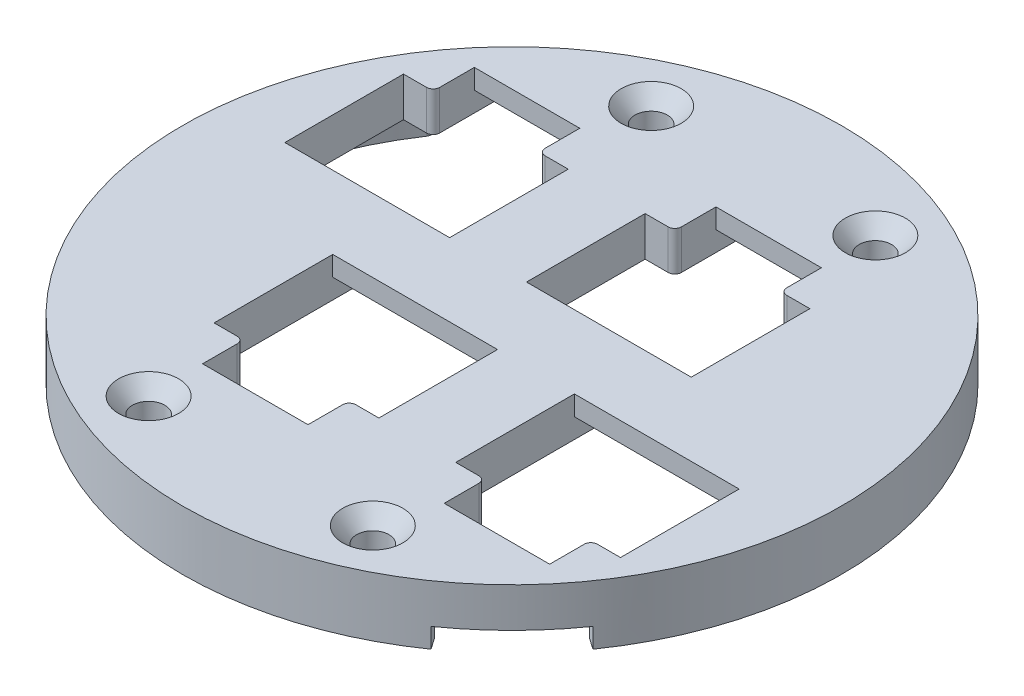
ISO-10303-21;
HEADER;
FILE_DESCRIPTION(('STEP AP214'),'2;1');
FILE_NAME('part.step','',(''),(''),'','','');
FILE_SCHEMA(('AUTOMOTIVE_DESIGN { 1 0 10303 214 1 1 1 1 }'));
ENDSEC;
DATA;
#1=APPLICATION_CONTEXT('core data for automotive mechanical design processes');
#2=APPLICATION_PROTOCOL_DEFINITION('international standard','automotive_design',2000,#1);
#3=PRODUCT_CONTEXT('',#1,'mechanical');
#4=PRODUCT('Part','Part','',(#3));
#5=PRODUCT_RELATED_PRODUCT_CATEGORY('part','',(#4));
#6=PRODUCT_DEFINITION_FORMATION('','',#4);
#7=PRODUCT_DEFINITION_CONTEXT('part definition',#1,'design');
#8=PRODUCT_DEFINITION('design','',#6,#7);
#9=PRODUCT_DEFINITION_SHAPE('','',#8);
#10=(LENGTH_UNIT() NAMED_UNIT(*) SI_UNIT(.MILLI.,.METRE.));
#11=(NAMED_UNIT(*) PLANE_ANGLE_UNIT() SI_UNIT($,.RADIAN.));
#12=(NAMED_UNIT(*) SI_UNIT($,.STERADIAN.) SOLID_ANGLE_UNIT());
#13=UNCERTAINTY_MEASURE_WITH_UNIT(LENGTH_MEASURE(1.E-05),#10,'distance_accuracy_value','');
#14=(GEOMETRIC_REPRESENTATION_CONTEXT(3) GLOBAL_UNCERTAINTY_ASSIGNED_CONTEXT((#13)) GLOBAL_UNIT_ASSIGNED_CONTEXT((#10,
#11,#12)) REPRESENTATION_CONTEXT('',''));
#15=CARTESIAN_POINT('',(0.,0.,0.));
#16=DIRECTION('',(0.,0.,1.));
#17=DIRECTION('',(1.,0.,0.));
#18=AXIS2_PLACEMENT_3D('',#15,#16,#17);
#19=CARTESIAN_POINT('',(32.6745010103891,-4.5,-35.7842712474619));
#20=DIRECTION('',(0.,0.,1.));
#21=DIRECTION('',(1.,0.,0.));
#22=AXIS2_PLACEMENT_3D('',#19,#20,#21);
#23=PLANE('',#22);
#24=DIRECTION('',(0.,1.,0.));
#25=VECTOR('',#24,1.);
#26=CARTESIAN_POINT('',(11.9999999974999,-25.3436388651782,-35.7842712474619));
#27=LINE('',#26,#25);
#28=CARTESIAN_POINT('',(11.9999999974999,-4.5,-35.7842712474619));
#29=VERTEX_POINT('',#28);
#30=CARTESIAN_POINT('',(11.9999999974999,-1.5,-35.7842712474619));
#31=VERTEX_POINT('',#30);
#32=EDGE_CURVE('E1568',#29,#31,#27,.T.);
#33=ORIENTED_EDGE('',*,*,#32,.F.);
#34=DIRECTION('',(1.,0.,0.));
#35=VECTOR('',#34,1.);
#36=CARTESIAN_POINT('',(32.6745010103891,-4.5,-35.7842712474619));
#37=LINE('',#36,#35);
#38=CARTESIAN_POINT('',(-11.9999999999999,-4.5,-35.7842712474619));
#39=VERTEX_POINT('',#38);
#40=EDGE_CURVE('E1166',#39,#29,#37,.T.);
#41=ORIENTED_EDGE('',*,*,#40,.F.);
#42=DIRECTION('',(0.,1.,0.));
#43=VECTOR('',#42,1.);
#44=CARTESIAN_POINT('',(-11.9999999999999,-25.3436388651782,-35.7842712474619));
#45=LINE('',#44,#43);
#46=CARTESIAN_POINT('',(-11.9999999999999,-1.5,-35.7842712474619));
#47=VERTEX_POINT('',#46);
#48=EDGE_CURVE('E1553',#39,#47,#45,.T.);
#49=ORIENTED_EDGE('',*,*,#48,.T.);
#50=DIRECTION('',(1.,0.,0.));
#51=VECTOR('',#50,1.);
#52=CARTESIAN_POINT('',(32.6745010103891,-1.5,-35.7842712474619));
#53=LINE('',#52,#51);
#54=EDGE_CURVE('E1110',#47,#31,#53,.T.);
#55=ORIENTED_EDGE('',*,*,#54,.T.);
#56=EDGE_LOOP('',(#33,#41,#49,#55));
#57=FACE_BOUND('',#56,.T.);
#58=ADVANCED_FACE('F40',(#57),#23,.F.);
#59=CARTESIAN_POINT('',(0.,-1.5,0.));
#60=DIRECTION('',(0.,1.,0.));
#61=DIRECTION('',(0.,0.,1.));
#62=AXIS2_PLACEMENT_3D('',#59,#60,#61);
#63=PLANE('',#62);
#64=DIRECTION('',(0.,0.,-1.));
#65=VECTOR('',#64,1.);
#66=CARTESIAN_POINT('',(11.9999999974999,-1.5,0.));
#67=LINE('',#66,#65);
#68=CARTESIAN_POINT('',(11.9999999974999,-1.5,-45.4422710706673));
#69=VERTEX_POINT('',#68);
#70=EDGE_CURVE('E1563',#31,#69,#67,.T.);
#71=ORIENTED_EDGE('',*,*,#70,.F.);
#72=ORIENTED_EDGE('',*,*,#54,.F.);
#73=DIRECTION('',(0.,0.,1.));
#74=VECTOR('',#73,1.);
#75=CARTESIAN_POINT('',(-11.9999999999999,-1.5,0.));
#76=LINE('',#75,#74);
#77=CARTESIAN_POINT('',(-11.9999999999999,-1.5,-45.4422710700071));
#78=VERTEX_POINT('',#77);
#79=EDGE_CURVE('E1552',#78,#47,#76,.T.);
#80=ORIENTED_EDGE('',*,*,#79,.F.);
#81=CARTESIAN_POINT('',(0.,-1.5,0.));
#82=DIRECTION('',(0.,1.,0.));
#83=DIRECTION('',(0.,0.,1.));
#84=AXIS2_PLACEMENT_3D('',#81,#82,#83);
#85=CIRCLE('',#84,47.);
#86=EDGE_CURVE('E658',#69,#78,#85,.T.);
#87=ORIENTED_EDGE('',*,*,#86,.F.);
#88=EDGE_LOOP('',(#71,#72,#80,#87));
#89=FACE_BOUND('',#88,.T.);
#90=ADVANCED_FACE('F894',(#89),#63,.F.);
#91=CARTESIAN_POINT('',(32.6745010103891,-4.5,35.7842712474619));
#92=DIRECTION('',(0.,0.,-1.));
#93=DIRECTION('',(-1.,0.,0.));
#94=AXIS2_PLACEMENT_3D('',#91,#92,#93);
#95=PLANE('',#94);
#96=DIRECTION('',(-1.,0.,0.));
#97=VECTOR('',#96,1.);
#98=CARTESIAN_POINT('',(32.6745010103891,-1.5,35.7842712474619));
#99=LINE('',#98,#97);
#100=CARTESIAN_POINT('',(11.9999999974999,-1.5,35.7842712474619));
#101=VERTEX_POINT('',#100);
#102=CARTESIAN_POINT('',(-11.9999999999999,-1.5,35.7842712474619));
#103=VERTEX_POINT('',#102);
#104=EDGE_CURVE('E1190',#101,#103,#99,.T.);
#105=ORIENTED_EDGE('',*,*,#104,.T.);
#106=DIRECTION('',(0.,1.,0.));
#107=VECTOR('',#106,1.);
#108=CARTESIAN_POINT('',(-11.9999999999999,-25.3436388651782,35.7842712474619));
#109=LINE('',#108,#107);
#110=CARTESIAN_POINT('',(-11.9999999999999,-4.5,35.7842712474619));
#111=VERTEX_POINT('',#110);
#112=EDGE_CURVE('E1592',#111,#103,#109,.T.);
#113=ORIENTED_EDGE('',*,*,#112,.F.);
#114=DIRECTION('',(-1.,0.,0.));
#115=VECTOR('',#114,1.);
#116=CARTESIAN_POINT('',(32.6745010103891,-4.5,35.7842712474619));
#117=LINE('',#116,#115);
#118=CARTESIAN_POINT('',(11.9999999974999,-4.5,35.7842712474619));
#119=VERTEX_POINT('',#118);
#120=EDGE_CURVE('E1137',#119,#111,#117,.T.);
#121=ORIENTED_EDGE('',*,*,#120,.F.);
#122=DIRECTION('',(0.,1.,0.));
#123=VECTOR('',#122,1.);
#124=CARTESIAN_POINT('',(11.9999999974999,-25.3436388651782,35.7842712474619));
#125=LINE('',#124,#123);
#126=EDGE_CURVE('E1577',#119,#101,#125,.T.);
#127=ORIENTED_EDGE('',*,*,#126,.T.);
#128=EDGE_LOOP('',(#105,#113,#121,#127));
#129=FACE_BOUND('',#128,.T.);
#130=ADVANCED_FACE('F900',(#129),#95,.F.);
#131=CARTESIAN_POINT('',(0.,-7.5,0.));
#132=DIRECTION('',(0.,1.,0.));
#133=DIRECTION('',(0.,0.,1.));
#134=AXIS2_PLACEMENT_3D('',#131,#132,#133);
#135=PLANE('',#134);
#136=DIRECTION('',(0.819152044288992,0.,0.573576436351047));
#137=VECTOR('',#136,1.);
#138=CARTESIAN_POINT('',(40.9576022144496,-7.5,28.6788218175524));
#139=LINE('',#138,#137);
#140=CARTESIAN_POINT('',(39.3107643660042,-7.5,27.5256935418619));
#141=VERTEX_POINT('',#140);
#142=CARTESIAN_POINT('',(40.9576022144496,-7.5,28.6788218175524));
#143=VERTEX_POINT('',#142);
#144=EDGE_CURVE('E1514',#141,#143,#139,.T.);
#145=ORIENTED_EDGE('',*,*,#144,.F.);
#146=CARTESIAN_POINT('',(39.8843408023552,-7.5,26.7065414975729));
#147=DIRECTION('',(0.,1.,0.));
#148=DIRECTION('',(0.,0.,1.));
#149=AXIS2_PLACEMENT_3D('',#146,#147,#148);
#150=CIRCLE('',#149,1.);
#151=CARTESIAN_POINT('',(39.0534170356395,-7.5,26.1501552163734));
#152=VERTEX_POINT('',#151);
#153=EDGE_CURVE('E691',#141,#152,#150,.F.);
#154=ORIENTED_EDGE('',*,*,#153,.T.);
#155=CARTESIAN_POINT('',(0.,-7.5,0.));
#156=DIRECTION('',(0.,1.,0.));
#157=DIRECTION('',(0.,0.,1.));
#158=AXIS2_PLACEMENT_3D('',#155,#156,#157);
#159=CIRCLE('',#158,47.);
#160=CARTESIAN_POINT('',(-26.1501552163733,-7.5,-39.0534170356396));
#161=VERTEX_POINT('',#160);
#162=EDGE_CURVE('E651',#152,#161,#159,.T.);
#163=ORIENTED_EDGE('',*,*,#162,.T.);
#164=CARTESIAN_POINT('',(-26.7065414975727,-7.5,-39.8843408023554));
#165=DIRECTION('',(0.,1.,0.));
#166=DIRECTION('',(0.,0.,1.));
#167=AXIS2_PLACEMENT_3D('',#164,#165,#166);
#168=CIRCLE('',#167,1.);
#169=CARTESIAN_POINT('',(-27.5256935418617,-7.5,-39.3107643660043));
#170=VERTEX_POINT('',#169);
#171=EDGE_CURVE('E689',#161,#170,#168,.F.);
#172=ORIENTED_EDGE('',*,*,#171,.T.);
#173=DIRECTION('',(0.573576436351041,0.,0.819152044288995));
#174=VECTOR('',#173,1.);
#175=CARTESIAN_POINT('',(-28.6788218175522,-7.5,-40.9576022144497));
#176=LINE('',#175,#174);
#177=CARTESIAN_POINT('',(-28.6788218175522,-7.5,-40.9576022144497));
#178=VERTEX_POINT('',#177);
#179=EDGE_CURVE('E625',#178,#170,#176,.T.);
#180=ORIENTED_EDGE('',*,*,#179,.F.);
#181=CARTESIAN_POINT('',(0.,-7.5,0.));
#182=DIRECTION('',(0.,1.,0.));
#183=DIRECTION('',(0.,0.,1.));
#184=AXIS2_PLACEMENT_3D('',#181,#182,#183);
#185=CIRCLE('',#184,50.);
#186=EDGE_CURVE('E645',#143,#178,#185,.T.);
#187=ORIENTED_EDGE('',*,*,#186,.F.);
#188=EDGE_LOOP('',(#145,#154,#163,#172,#180,#187));
#189=FACE_BOUND('',#188,.T.);
#190=ADVANCED_FACE('F933',(#189),#135,.F.);
#191=CARTESIAN_POINT('',(-35.4999999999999,1.5,-29.7842712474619));
#192=DIRECTION('',(-1.,0.,0.));
#193=DIRECTION('',(0.,0.,1.));
#194=AXIS2_PLACEMENT_3D('',#191,#192,#193);
#195=PLANE('',#194);
#196=DIRECTION('',(0.,0.,-1.));
#197=VECTOR('',#196,1.);
#198=CARTESIAN_POINT('',(-35.4999999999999,1.5,-29.7842712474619));
#199=LINE('',#198,#197);
#200=CARTESIAN_POINT('',(-35.4999999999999,1.5,-24.5342712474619));
#201=VERTEX_POINT('',#200);
#202=CARTESIAN_POINT('',(-35.4999999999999,1.5,-29.7842712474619));
#203=VERTEX_POINT('',#202);
#204=EDGE_CURVE('E1273',#201,#203,#199,.T.);
#205=ORIENTED_EDGE('',*,*,#204,.F.);
#206=DIRECTION('',(0.,-1.,0.));
#207=VECTOR('',#206,1.);
#208=CARTESIAN_POINT('',(-35.4999999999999,1.5,-24.5342712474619));
#209=LINE('',#208,#207);
#210=CARTESIAN_POINT('',(-35.4999999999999,-4.5,-24.5342712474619));
#211=VERTEX_POINT('',#210);
#212=EDGE_CURVE('E701',#201,#211,#209,.T.);
#213=ORIENTED_EDGE('',*,*,#212,.T.);
#214=DIRECTION('',(0.,0.,1.));
#215=VECTOR('',#214,1.);
#216=CARTESIAN_POINT('',(-35.4999999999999,-4.5,-23.5342712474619));
#217=LINE('',#216,#215);
#218=CARTESIAN_POINT('',(-35.4999999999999,-4.5,-33.7842712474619));
#219=VERTEX_POINT('',#218);
#220=EDGE_CURVE('E1146',#219,#211,#217,.T.);
#221=ORIENTED_EDGE('',*,*,#220,.F.);
#222=DIRECTION('',(0.,1.,0.));
#223=VECTOR('',#222,1.);
#224=CARTESIAN_POINT('',(-35.4999999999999,-7.5,-33.7842712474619));
#225=LINE('',#224,#223);
#226=CARTESIAN_POINT('',(-35.4999999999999,-1.5,-33.7842712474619));
#227=VERTEX_POINT('',#226);
#228=EDGE_CURVE('E1506',#219,#227,#225,.T.);
#229=ORIENTED_EDGE('',*,*,#228,.T.);
#230=DIRECTION('',(0.,0.,1.));
#231=VECTOR('',#230,1.);
#232=CARTESIAN_POINT('',(-35.4999999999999,-1.5,-23.5342712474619));
#233=LINE('',#232,#231);
#234=CARTESIAN_POINT('',(-35.4999999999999,-1.5,-29.7842712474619));
#235=VERTEX_POINT('',#234);
#236=EDGE_CURVE('E1199',#227,#235,#233,.T.);
#237=ORIENTED_EDGE('',*,*,#236,.T.);
#238=DIRECTION('',(0.,-1.,0.));
#239=VECTOR('',#238,1.);
#240=CARTESIAN_POINT('',(-35.4999999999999,1.5,-29.7842712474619));
#241=LINE('',#240,#239);
#242=EDGE_CURVE('E1287',#203,#235,#241,.T.);
#243=ORIENTED_EDGE('',*,*,#242,.F.);
#244=EDGE_LOOP('',(#205,#213,#221,#229,#237,#243));
#245=FACE_BOUND('',#244,.T.);
#246=ADVANCED_FACE('F911',(#245),#195,.F.);
#247=CARTESIAN_POINT('',(-19.4999999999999,-4.5,-33.7842712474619));
#248=DIRECTION('',(0.,0.,-1.));
#249=DIRECTION('',(-1.,0.,0.));
#250=AXIS2_PLACEMENT_3D('',#247,#248,#249);
#251=PLANE('',#250);
#252=ORIENTED_EDGE('',*,*,#228,.F.);
#253=DIRECTION('',(-1.,0.,0.));
#254=VECTOR('',#253,1.);
#255=CARTESIAN_POINT('',(-19.4999999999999,-4.5,-33.7842712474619));
#256=LINE('',#255,#254);
#257=CARTESIAN_POINT('',(-19.4999999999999,-4.5,-33.7842712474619));
#258=VERTEX_POINT('',#257);
#259=EDGE_CURVE('E1163',#258,#219,#256,.T.);
#260=ORIENTED_EDGE('',*,*,#259,.F.);
#261=DIRECTION('',(0.,1.,0.));
#262=VECTOR('',#261,1.);
#263=CARTESIAN_POINT('',(-19.4999999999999,-4.5,-33.7842712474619));
#264=LINE('',#263,#262);
#265=CARTESIAN_POINT('',(-19.4999999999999,-1.5,-33.7842712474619));
#266=VERTEX_POINT('',#265);
#267=EDGE_CURVE('E1169',#258,#266,#264,.T.);
#268=ORIENTED_EDGE('',*,*,#267,.T.);
#269=DIRECTION('',(-1.,0.,0.));
#270=VECTOR('',#269,1.);
#271=CARTESIAN_POINT('',(-19.4999999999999,-1.5,-33.7842712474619));
#272=LINE('',#271,#270);
#273=EDGE_CURVE('E1209',#266,#227,#272,.T.);
#274=ORIENTED_EDGE('',*,*,#273,.T.);
#275=EDGE_LOOP('',(#252,#260,#268,#274));
#276=FACE_BOUND('',#275,.T.);
#277=ADVANCED_FACE('F907',(#276),#251,.F.);
#278=CARTESIAN_POINT('',(35.4999999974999,1.5,29.7842712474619));
#279=DIRECTION('',(1.,0.,0.));
#280=DIRECTION('',(0.,0.,-1.));
#281=AXIS2_PLACEMENT_3D('',#278,#279,#280);
#282=PLANE('',#281);
#283=DIRECTION('',(0.,0.,1.));
#284=VECTOR('',#283,1.);
#285=CARTESIAN_POINT('',(35.4999999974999,1.5,29.7842712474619));
#286=LINE('',#285,#284);
#287=CARTESIAN_POINT('',(35.4999999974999,1.5,24.5342712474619));
#288=VERTEX_POINT('',#287);
#289=CARTESIAN_POINT('',(35.4999999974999,1.5,29.7842712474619));
#290=VERTEX_POINT('',#289);
#291=EDGE_CURVE('E832',#288,#290,#286,.T.);
#292=ORIENTED_EDGE('',*,*,#291,.F.);
#293=DIRECTION('',(0.,-1.,0.));
#294=VECTOR('',#293,1.);
#295=CARTESIAN_POINT('',(35.4999999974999,1.5,24.5342712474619));
#296=LINE('',#295,#294);
#297=CARTESIAN_POINT('',(35.4999999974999,-4.5,24.5342712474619));
#298=VERTEX_POINT('',#297);
#299=EDGE_CURVE('E757',#288,#298,#296,.T.);
#300=ORIENTED_EDGE('',*,*,#299,.T.);
#301=DIRECTION('',(0.,0.,-1.));
#302=VECTOR('',#301,1.);
#303=CARTESIAN_POINT('',(35.4999999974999,-4.5,23.5342712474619));
#304=LINE('',#303,#302);
#305=CARTESIAN_POINT('',(35.4999999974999,-4.5,33.7842712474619));
#306=VERTEX_POINT('',#305);
#307=EDGE_CURVE('E1117',#306,#298,#304,.T.);
#308=ORIENTED_EDGE('',*,*,#307,.F.);
#309=DIRECTION('',(0.,1.,0.));
#310=VECTOR('',#309,1.);
#311=CARTESIAN_POINT('',(35.4999999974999,-7.5,33.7842712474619));
#312=LINE('',#311,#310);
#313=CARTESIAN_POINT('',(35.4999999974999,-1.5,33.7842712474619));
#314=VERTEX_POINT('',#313);
#315=EDGE_CURVE('E1486',#306,#314,#312,.T.);
#316=ORIENTED_EDGE('',*,*,#315,.T.);
#317=DIRECTION('',(0.,0.,-1.));
#318=VECTOR('',#317,1.);
#319=CARTESIAN_POINT('',(35.4999999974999,-1.5,23.5342712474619));
#320=LINE('',#319,#318);
#321=CARTESIAN_POINT('',(35.4999999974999,-1.5,29.7842712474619));
#322=VERTEX_POINT('',#321);
#323=EDGE_CURVE('E1175',#314,#322,#320,.T.);
#324=ORIENTED_EDGE('',*,*,#323,.T.);
#325=DIRECTION('',(0.,-1.,0.));
#326=VECTOR('',#325,1.);
#327=CARTESIAN_POINT('',(35.4999999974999,1.5,29.7842712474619));
#328=LINE('',#327,#326);
#329=EDGE_CURVE('E813',#290,#322,#328,.T.);
#330=ORIENTED_EDGE('',*,*,#329,.F.);
#331=EDGE_LOOP('',(#292,#300,#308,#316,#324,#330));
#332=FACE_BOUND('',#331,.T.);
#333=ADVANCED_FACE('F910',(#332),#282,.F.);
#334=CARTESIAN_POINT('',(32.6745010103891,-4.5,33.7842712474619));
#335=DIRECTION('',(0.,0.,1.));
#336=DIRECTION('',(1.,0.,0.));
#337=AXIS2_PLACEMENT_3D('',#334,#335,#336);
#338=PLANE('',#337);
#339=ORIENTED_EDGE('',*,*,#315,.F.);
#340=DIRECTION('',(1.,0.,0.));
#341=VECTOR('',#340,1.);
#342=CARTESIAN_POINT('',(32.6745010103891,-4.5,33.7842712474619));
#343=LINE('',#342,#341);
#344=CARTESIAN_POINT('',(19.4999999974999,-4.5,33.7842712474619));
#345=VERTEX_POINT('',#344);
#346=EDGE_CURVE('E1134',#345,#306,#343,.T.);
#347=ORIENTED_EDGE('',*,*,#346,.F.);
#348=DIRECTION('',(0.,1.,0.));
#349=VECTOR('',#348,1.);
#350=CARTESIAN_POINT('',(19.4999999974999,-4.5,33.7842712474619));
#351=LINE('',#350,#349);
#352=CARTESIAN_POINT('',(19.4999999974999,-1.5,33.7842712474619));
#353=VERTEX_POINT('',#352);
#354=EDGE_CURVE('E1233',#345,#353,#351,.T.);
#355=ORIENTED_EDGE('',*,*,#354,.T.);
#356=DIRECTION('',(1.,0.,0.));
#357=VECTOR('',#356,1.);
#358=CARTESIAN_POINT('',(32.6745010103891,-1.5,33.7842712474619));
#359=LINE('',#358,#357);
#360=EDGE_CURVE('E1187',#353,#314,#359,.T.);
#361=ORIENTED_EDGE('',*,*,#360,.T.);
#362=EDGE_LOOP('',(#339,#347,#355,#361));
#363=FACE_BOUND('',#362,.T.);
#364=ADVANCED_FACE('F935',(#363),#338,.F.);
#365=CARTESIAN_POINT('',(0.,-7.5,0.));
#366=DIRECTION('',(0.,1.,0.));
#367=DIRECTION('',(0.,0.,1.));
#368=AXIS2_PLACEMENT_3D('',#365,#366,#367);
#369=CYLINDRICAL_SURFACE('',#368,47.);
#370=CARTESIAN_POINT('',(0.,-4.5,0.));
#371=DIRECTION('',(0.,-1.,0.));
#372=DIRECTION('',(0.,0.,-1.));
#373=AXIS2_PLACEMENT_3D('',#370,#371,#372);
#374=CIRCLE('',#373,47.);
#375=CARTESIAN_POINT('',(11.9999999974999,-4.5,45.4422710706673));
#376=VERTEX_POINT('',#375);
#377=CARTESIAN_POINT('',(26.1501552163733,-4.5,39.0534170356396));
#378=VERTEX_POINT('',#377);
#379=EDGE_CURVE('E1583',#376,#378,#374,.F.);
#380=ORIENTED_EDGE('',*,*,#379,.T.);
#381=DIRECTION('',(0.,1.,0.));
#382=VECTOR('',#381,1.);
#383=CARTESIAN_POINT('',(26.1501552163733,-7.5,39.0534170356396));
#384=LINE('',#383,#382);
#385=CARTESIAN_POINT('',(26.1501552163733,-7.5,39.0534170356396));
#386=VERTEX_POINT('',#385);
#387=EDGE_CURVE('E677',#378,#386,#384,.F.);
#388=ORIENTED_EDGE('',*,*,#387,.T.);
#389=CARTESIAN_POINT('',(-39.0534170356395,-7.5,-26.1501552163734));
#390=VERTEX_POINT('',#389);
#391=EDGE_CURVE('E789',#390,#386,#159,.T.);
#392=ORIENTED_EDGE('',*,*,#391,.F.);
#393=DIRECTION('',(0.,1.,0.));
#394=VECTOR('',#393,1.);
#395=CARTESIAN_POINT('',(-39.0534170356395,-7.5,-26.1501552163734));
#396=LINE('',#395,#394);
#397=CARTESIAN_POINT('',(-39.0534170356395,-4.5,-26.1501552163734));
#398=VERTEX_POINT('',#397);
#399=EDGE_CURVE('E675',#390,#398,#396,.T.);
#400=ORIENTED_EDGE('',*,*,#399,.T.);
#401=CARTESIAN_POINT('',(0.,-4.5,0.));
#402=DIRECTION('',(0.,-1.,0.));
#403=DIRECTION('',(0.,0.,-1.));
#404=AXIS2_PLACEMENT_3D('',#401,#402,#403);
#405=CIRCLE('',#404,47.);
#406=CARTESIAN_POINT('',(-46.9749508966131,-4.5,1.53427124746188));
#407=VERTEX_POINT('',#406);
#408=EDGE_CURVE('E782',#407,#398,#405,.T.);
#409=ORIENTED_EDGE('',*,*,#408,.F.);
#410=DIRECTION('',(0.,1.,0.));
#411=VECTOR('',#410,1.);
#412=CARTESIAN_POINT('',(-46.9749508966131,-4.5,1.53427124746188));
#413=LINE('',#412,#411);
#414=CARTESIAN_POINT('',(-46.9749508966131,-1.5,1.53427124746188));
#415=VERTEX_POINT('',#414);
#416=EDGE_CURVE('E1222',#407,#415,#413,.T.);
#417=ORIENTED_EDGE('',*,*,#416,.T.);
#418=CARTESIAN_POINT('',(-32.6745010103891,-1.5,33.7842712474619));
#419=VERTEX_POINT('',#418);
#420=EDGE_CURVE('E657',#415,#419,#85,.T.);
#421=ORIENTED_EDGE('',*,*,#420,.T.);
#422=DIRECTION('',(0.,1.,0.));
#423=VECTOR('',#422,1.);
#424=CARTESIAN_POINT('',(-32.6745010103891,-4.5,33.7842712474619));
#425=LINE('',#424,#423);
#426=CARTESIAN_POINT('',(-32.6745010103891,-4.5,33.7842712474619));
#427=VERTEX_POINT('',#426);
#428=EDGE_CURVE('E1231',#427,#419,#425,.T.);
#429=ORIENTED_EDGE('',*,*,#428,.F.);
#430=CARTESIAN_POINT('',(0.,-4.5,0.));
#431=DIRECTION('',(0.,-1.,0.));
#432=DIRECTION('',(0.,0.,-1.));
#433=AXIS2_PLACEMENT_3D('',#430,#431,#432);
#434=CIRCLE('',#433,47.);
#435=CARTESIAN_POINT('',(-11.9999999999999,-4.5,45.4422710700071));
#436=VERTEX_POINT('',#435);
#437=EDGE_CURVE('E660',#427,#436,#434,.F.);
#438=ORIENTED_EDGE('',*,*,#437,.T.);
#439=DIRECTION('',(0.,1.,0.));
#440=VECTOR('',#439,1.);
#441=CARTESIAN_POINT('',(-11.9999999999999,-25.3436388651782,45.4422710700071));
#442=LINE('',#441,#440);
#443=CARTESIAN_POINT('',(-11.9999999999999,-1.5,45.4422710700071));
#444=VERTEX_POINT('',#443);
#445=EDGE_CURVE('E1590',#436,#444,#442,.T.);
#446=ORIENTED_EDGE('',*,*,#445,.T.);
#447=CARTESIAN_POINT('',(11.9999999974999,-1.5,45.4422710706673));
#448=VERTEX_POINT('',#447);
#449=EDGE_CURVE('E649',#444,#448,#85,.T.);
#450=ORIENTED_EDGE('',*,*,#449,.T.);
#451=DIRECTION('',(0.,1.,0.));
#452=VECTOR('',#451,1.);
#453=CARTESIAN_POINT('',(11.9999999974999,-25.3436388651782,45.4422710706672));
#454=LINE('',#453,#452);
#455=EDGE_CURVE('E1579',#376,#448,#454,.T.);
#456=ORIENTED_EDGE('',*,*,#455,.F.);
#457=EDGE_LOOP('',(#380,#388,#392,#400,#409,#417,#421,#429,#438,#446,#450,#456));
#458=FACE_BOUND('',#457,.T.);
#459=ADVANCED_FACE('F792',(#458),#369,.F.);
#460=ORIENTED_EDGE('',*,*,#162,.F.);
#461=DIRECTION('',(0.,1.,0.));
#462=VECTOR('',#461,1.);
#463=CARTESIAN_POINT('',(39.0534170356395,-7.5,26.1501552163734));
#464=LINE('',#463,#462);
#465=CARTESIAN_POINT('',(39.0534170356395,-4.5,26.1501552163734));
#466=VERTEX_POINT('',#465);
#467=EDGE_CURVE('E696',#152,#466,#464,.T.);
#468=ORIENTED_EDGE('',*,*,#467,.T.);
#469=CARTESIAN_POINT('',(0.,-4.5,0.));
#470=DIRECTION('',(0.,-1.,0.));
#471=DIRECTION('',(0.,0.,1.));
#472=AXIS2_PLACEMENT_3D('',#469,#470,#471);
#473=CIRCLE('',#472,47.);
#474=CARTESIAN_POINT('',(46.9749508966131,-4.5,-1.53427124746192));
#475=VERTEX_POINT('',#474);
#476=EDGE_CURVE('E1114',#475,#466,#473,.T.);
#477=ORIENTED_EDGE('',*,*,#476,.F.);
#478=DIRECTION('',(0.,1.,0.));
#479=VECTOR('',#478,1.);
#480=CARTESIAN_POINT('',(46.9749508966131,-4.5,-1.53427124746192));
#481=LINE('',#480,#479);
#482=CARTESIAN_POINT('',(46.9749508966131,-1.5,-1.53427124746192));
#483=VERTEX_POINT('',#482);
#484=EDGE_CURVE('E1243',#475,#483,#481,.T.);
#485=ORIENTED_EDGE('',*,*,#484,.T.);
#486=CARTESIAN_POINT('',(32.6745010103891,-1.5,-33.7842712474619));
#487=VERTEX_POINT('',#486);
#488=EDGE_CURVE('E659',#483,#487,#85,.T.);
#489=ORIENTED_EDGE('',*,*,#488,.T.);
#490=DIRECTION('',(0.,1.,0.));
#491=VECTOR('',#490,1.);
#492=CARTESIAN_POINT('',(32.6745010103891,-4.5,-33.7842712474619));
#493=LINE('',#492,#491);
#494=CARTESIAN_POINT('',(32.6745010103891,-4.5,-33.7842712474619));
#495=VERTEX_POINT('',#494);
#496=EDGE_CURVE('E1252',#495,#487,#493,.T.);
#497=ORIENTED_EDGE('',*,*,#496,.F.);
#498=CARTESIAN_POINT('',(11.9999999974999,-4.5,-45.4422710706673));
#499=VERTEX_POINT('',#498);
#500=EDGE_CURVE('E663',#495,#499,#434,.F.);
#501=ORIENTED_EDGE('',*,*,#500,.T.);
#502=DIRECTION('',(0.,1.,0.));
#503=VECTOR('',#502,1.);
#504=CARTESIAN_POINT('',(11.9999999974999,-25.3436388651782,-45.4422710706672));
#505=LINE('',#504,#503);
#506=EDGE_CURVE('E1566',#499,#69,#505,.T.);
#507=ORIENTED_EDGE('',*,*,#506,.T.);
#508=ORIENTED_EDGE('',*,*,#86,.T.);
#509=DIRECTION('',(0.,1.,0.));
#510=VECTOR('',#509,1.);
#511=CARTESIAN_POINT('',(-11.9999999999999,-25.3436388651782,-45.4422710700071));
#512=LINE('',#511,#510);
#513=CARTESIAN_POINT('',(-11.9999999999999,-4.5,-45.4422710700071));
#514=VERTEX_POINT('',#513);
#515=EDGE_CURVE('E1555',#514,#78,#512,.T.);
#516=ORIENTED_EDGE('',*,*,#515,.F.);
#517=CARTESIAN_POINT('',(0.,-4.5,0.));
#518=DIRECTION('',(0.,-1.,0.));
#519=DIRECTION('',(0.,0.,-1.));
#520=AXIS2_PLACEMENT_3D('',#517,#518,#519);
#521=CIRCLE('',#520,47.);
#522=CARTESIAN_POINT('',(-26.1501552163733,-4.5,-39.0534170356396));
#523=VERTEX_POINT('',#522);
#524=EDGE_CURVE('E1561',#523,#514,#521,.T.);
#525=ORIENTED_EDGE('',*,*,#524,.F.);
#526=DIRECTION('',(0.,1.,0.));
#527=VECTOR('',#526,1.);
#528=CARTESIAN_POINT('',(-26.1501552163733,-7.5,-39.0534170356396));
#529=LINE('',#528,#527);
#530=EDGE_CURVE('E693',#523,#161,#529,.F.);
#531=ORIENTED_EDGE('',*,*,#530,.T.);
#532=EDGE_LOOP('',(#460,#468,#477,#485,#489,#497,#501,#507,#508,#516,#525,#531));
#533=FACE_BOUND('',#532,.T.);
#534=ADVANCED_FACE('F1632',(#533),#369,.F.);
#535=ORIENTED_EDGE('',*,*,#391,.T.);
#536=CARTESIAN_POINT('',(26.7065414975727,-7.5,39.8843408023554));
#537=DIRECTION('',(0.,1.,0.));
#538=DIRECTION('',(0.,0.,1.));
#539=AXIS2_PLACEMENT_3D('',#536,#537,#538);
#540=CIRCLE('',#539,1.);
#541=CARTESIAN_POINT('',(27.5256935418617,-7.5,39.3107643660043));
#542=VERTEX_POINT('',#541);
#543=EDGE_CURVE('E682',#386,#542,#540,.F.);
#544=ORIENTED_EDGE('',*,*,#543,.T.);
#545=DIRECTION('',(-0.573576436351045,0.,-0.819152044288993));
#546=VECTOR('',#545,1.);
#547=CARTESIAN_POINT('',(28.6788218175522,-7.5,40.9576022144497));
#548=LINE('',#547,#546);
#549=CARTESIAN_POINT('',(28.6788218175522,-7.5,40.9576022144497));
#550=VERTEX_POINT('',#549);
#551=EDGE_CURVE('E644',#550,#542,#548,.T.);
#552=ORIENTED_EDGE('',*,*,#551,.F.);
#553=CARTESIAN_POINT('',(-40.9576022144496,-7.5,-28.6788218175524));
#554=VERTEX_POINT('',#553);
#555=EDGE_CURVE('E634',#554,#550,#185,.T.);
#556=ORIENTED_EDGE('',*,*,#555,.F.);
#557=DIRECTION('',(-0.819152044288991,0.,-0.573576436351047));
#558=VECTOR('',#557,1.);
#559=CARTESIAN_POINT('',(-40.9576022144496,-7.5,-28.6788218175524));
#560=LINE('',#559,#558);
#561=CARTESIAN_POINT('',(-39.3107643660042,-7.5,-27.5256935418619));
#562=VERTEX_POINT('',#561);
#563=EDGE_CURVE('E615',#562,#554,#560,.T.);
#564=ORIENTED_EDGE('',*,*,#563,.F.);
#565=CARTESIAN_POINT('',(-39.8843408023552,-7.5,-26.7065414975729));
#566=DIRECTION('',(0.,1.,0.));
#567=DIRECTION('',(0.,0.,1.));
#568=AXIS2_PLACEMENT_3D('',#565,#566,#567);
#569=CIRCLE('',#568,1.);
#570=EDGE_CURVE('E680',#562,#390,#569,.F.);
#571=ORIENTED_EDGE('',*,*,#570,.T.);
#572=EDGE_LOOP('',(#535,#544,#552,#556,#564,#571));
#573=FACE_BOUND('',#572,.T.);
#574=ADVANCED_FACE('F642',(#573),#135,.F.);
#575=DIRECTION('',(-1.,0.,0.));
#576=VECTOR('',#575,1.);
#577=CARTESIAN_POINT('',(32.6745010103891,-1.5,-33.7842712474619));
#578=LINE('',#577,#576);
#579=CARTESIAN_POINT('',(24.666666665,-1.5,-33.7842712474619));
#580=VERTEX_POINT('',#579);
#581=EDGE_CURVE('E1106',#487,#580,#578,.T.);
#582=ORIENTED_EDGE('',*,*,#581,.F.);
#583=ORIENTED_EDGE('',*,*,#488,.F.);
#584=DIRECTION('',(1.,0.,0.));
#585=VECTOR('',#584,1.);
#586=CARTESIAN_POINT('',(46.9749508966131,-1.5,-1.53427124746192));
#587=LINE('',#586,#585);
#588=CARTESIAN_POINT('',(24.666666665,-1.5,-1.53427124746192));
#589=VERTEX_POINT('',#588);
#590=EDGE_CURVE('E1173',#589,#483,#587,.T.);
#591=ORIENTED_EDGE('',*,*,#590,.F.);
#592=DIRECTION('',(0.,0.,1.));
#593=VECTOR('',#592,1.);
#594=CARTESIAN_POINT('',(24.666666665,-1.5,-1.53427124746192));
#595=LINE('',#594,#593);
#596=EDGE_CURVE('E1171',#580,#589,#595,.T.);
#597=ORIENTED_EDGE('',*,*,#596,.F.);
#598=EDGE_LOOP('',(#582,#583,#591,#597));
#599=FACE_BOUND('',#598,.T.);
#600=ADVANCED_FACE('F903',(#599),#63,.F.);
#601=ORIENTED_EDGE('',*,*,#323,.F.);
#602=ORIENTED_EDGE('',*,*,#360,.F.);
#603=DIRECTION('',(0.,0.,1.));
#604=VECTOR('',#603,1.);
#605=CARTESIAN_POINT('',(19.4999999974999,-1.5,23.5342712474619));
#606=LINE('',#605,#604);
#607=CARTESIAN_POINT('',(19.4999999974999,-1.5,29.7842712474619));
#608=VERTEX_POINT('',#607);
#609=EDGE_CURVE('E1185',#608,#353,#606,.T.);
#610=ORIENTED_EDGE('',*,*,#609,.F.);
#611=DIRECTION('',(-1.,0.,0.));
#612=VECTOR('',#611,1.);
#613=CARTESIAN_POINT('',(35.4999999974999,-1.5,29.7842712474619));
#614=LINE('',#613,#612);
#615=EDGE_CURVE('E828',#322,#608,#614,.T.);
#616=ORIENTED_EDGE('',*,*,#615,.F.);
#617=EDGE_LOOP('',(#601,#602,#610,#616));
#618=FACE_BOUND('',#617,.T.);
#619=ADVANCED_FACE('F1678',(#618),#63,.F.);
#620=DIRECTION('',(0.,0.,-1.));
#621=VECTOR('',#620,1.);
#622=CARTESIAN_POINT('',(39.9999999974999,-1.5,23.5342712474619));
#623=LINE('',#622,#621);
#624=CARTESIAN_POINT('',(39.9999999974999,-1.5,5.5342712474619));
#625=VERTEX_POINT('',#624);
#626=CARTESIAN_POINT('',(39.9999999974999,-1.5,1.53427124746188));
#627=VERTEX_POINT('',#626);
#628=EDGE_CURVE('E1177',#625,#627,#623,.T.);
#629=ORIENTED_EDGE('',*,*,#628,.F.);
#630=DIRECTION('',(1.,0.,0.));
#631=VECTOR('',#630,1.);
#632=CARTESIAN_POINT('',(39.9999999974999,-1.5,5.5342712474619));
#633=LINE('',#632,#631);
#634=CARTESIAN_POINT('',(14.9999999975,-1.5,5.53427124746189));
#635=VERTEX_POINT('',#634);
#636=EDGE_CURVE('E804',#635,#625,#633,.T.);
#637=ORIENTED_EDGE('',*,*,#636,.F.);
#638=DIRECTION('',(0.,0.,1.));
#639=VECTOR('',#638,1.);
#640=CARTESIAN_POINT('',(14.9999999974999,-1.5,1.53427124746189));
#641=LINE('',#640,#639);
#642=CARTESIAN_POINT('',(14.9999999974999,-1.5,1.53427124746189));
#643=VERTEX_POINT('',#642);
#644=EDGE_CURVE('E1182',#643,#635,#641,.T.);
#645=ORIENTED_EDGE('',*,*,#644,.F.);
#646=DIRECTION('',(-1.,0.,0.));
#647=VECTOR('',#646,1.);
#648=CARTESIAN_POINT('',(39.9999999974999,-1.5,1.53427124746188));
#649=LINE('',#648,#647);
#650=EDGE_CURVE('E1179',#627,#643,#649,.T.);
#651=ORIENTED_EDGE('',*,*,#650,.F.);
#652=EDGE_LOOP('',(#629,#637,#645,#651));
#653=FACE_BOUND('',#652,.T.);
#654=ADVANCED_FACE('F1683',(#653),#63,.F.);
#655=ORIENTED_EDGE('',*,*,#449,.F.);
#656=DIRECTION('',(0.,0.,-1.));
#657=VECTOR('',#656,1.);
#658=CARTESIAN_POINT('',(-11.9999999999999,-1.5,0.));
#659=LINE('',#658,#657);
#660=EDGE_CURVE('E1585',#444,#103,#659,.T.);
#661=ORIENTED_EDGE('',*,*,#660,.T.);
#662=ORIENTED_EDGE('',*,*,#104,.F.);
#663=DIRECTION('',(0.,0.,1.));
#664=VECTOR('',#663,1.);
#665=CARTESIAN_POINT('',(11.9999999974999,-1.5,0.));
#666=LINE('',#665,#664);
#667=EDGE_CURVE('E1574',#101,#448,#666,.T.);
#668=ORIENTED_EDGE('',*,*,#667,.T.);
#669=EDGE_LOOP('',(#655,#661,#662,#668));
#670=FACE_BOUND('',#669,.T.);
#671=ADVANCED_FACE('F1602',(#670),#63,.F.);
#672=DIRECTION('',(1.,0.,0.));
#673=VECTOR('',#672,1.);
#674=CARTESIAN_POINT('',(-24.6666666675,-1.5,33.7842712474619));
#675=LINE('',#674,#673);
#676=CARTESIAN_POINT('',(-24.6666666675,-1.5,33.7842712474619));
#677=VERTEX_POINT('',#676);
#678=EDGE_CURVE('E1193',#419,#677,#675,.T.);
#679=ORIENTED_EDGE('',*,*,#678,.F.);
#680=ORIENTED_EDGE('',*,*,#420,.F.);
#681=DIRECTION('',(-1.,0.,0.));
#682=VECTOR('',#681,1.);
#683=CARTESIAN_POINT('',(-24.6666666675,-1.5,1.53427124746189));
#684=LINE('',#683,#682);
#685=CARTESIAN_POINT('',(-24.6666666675,-1.5,1.53427124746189));
#686=VERTEX_POINT('',#685);
#687=EDGE_CURVE('E1197',#686,#415,#684,.T.);
#688=ORIENTED_EDGE('',*,*,#687,.F.);
#689=DIRECTION('',(0.,0.,-1.));
#690=VECTOR('',#689,1.);
#691=CARTESIAN_POINT('',(-24.6666666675,-1.5,1.53427124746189));
#692=LINE('',#691,#690);
#693=EDGE_CURVE('E1195',#677,#686,#692,.T.);
#694=ORIENTED_EDGE('',*,*,#693,.F.);
#695=EDGE_LOOP('',(#679,#680,#688,#694));
#696=FACE_BOUND('',#695,.T.);
#697=ADVANCED_FACE('F1621',(#696),#63,.F.);
#698=ORIENTED_EDGE('',*,*,#236,.F.);
#699=ORIENTED_EDGE('',*,*,#273,.F.);
#700=DIRECTION('',(0.,0.,-1.));
#701=VECTOR('',#700,1.);
#702=CARTESIAN_POINT('',(-19.4999999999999,-1.5,-23.5342712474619));
#703=LINE('',#702,#701);
#704=CARTESIAN_POINT('',(-19.4999999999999,-1.5,-29.7842712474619));
#705=VERTEX_POINT('',#704);
#706=EDGE_CURVE('E1207',#705,#266,#703,.T.);
#707=ORIENTED_EDGE('',*,*,#706,.F.);
#708=DIRECTION('',(1.,0.,0.));
#709=VECTOR('',#708,1.);
#710=CARTESIAN_POINT('',(-19.4999999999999,-1.5,-29.7842712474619));
#711=LINE('',#710,#709);
#712=EDGE_CURVE('E1259',#235,#705,#711,.T.);
#713=ORIENTED_EDGE('',*,*,#712,.F.);
#714=EDGE_LOOP('',(#698,#699,#707,#713));
#715=FACE_BOUND('',#714,.T.);
#716=ADVANCED_FACE('F1748',(#715),#63,.F.);
#717=DIRECTION('',(0.,0.,1.));
#718=VECTOR('',#717,1.);
#719=CARTESIAN_POINT('',(-39.9999999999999,-1.5,-23.5342712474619));
#720=LINE('',#719,#718);
#721=CARTESIAN_POINT('',(-39.9999999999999,-1.5,-5.53427124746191));
#722=VERTEX_POINT('',#721);
#723=CARTESIAN_POINT('',(-39.9999999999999,-1.5,-1.53427124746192));
#724=VERTEX_POINT('',#723);
#725=EDGE_CURVE('E1201',#722,#724,#720,.T.);
#726=ORIENTED_EDGE('',*,*,#725,.F.);
#727=DIRECTION('',(-1.,0.,0.));
#728=VECTOR('',#727,1.);
#729=CARTESIAN_POINT('',(-39.9999999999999,-1.5,-5.53427124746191));
#730=LINE('',#729,#728);
#731=CARTESIAN_POINT('',(-14.9999999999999,-1.5,-5.53427124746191));
#732=VERTEX_POINT('',#731);
#733=EDGE_CURVE('E1254',#732,#722,#730,.T.);
#734=ORIENTED_EDGE('',*,*,#733,.F.);
#735=DIRECTION('',(0.,0.,-1.));
#736=VECTOR('',#735,1.);
#737=CARTESIAN_POINT('',(-14.9999999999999,-1.5,-1.53427124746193));
#738=LINE('',#737,#736);
#739=CARTESIAN_POINT('',(-14.9999999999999,-1.5,-1.53427124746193));
#740=VERTEX_POINT('',#739);
#741=EDGE_CURVE('E1205',#740,#732,#738,.T.);
#742=ORIENTED_EDGE('',*,*,#741,.F.);
#743=DIRECTION('',(1.,0.,0.));
#744=VECTOR('',#743,1.);
#745=CARTESIAN_POINT('',(-14.9999999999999,-1.5,-1.53427124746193));
#746=LINE('',#745,#744);
#747=EDGE_CURVE('E1203',#724,#740,#746,.T.);
#748=ORIENTED_EDGE('',*,*,#747,.F.);
#749=EDGE_LOOP('',(#726,#734,#742,#748));
#750=FACE_BOUND('',#749,.T.);
#751=ADVANCED_FACE('F1742',(#750),#63,.F.);
#752=DIRECTION('',(-1.,0.,0.));
#753=VECTOR('',#752,1.);
#754=CARTESIAN_POINT('',(-1.16666666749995,-1.5,29.7842712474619));
#755=LINE('',#754,#753);
#756=CARTESIAN_POINT('',(-1.16666666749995,-1.5,29.7842712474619));
#757=VERTEX_POINT('',#756);
#758=CARTESIAN_POINT('',(-17.1666666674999,-1.5,29.7842712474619));
#759=VERTEX_POINT('',#758);
#760=EDGE_CURVE('E1333',#757,#759,#755,.T.);
#761=ORIENTED_EDGE('',*,*,#760,.F.);
#762=DIRECTION('',(0.,0.,1.));
#763=VECTOR('',#762,1.);
#764=CARTESIAN_POINT('',(-1.16666666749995,-1.5,23.5342712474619));
#765=LINE('',#764,#763);
#766=CARTESIAN_POINT('',(-1.16666666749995,-1.5,33.7842712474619));
#767=VERTEX_POINT('',#766);
#768=EDGE_CURVE('E1083',#757,#767,#765,.T.);
#769=ORIENTED_EDGE('',*,*,#768,.T.);
#770=DIRECTION('',(-1.,0.,0.));
#771=VECTOR('',#770,1.);
#772=CARTESIAN_POINT('',(-1.16666666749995,-1.5,33.7842712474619));
#773=LINE('',#772,#771);
#774=CARTESIAN_POINT('',(-17.1666666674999,-1.5,33.7842712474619));
#775=VERTEX_POINT('',#774);
#776=EDGE_CURVE('E1086',#767,#775,#773,.T.);
#777=ORIENTED_EDGE('',*,*,#776,.T.);
#778=DIRECTION('',(0.,0.,-1.));
#779=VECTOR('',#778,1.);
#780=CARTESIAN_POINT('',(-17.1666666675,-1.5,23.5342712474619));
#781=LINE('',#780,#779);
#782=EDGE_CURVE('E1090',#775,#759,#781,.T.);
#783=ORIENTED_EDGE('',*,*,#782,.T.);
#784=EDGE_LOOP('',(#761,#769,#777,#783));
#785=FACE_BOUND('',#784,.T.);
#786=ADVANCED_FACE('F1740',(#785),#63,.F.);
#787=DIRECTION('',(1.,0.,0.));
#788=VECTOR('',#787,1.);
#789=CARTESIAN_POINT('',(-21.6666666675,-1.5,5.53427124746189));
#790=LINE('',#789,#788);
#791=CARTESIAN_POINT('',(-21.6666666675,-1.5,5.53427124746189));
#792=VERTEX_POINT('',#791);
#793=CARTESIAN_POINT('',(3.33333333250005,-1.5,5.5342712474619));
#794=VERTEX_POINT('',#793);
#795=EDGE_CURVE('E843',#792,#794,#790,.T.);
#796=ORIENTED_EDGE('',*,*,#795,.F.);
#797=DIRECTION('',(0.,0.,-1.));
#798=VECTOR('',#797,1.);
#799=CARTESIAN_POINT('',(-21.6666666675,-1.5,1.53427124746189));
#800=LINE('',#799,#798);
#801=CARTESIAN_POINT('',(-21.6666666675,-1.5,1.53427124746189));
#802=VERTEX_POINT('',#801);
#803=EDGE_CURVE('E1092',#792,#802,#800,.T.);
#804=ORIENTED_EDGE('',*,*,#803,.T.);
#805=DIRECTION('',(1.,0.,0.));
#806=VECTOR('',#805,1.);
#807=CARTESIAN_POINT('',(3.33333333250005,-1.5,1.53427124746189));
#808=LINE('',#807,#806);
#809=CARTESIAN_POINT('',(3.33333333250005,-1.5,1.53427124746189));
#810=VERTEX_POINT('',#809);
#811=EDGE_CURVE('E1095',#802,#810,#808,.T.);
#812=ORIENTED_EDGE('',*,*,#811,.T.);
#813=DIRECTION('',(0.,0.,1.));
#814=VECTOR('',#813,1.);
#815=CARTESIAN_POINT('',(3.33333333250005,-1.5,1.53427124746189));
#816=LINE('',#815,#814);
#817=EDGE_CURVE('E1098',#810,#794,#816,.T.);
#818=ORIENTED_EDGE('',*,*,#817,.T.);
#819=EDGE_LOOP('',(#796,#804,#812,#818));
#820=FACE_BOUND('',#819,.T.);
#821=ADVANCED_FACE('F1370',(#820),#63,.F.);
#822=DIRECTION('',(1.,0.,0.));
#823=VECTOR('',#822,1.);
#824=CARTESIAN_POINT('',(17.166666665,-1.5,-29.7842712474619));
#825=LINE('',#824,#823);
#826=CARTESIAN_POINT('',(1.166666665,-1.5,-29.7842712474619));
#827=VERTEX_POINT('',#826);
#828=CARTESIAN_POINT('',(17.166666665,-1.5,-29.7842712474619));
#829=VERTEX_POINT('',#828);
#830=EDGE_CURVE('E1304',#827,#829,#825,.T.);
#831=ORIENTED_EDGE('',*,*,#830,.F.);
#832=DIRECTION('',(0.,0.,-1.));
#833=VECTOR('',#832,1.);
#834=CARTESIAN_POINT('',(1.166666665,-1.5,-23.5342712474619));
#835=LINE('',#834,#833);
#836=CARTESIAN_POINT('',(1.166666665,-1.5,-33.7842712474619));
#837=VERTEX_POINT('',#836);
#838=EDGE_CURVE('E1483',#827,#837,#835,.T.);
#839=ORIENTED_EDGE('',*,*,#838,.T.);
#840=DIRECTION('',(1.,0.,0.));
#841=VECTOR('',#840,1.);
#842=CARTESIAN_POINT('',(17.166666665,-1.5,-33.7842712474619));
#843=LINE('',#842,#841);
#844=CARTESIAN_POINT('',(17.166666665,-1.5,-33.7842712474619));
#845=VERTEX_POINT('',#844);
#846=EDGE_CURVE('E1480',#837,#845,#843,.T.);
#847=ORIENTED_EDGE('',*,*,#846,.T.);
#848=DIRECTION('',(0.,0.,1.));
#849=VECTOR('',#848,1.);
#850=CARTESIAN_POINT('',(17.166666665,-1.5,-23.5342712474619));
#851=LINE('',#850,#849);
#852=EDGE_CURVE('E1478',#845,#829,#851,.T.);
#853=ORIENTED_EDGE('',*,*,#852,.T.);
#854=EDGE_LOOP('',(#831,#839,#847,#853));
#855=FACE_BOUND('',#854,.T.);
#856=ADVANCED_FACE('F1690',(#855),#63,.F.);
#857=CARTESIAN_POINT('',(0.,1.5,0.));
#858=DIRECTION('',(0.,1.,0.));
#859=DIRECTION('',(0.,0.,1.));
#860=AXIS2_PLACEMENT_3D('',#857,#858,#859);
#861=PLANE('',#860);
#862=CARTESIAN_POINT('',(-17.0092592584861,1.5,38.1280421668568));
#863=DIRECTION('',(0.,1.,0.));
#864=DIRECTION('',(0.,0.,1.));
#865=AXIS2_PLACEMENT_3D('',#862,#863,#864);
#866=CIRCLE('',#865,4.5593);
#867=CARTESIAN_POINT('',(-17.0092592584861,1.5,42.6873421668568));
#868=VERTEX_POINT('',#867);
#869=EDGE_CURVE('E1549',#868,#868,#866,.T.);
#870=ORIENTED_EDGE('',*,*,#869,.F.);
#871=EDGE_LOOP('',(#870));
#872=FACE_BOUND('',#871,.T.);
#873=CARTESIAN_POINT('',(17.0092592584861,1.5,38.1280421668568));
#874=DIRECTION('',(0.,1.,0.));
#875=DIRECTION('',(0.,0.,1.));
#876=AXIS2_PLACEMENT_3D('',#873,#874,#875);
#877=CIRCLE('',#876,4.5593);
#878=CARTESIAN_POINT('',(17.0092592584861,1.5,42.6873421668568));
#879=VERTEX_POINT('',#878);
#880=EDGE_CURVE('E1543',#879,#879,#877,.T.);
#881=ORIENTED_EDGE('',*,*,#880,.F.);
#882=EDGE_LOOP('',(#881));
#883=FACE_BOUND('',#882,.T.);
#884=CARTESIAN_POINT('',(17.009259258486,1.5,-38.1280421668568));
#885=DIRECTION('',(0.,1.,0.));
#886=DIRECTION('',(0.,0.,1.));
#887=AXIS2_PLACEMENT_3D('',#884,#885,#886);
#888=CIRCLE('',#887,4.5593);
#889=CARTESIAN_POINT('',(17.009259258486,1.5,-33.5687421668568));
#890=VERTEX_POINT('',#889);
#891=EDGE_CURVE('E1537',#890,#890,#888,.T.);
#892=ORIENTED_EDGE('',*,*,#891,.F.);
#893=EDGE_LOOP('',(#892));
#894=FACE_BOUND('',#893,.T.);
#895=CARTESIAN_POINT('',(-17.009259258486,1.5,-38.1280421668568));
#896=DIRECTION('',(0.,1.,0.));
#897=DIRECTION('',(0.,0.,1.));
#898=AXIS2_PLACEMENT_3D('',#895,#896,#897);
#899=CIRCLE('',#898,4.5593);
#900=CARTESIAN_POINT('',(-17.009259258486,1.5,-33.5687421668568));
#901=VERTEX_POINT('',#900);
#902=EDGE_CURVE('E1531',#901,#901,#899,.T.);
#903=ORIENTED_EDGE('',*,*,#902,.F.);
#904=EDGE_LOOP('',(#903));
#905=FACE_BOUND('',#904,.T.);
#906=DIRECTION('',(1.,0.,0.));
#907=VECTOR('',#906,1.);
#908=CARTESIAN_POINT('',(-35.4999999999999,1.5,-23.5342712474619));
#909=LINE('',#908,#907);
#910=CARTESIAN_POINT('',(-39.9999999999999,1.5,-23.5342712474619));
#911=VERTEX_POINT('',#910);
#912=CARTESIAN_POINT('',(-36.4999999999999,1.5,-23.5342712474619));
#913=VERTEX_POINT('',#912);
#914=EDGE_CURVE('E1270',#911,#913,#909,.T.);
#915=ORIENTED_EDGE('',*,*,#914,.T.);
#916=CARTESIAN_POINT('',(-36.4999999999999,1.5,-24.5342712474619));
#917=DIRECTION('',(0.,1.,0.));
#918=DIRECTION('',(0.,0.,1.));
#919=AXIS2_PLACEMENT_3D('',#916,#917,#918);
#920=CIRCLE('',#919,1.);
#921=EDGE_CURVE('E735',#913,#201,#920,.T.);
#922=ORIENTED_EDGE('',*,*,#921,.T.);
#923=ORIENTED_EDGE('',*,*,#204,.T.);
#924=DIRECTION('',(1.,0.,0.));
#925=VECTOR('',#924,1.);
#926=CARTESIAN_POINT('',(-19.4999999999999,1.5,-29.7842712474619));
#927=LINE('',#926,#925);
#928=CARTESIAN_POINT('',(-19.4999999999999,1.5,-29.7842712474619));
#929=VERTEX_POINT('',#928);
#930=EDGE_CURVE('E1275',#203,#929,#927,.T.);
#931=ORIENTED_EDGE('',*,*,#930,.T.);
#932=DIRECTION('',(0.,0.,1.));
#933=VECTOR('',#932,1.);
#934=CARTESIAN_POINT('',(-19.4999999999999,1.5,-23.5342712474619));
#935=LINE('',#934,#933);
#936=CARTESIAN_POINT('',(-19.4999999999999,1.5,-24.5342712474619));
#937=VERTEX_POINT('',#936);
#938=EDGE_CURVE('E1255',#929,#937,#935,.T.);
#939=ORIENTED_EDGE('',*,*,#938,.T.);
#940=CARTESIAN_POINT('',(-18.4999999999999,1.5,-24.5342712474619));
#941=DIRECTION('',(0.,1.,0.));
#942=DIRECTION('',(0.,0.,1.));
#943=AXIS2_PLACEMENT_3D('',#940,#941,#942);
#944=CIRCLE('',#943,1.);
#945=CARTESIAN_POINT('',(-18.4999999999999,1.5,-23.5342712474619));
#946=VERTEX_POINT('',#945);
#947=EDGE_CURVE('E733',#937,#946,#944,.T.);
#948=ORIENTED_EDGE('',*,*,#947,.T.);
#949=DIRECTION('',(1.,0.,0.));
#950=VECTOR('',#949,1.);
#951=CARTESIAN_POINT('',(-14.9999999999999,1.5,-23.5342712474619));
#952=LINE('',#951,#950);
#953=CARTESIAN_POINT('',(-14.9999999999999,1.5,-23.5342712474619));
#954=VERTEX_POINT('',#953);
#955=EDGE_CURVE('E1258',#946,#954,#952,.T.);
#956=ORIENTED_EDGE('',*,*,#955,.T.);
#957=DIRECTION('',(0.,0.,1.));
#958=VECTOR('',#957,1.);
#959=CARTESIAN_POINT('',(-14.9999999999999,1.5,-5.53427124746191));
#960=LINE('',#959,#958);
#961=CARTESIAN_POINT('',(-14.9999999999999,1.5,-5.53427124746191));
#962=VERTEX_POINT('',#961);
#963=EDGE_CURVE('E1261',#954,#962,#960,.T.);
#964=ORIENTED_EDGE('',*,*,#963,.T.);
#965=DIRECTION('',(-1.,0.,0.));
#966=VECTOR('',#965,1.);
#967=CARTESIAN_POINT('',(-39.9999999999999,1.5,-5.53427124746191));
#968=LINE('',#967,#966);
#969=CARTESIAN_POINT('',(-39.9999999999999,1.5,-5.53427124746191));
#970=VERTEX_POINT('',#969);
#971=EDGE_CURVE('E1264',#962,#970,#968,.T.);
#972=ORIENTED_EDGE('',*,*,#971,.T.);
#973=DIRECTION('',(0.,0.,-1.));
#974=VECTOR('',#973,1.);
#975=CARTESIAN_POINT('',(-39.9999999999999,1.5,-23.5342712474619));
#976=LINE('',#975,#974);
#977=EDGE_CURVE('E1267',#970,#911,#976,.T.);
#978=ORIENTED_EDGE('',*,*,#977,.T.);
#979=EDGE_LOOP('',(#915,#922,#923,#931,#939,#948,#956,#964,#972,#978));
#980=FACE_BOUND('',#979,.T.);
#981=DIRECTION('',(1.,0.,0.));
#982=VECTOR('',#981,1.);
#983=CARTESIAN_POINT('',(1.166666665,1.5,-23.5342712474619));
#984=LINE('',#983,#982);
#985=CARTESIAN_POINT('',(-3.333333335,1.5,-23.5342712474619));
#986=VERTEX_POINT('',#985);
#987=CARTESIAN_POINT('',(0.166666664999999,1.5,-23.5342712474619));
#988=VERTEX_POINT('',#987);
#989=EDGE_CURVE('E1316',#986,#988,#984,.T.);
#990=ORIENTED_EDGE('',*,*,#989,.T.);
#991=CARTESIAN_POINT('',(0.166666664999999,1.5,-24.5342712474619));
#992=DIRECTION('',(0.,1.,0.));
#993=DIRECTION('',(0.,0.,1.));
#994=AXIS2_PLACEMENT_3D('',#991,#992,#993);
#995=CIRCLE('',#994,1.);
#996=CARTESIAN_POINT('',(1.166666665,1.5,-24.5342712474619));
#997=VERTEX_POINT('',#996);
#998=EDGE_CURVE('E731',#988,#997,#995,.T.);
#999=ORIENTED_EDGE('',*,*,#998,.T.);
#1000=DIRECTION('',(0.,0.,-1.));
#1001=VECTOR('',#1000,1.);
#1002=CARTESIAN_POINT('',(1.16666666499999,1.5,-29.7842712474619));
#1003=LINE('',#1002,#1001);
#1004=CARTESIAN_POINT('',(1.16666666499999,1.5,-29.7842712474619));
#1005=VERTEX_POINT('',#1004);
#1006=EDGE_CURVE('E1319',#997,#1005,#1003,.T.);
#1007=ORIENTED_EDGE('',*,*,#1006,.T.);
#1008=DIRECTION('',(1.,0.,0.));
#1009=VECTOR('',#1008,1.);
#1010=CARTESIAN_POINT('',(17.166666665,1.5,-29.7842712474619));
#1011=LINE('',#1010,#1009);
#1012=CARTESIAN_POINT('',(17.166666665,1.5,-29.7842712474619));
#1013=VERTEX_POINT('',#1012);
#1014=EDGE_CURVE('E1321',#1005,#1013,#1011,.T.);
#1015=ORIENTED_EDGE('',*,*,#1014,.T.);
#1016=DIRECTION('',(0.,0.,1.));
#1017=VECTOR('',#1016,1.);
#1018=CARTESIAN_POINT('',(17.166666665,1.5,-23.5342712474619));
#1019=LINE('',#1018,#1017);
#1020=CARTESIAN_POINT('',(17.166666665,1.5,-24.5342712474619));
#1021=VERTEX_POINT('',#1020);
#1022=EDGE_CURVE('E1300',#1013,#1021,#1019,.T.);
#1023=ORIENTED_EDGE('',*,*,#1022,.T.);
#1024=CARTESIAN_POINT('',(18.166666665,1.5,-24.5342712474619));
#1025=DIRECTION('',(0.,1.,0.));
#1026=DIRECTION('',(0.,0.,1.));
#1027=AXIS2_PLACEMENT_3D('',#1024,#1025,#1026);
#1028=CIRCLE('',#1027,1.);
#1029=CARTESIAN_POINT('',(18.166666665,1.5,-23.5342712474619));
#1030=VERTEX_POINT('',#1029);
#1031=EDGE_CURVE('E729',#1021,#1030,#1028,.T.);
#1032=ORIENTED_EDGE('',*,*,#1031,.T.);
#1033=DIRECTION('',(1.,0.,0.));
#1034=VECTOR('',#1033,1.);
#1035=CARTESIAN_POINT('',(21.666666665,1.5,-23.5342712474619));
#1036=LINE('',#1035,#1034);
#1037=CARTESIAN_POINT('',(21.666666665,1.5,-23.5342712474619));
#1038=VERTEX_POINT('',#1037);
#1039=EDGE_CURVE('E1303',#1030,#1038,#1036,.T.);
#1040=ORIENTED_EDGE('',*,*,#1039,.T.);
#1041=DIRECTION('',(0.,0.,1.));
#1042=VECTOR('',#1041,1.);
#1043=CARTESIAN_POINT('',(21.666666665,1.5,-5.53427124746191));
#1044=LINE('',#1043,#1042);
#1045=CARTESIAN_POINT('',(21.666666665,1.5,-5.53427124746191));
#1046=VERTEX_POINT('',#1045);
#1047=EDGE_CURVE('E1306',#1038,#1046,#1044,.T.);
#1048=ORIENTED_EDGE('',*,*,#1047,.T.);
#1049=DIRECTION('',(-1.,0.,0.));
#1050=VECTOR('',#1049,1.);
#1051=CARTESIAN_POINT('',(-3.33333333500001,1.5,-5.53427124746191));
#1052=LINE('',#1051,#1050);
#1053=CARTESIAN_POINT('',(-3.33333333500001,1.5,-5.53427124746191));
#1054=VERTEX_POINT('',#1053);
#1055=EDGE_CURVE('E1309',#1046,#1054,#1052,.T.);
#1056=ORIENTED_EDGE('',*,*,#1055,.T.);
#1057=DIRECTION('',(0.,0.,-1.));
#1058=VECTOR('',#1057,1.);
#1059=CARTESIAN_POINT('',(-3.333333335,1.5,-23.5342712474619));
#1060=LINE('',#1059,#1058);
#1061=EDGE_CURVE('E1313',#1054,#986,#1060,.T.);
#1062=ORIENTED_EDGE('',*,*,#1061,.T.);
#1063=EDGE_LOOP('',(#990,#999,#1007,#1015,#1023,#1032,#1040,#1048,#1056,#1062));
#1064=FACE_BOUND('',#1063,.T.);
#1065=DIRECTION('',(-1.,0.,0.));
#1066=VECTOR('',#1065,1.);
#1067=CARTESIAN_POINT('',(3.33333333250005,1.5,23.5342712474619));
#1068=LINE('',#1067,#1066);
#1069=CARTESIAN_POINT('',(3.33333333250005,1.5,23.5342712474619));
#1070=VERTEX_POINT('',#1069);
#1071=CARTESIAN_POINT('',(-0.166666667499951,1.5,23.5342712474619));
#1072=VERTEX_POINT('',#1071);
#1073=EDGE_CURVE('E857',#1070,#1072,#1068,.T.);
#1074=ORIENTED_EDGE('',*,*,#1073,.T.);
#1075=CARTESIAN_POINT('',(-0.166666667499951,1.5,24.5342712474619));
#1076=DIRECTION('',(0.,1.,0.));
#1077=DIRECTION('',(0.,0.,1.));
#1078=AXIS2_PLACEMENT_3D('',#1075,#1076,#1077);
#1079=CIRCLE('',#1078,1.);
#1080=CARTESIAN_POINT('',(-1.16666666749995,1.5,24.5342712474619));
#1081=VERTEX_POINT('',#1080);
#1082=EDGE_CURVE('E724',#1072,#1081,#1079,.T.);
#1083=ORIENTED_EDGE('',*,*,#1082,.T.);
#1084=DIRECTION('',(0.,0.,1.));
#1085=VECTOR('',#1084,1.);
#1086=CARTESIAN_POINT('',(-1.16666666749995,1.5,23.5342712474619));
#1087=LINE('',#1086,#1085);
#1088=CARTESIAN_POINT('',(-1.16666666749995,1.5,29.7842712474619));
#1089=VERTEX_POINT('',#1088);
#1090=EDGE_CURVE('E1054',#1081,#1089,#1087,.T.);
#1091=ORIENTED_EDGE('',*,*,#1090,.T.);
#1092=DIRECTION('',(-1.,0.,0.));
#1093=VECTOR('',#1092,1.);
#1094=CARTESIAN_POINT('',(-1.16666666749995,1.5,29.7842712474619));
#1095=LINE('',#1094,#1093);
#1096=CARTESIAN_POINT('',(-17.1666666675,1.5,29.7842712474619));
#1097=VERTEX_POINT('',#1096);
#1098=EDGE_CURVE('E1060',#1089,#1097,#1095,.T.);
#1099=ORIENTED_EDGE('',*,*,#1098,.T.);
#1100=DIRECTION('',(0.,0.,-1.));
#1101=VECTOR('',#1100,1.);
#1102=CARTESIAN_POINT('',(-17.1666666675,1.5,29.7842712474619));
#1103=LINE('',#1102,#1101);
#1104=CARTESIAN_POINT('',(-17.1666666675,1.5,24.5342712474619));
#1105=VERTEX_POINT('',#1104);
#1106=EDGE_CURVE('E1348',#1097,#1105,#1103,.T.);
#1107=ORIENTED_EDGE('',*,*,#1106,.T.);
#1108=CARTESIAN_POINT('',(-18.1666666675,1.5,24.5342712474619));
#1109=DIRECTION('',(0.,1.,0.));
#1110=DIRECTION('',(0.,0.,1.));
#1111=AXIS2_PLACEMENT_3D('',#1108,#1109,#1110);
#1112=CIRCLE('',#1111,1.);
#1113=CARTESIAN_POINT('',(-18.1666666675,1.5,23.5342712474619));
#1114=VERTEX_POINT('',#1113);
#1115=EDGE_CURVE('E722',#1105,#1114,#1112,.T.);
#1116=ORIENTED_EDGE('',*,*,#1115,.T.);
#1117=DIRECTION('',(-1.,0.,0.));
#1118=VECTOR('',#1117,1.);
#1119=CARTESIAN_POINT('',(-17.1666666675,1.5,23.5342712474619));
#1120=LINE('',#1119,#1118);
#1121=CARTESIAN_POINT('',(-21.6666666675,1.5,23.5342712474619));
#1122=VERTEX_POINT('',#1121);
#1123=EDGE_CURVE('E1351',#1114,#1122,#1120,.T.);
#1124=ORIENTED_EDGE('',*,*,#1123,.T.);
#1125=DIRECTION('',(0.,0.,-1.));
#1126=VECTOR('',#1125,1.);
#1127=CARTESIAN_POINT('',(-21.6666666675,1.5,23.5342712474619));
#1128=LINE('',#1127,#1126);
#1129=CARTESIAN_POINT('',(-21.6666666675,1.5,5.53427124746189));
#1130=VERTEX_POINT('',#1129);
#1131=EDGE_CURVE('E1353',#1122,#1130,#1128,.T.);
#1132=ORIENTED_EDGE('',*,*,#1131,.T.);
#1133=DIRECTION('',(1.,0.,0.));
#1134=VECTOR('',#1133,1.);
#1135=CARTESIAN_POINT('',(-21.6666666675,1.5,5.53427124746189));
#1136=LINE('',#1135,#1134);
#1137=CARTESIAN_POINT('',(3.33333333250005,1.5,5.5342712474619));
#1138=VERTEX_POINT('',#1137);
#1139=EDGE_CURVE('E1356',#1130,#1138,#1136,.T.);
#1140=ORIENTED_EDGE('',*,*,#1139,.T.);
#1141=DIRECTION('',(0.,0.,1.));
#1142=VECTOR('',#1141,1.);
#1143=CARTESIAN_POINT('',(3.33333333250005,1.5,5.5342712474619));
#1144=LINE('',#1143,#1142);
#1145=EDGE_CURVE('E1359',#1138,#1070,#1144,.T.);
#1146=ORIENTED_EDGE('',*,*,#1145,.T.);
#1147=EDGE_LOOP('',(#1074,#1083,#1091,#1099,#1107,#1116,#1124,#1132,#1140,#1146));
#1148=FACE_BOUND('',#1147,.T.);
#1149=DIRECTION('',(0.,0.,-1.));
#1150=VECTOR('',#1149,1.);
#1151=CARTESIAN_POINT('',(19.4999999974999,1.5,29.7842712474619));
#1152=LINE('',#1151,#1150);
#1153=CARTESIAN_POINT('',(19.4999999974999,1.5,29.7842712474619));
#1154=VERTEX_POINT('',#1153);
#1155=CARTESIAN_POINT('',(19.4999999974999,1.5,24.5342712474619));
#1156=VERTEX_POINT('',#1155);
#1157=EDGE_CURVE('E862',#1154,#1156,#1152,.T.);
#1158=ORIENTED_EDGE('',*,*,#1157,.T.);
#1159=CARTESIAN_POINT('',(18.4999999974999,1.5,24.5342712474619));
#1160=DIRECTION('',(0.,1.,0.));
#1161=DIRECTION('',(0.,0.,1.));
#1162=AXIS2_PLACEMENT_3D('',#1159,#1160,#1161);
#1163=CIRCLE('',#1162,1.);
#1164=CARTESIAN_POINT('',(18.4999999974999,1.5,23.5342712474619));
#1165=VERTEX_POINT('',#1164);
#1166=EDGE_CURVE('E63',#1156,#1165,#1163,.T.);
#1167=ORIENTED_EDGE('',*,*,#1166,.T.);
#1168=DIRECTION('',(-1.,0.,0.));
#1169=VECTOR('',#1168,1.);
#1170=CARTESIAN_POINT('',(14.9999999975,1.5,23.5342712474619));
#1171=LINE('',#1170,#1169);
#1172=CARTESIAN_POINT('',(14.9999999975,1.5,23.5342712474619));
#1173=VERTEX_POINT('',#1172);
#1174=EDGE_CURVE('E864',#1165,#1173,#1171,.T.);
#1175=ORIENTED_EDGE('',*,*,#1174,.T.);
#1176=DIRECTION('',(0.,0.,-1.));
#1177=VECTOR('',#1176,1.);
#1178=CARTESIAN_POINT('',(14.9999999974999,1.5,5.53427124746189));
#1179=LINE('',#1178,#1177);
#1180=CARTESIAN_POINT('',(14.9999999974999,1.5,5.53427124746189));
#1181=VERTEX_POINT('',#1180);
#1182=EDGE_CURVE('E866',#1173,#1181,#1179,.T.);
#1183=ORIENTED_EDGE('',*,*,#1182,.T.);
#1184=DIRECTION('',(1.,0.,0.));
#1185=VECTOR('',#1184,1.);
#1186=CARTESIAN_POINT('',(39.9999999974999,1.5,5.5342712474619));
#1187=LINE('',#1186,#1185);
#1188=CARTESIAN_POINT('',(39.9999999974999,1.5,5.5342712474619));
#1189=VERTEX_POINT('',#1188);
#1190=EDGE_CURVE('E825',#1181,#1189,#1187,.T.);
#1191=ORIENTED_EDGE('',*,*,#1190,.T.);
#1192=DIRECTION('',(0.,0.,1.));
#1193=VECTOR('',#1192,1.);
#1194=CARTESIAN_POINT('',(39.9999999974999,1.5,23.5342712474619));
#1195=LINE('',#1194,#1193);
#1196=CARTESIAN_POINT('',(39.9999999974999,1.5,23.5342712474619));
#1197=VERTEX_POINT('',#1196);
#1198=EDGE_CURVE('E821',#1189,#1197,#1195,.T.);
#1199=ORIENTED_EDGE('',*,*,#1198,.T.);
#1200=DIRECTION('',(-1.,0.,0.));
#1201=VECTOR('',#1200,1.);
#1202=CARTESIAN_POINT('',(35.4999999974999,1.5,23.5342712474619));
#1203=LINE('',#1202,#1201);
#1204=CARTESIAN_POINT('',(36.4999999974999,1.5,23.5342712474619));
#1205=VERTEX_POINT('',#1204);
#1206=EDGE_CURVE('E815',#1197,#1205,#1203,.T.);
#1207=ORIENTED_EDGE('',*,*,#1206,.T.);
#1208=CARTESIAN_POINT('',(36.4999999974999,1.5,24.5342712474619));
#1209=DIRECTION('',(0.,1.,0.));
#1210=DIRECTION('',(0.,0.,1.));
#1211=AXIS2_PLACEMENT_3D('',#1208,#1209,#1210);
#1212=CIRCLE('',#1211,1.);
#1213=EDGE_CURVE('E726',#1205,#288,#1212,.T.);
#1214=ORIENTED_EDGE('',*,*,#1213,.T.);
#1215=ORIENTED_EDGE('',*,*,#291,.T.);
#1216=DIRECTION('',(-1.,0.,0.));
#1217=VECTOR('',#1216,1.);
#1218=CARTESIAN_POINT('',(35.4999999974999,1.5,29.7842712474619));
#1219=LINE('',#1218,#1217);
#1220=EDGE_CURVE('E859',#290,#1154,#1219,.T.);
#1221=ORIENTED_EDGE('',*,*,#1220,.T.);
#1222=EDGE_LOOP('',(#1158,#1167,#1175,#1183,#1191,#1199,#1207,#1214,#1215,#1221));
#1223=FACE_BOUND('',#1222,.T.);
#1224=CARTESIAN_POINT('',(0.,1.5,0.));
#1225=DIRECTION('',(0.,1.,0.));
#1226=DIRECTION('',(0.,0.,1.));
#1227=AXIS2_PLACEMENT_3D('',#1224,#1225,#1226);
#1228=CIRCLE('',#1227,50.);
#1229=CARTESIAN_POINT('',(0.,1.5,50.));
#1230=VERTEX_POINT('',#1229);
#1231=EDGE_CURVE('E646',#1230,#1230,#1228,.T.);
#1232=ORIENTED_EDGE('',*,*,#1231,.T.);
#1233=EDGE_LOOP('',(#1232));
#1234=FACE_BOUND('',#1233,.T.);
#1235=ADVANCED_FACE('F870',(#872,#883,#894,#905,#980,#1064,#1148,#1223,#1234),#861,.T.);
#1236=DIRECTION('',(-1.,0.,0.));
#1237=VECTOR('',#1236,1.);
#1238=CARTESIAN_POINT('',(-3.33333333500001,-1.5,-5.53427124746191));
#1239=LINE('',#1238,#1237);
#1240=CARTESIAN_POINT('',(21.666666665,-1.5,-5.53427124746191));
#1241=VERTEX_POINT('',#1240);
#1242=CARTESIAN_POINT('',(-3.33333333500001,-1.5,-5.53427124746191));
#1243=VERTEX_POINT('',#1242);
#1244=EDGE_CURVE('E1286',#1241,#1243,#1239,.T.);
#1245=ORIENTED_EDGE('',*,*,#1244,.F.);
#1246=DIRECTION('',(0.,0.,1.));
#1247=VECTOR('',#1246,1.);
#1248=CARTESIAN_POINT('',(21.666666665,-1.5,-1.53427124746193));
#1249=LINE('',#1248,#1247);
#1250=CARTESIAN_POINT('',(21.666666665,-1.5,-1.53427124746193));
#1251=VERTEX_POINT('',#1250);
#1252=EDGE_CURVE('E1475',#1241,#1251,#1249,.T.);
#1253=ORIENTED_EDGE('',*,*,#1252,.T.);
#1254=DIRECTION('',(-1.,0.,0.));
#1255=VECTOR('',#1254,1.);
#1256=CARTESIAN_POINT('',(21.666666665,-1.5,-1.53427124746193));
#1257=LINE('',#1256,#1255);
#1258=CARTESIAN_POINT('',(-3.33333333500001,-1.5,-1.53427124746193));
#1259=VERTEX_POINT('',#1258);
#1260=EDGE_CURVE('E1471',#1251,#1259,#1257,.T.);
#1261=ORIENTED_EDGE('',*,*,#1260,.T.);
#1262=DIRECTION('',(0.,0.,-1.));
#1263=VECTOR('',#1262,1.);
#1264=CARTESIAN_POINT('',(-3.33333333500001,-1.5,-1.53427124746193));
#1265=LINE('',#1264,#1263);
#1266=EDGE_CURVE('E1468',#1259,#1243,#1265,.T.);
#1267=ORIENTED_EDGE('',*,*,#1266,.T.);
#1268=EDGE_LOOP('',(#1245,#1253,#1261,#1267));
#1269=FACE_BOUND('',#1268,.T.);
#1270=ADVANCED_FACE('F890',(#1269),#63,.F.);
#1271=CARTESIAN_POINT('',(0.,-7.5,0.));
#1272=DIRECTION('',(0.,1.,0.));
#1273=DIRECTION('',(0.,0.,1.));
#1274=AXIS2_PLACEMENT_3D('',#1271,#1272,#1273);
#1275=CYLINDRICAL_SURFACE('',#1274,50.);
#1276=DIRECTION('',(0.,-1.,0.));
#1277=VECTOR('',#1276,1.);
#1278=CARTESIAN_POINT('',(-28.6788218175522,15.298296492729,-40.9576022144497));
#1279=LINE('',#1278,#1277);
#1280=CARTESIAN_POINT('',(-28.6788218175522,-4.5,-40.9576022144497));
#1281=VERTEX_POINT('',#1280);
#1282=EDGE_CURVE('E638',#1281,#178,#1279,.T.);
#1283=ORIENTED_EDGE('',*,*,#1282,.F.);
#1284=CARTESIAN_POINT('',(0.,-4.5,0.));
#1285=DIRECTION('',(0.,-1.,0.));
#1286=DIRECTION('',(0.,0.,-1.));
#1287=AXIS2_PLACEMENT_3D('',#1284,#1285,#1286);
#1288=CIRCLE('',#1287,50.);
#1289=CARTESIAN_POINT('',(-40.9576022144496,-4.5,-28.6788218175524));
#1290=VERTEX_POINT('',#1289);
#1291=EDGE_CURVE('E637',#1281,#1290,#1288,.F.);
#1292=ORIENTED_EDGE('',*,*,#1291,.T.);
#1293=DIRECTION('',(0.,-1.,0.));
#1294=VECTOR('',#1293,1.);
#1295=CARTESIAN_POINT('',(-40.9576022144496,15.298296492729,-28.6788218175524));
#1296=LINE('',#1295,#1294);
#1297=EDGE_CURVE('E619',#1290,#554,#1296,.T.);
#1298=ORIENTED_EDGE('',*,*,#1297,.T.);
#1299=ORIENTED_EDGE('',*,*,#555,.T.);
#1300=DIRECTION('',(0.,-1.,0.));
#1301=VECTOR('',#1300,1.);
#1302=CARTESIAN_POINT('',(28.6788218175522,15.298296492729,40.9576022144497));
#1303=LINE('',#1302,#1301);
#1304=CARTESIAN_POINT('',(28.6788218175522,-4.5,40.9576022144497));
#1305=VERTEX_POINT('',#1304);
#1306=EDGE_CURVE('E1511',#1305,#550,#1303,.T.);
#1307=ORIENTED_EDGE('',*,*,#1306,.F.);
#1308=CARTESIAN_POINT('',(0.,-4.5,0.));
#1309=DIRECTION('',(0.,-1.,0.));
#1310=DIRECTION('',(0.,0.,-1.));
#1311=AXIS2_PLACEMENT_3D('',#1308,#1309,#1310);
#1312=CIRCLE('',#1311,50.);
#1313=CARTESIAN_POINT('',(40.9576022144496,-4.5,28.6788218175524));
#1314=VERTEX_POINT('',#1313);
#1315=EDGE_CURVE('E1510',#1305,#1314,#1312,.F.);
#1316=ORIENTED_EDGE('',*,*,#1315,.T.);
#1317=DIRECTION('',(0.,-1.,0.));
#1318=VECTOR('',#1317,1.);
#1319=CARTESIAN_POINT('',(40.9576022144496,15.298296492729,28.6788218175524));
#1320=LINE('',#1319,#1318);
#1321=EDGE_CURVE('E1513',#1314,#143,#1320,.T.);
#1322=ORIENTED_EDGE('',*,*,#1321,.T.);
#1323=ORIENTED_EDGE('',*,*,#186,.T.);
#1324=EDGE_LOOP('',(#1283,#1292,#1298,#1299,#1307,#1316,#1322,#1323));
#1325=FACE_BOUND('',#1324,.T.);
#1326=ORIENTED_EDGE('',*,*,#1231,.F.);
#1327=EDGE_LOOP('',(#1326));
#1328=FACE_BOUND('',#1327,.T.);
#1329=ADVANCED_FACE('F631',(#1325,#1328),#1275,.T.);
#1330=CARTESIAN_POINT('',(35.4999999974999,1.5,23.5342712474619));
#1331=DIRECTION('',(0.,0.,1.));
#1332=DIRECTION('',(1.,0.,0.));
#1333=AXIS2_PLACEMENT_3D('',#1330,#1331,#1332);
#1334=PLANE('',#1333);
#1335=DIRECTION('',(1.,0.,0.));
#1336=VECTOR('',#1335,1.);
#1337=CARTESIAN_POINT('',(39.9999999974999,-4.5,23.5342712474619));
#1338=LINE('',#1337,#1336);
#1339=CARTESIAN_POINT('',(36.4999999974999,-4.5,23.5342712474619));
#1340=VERTEX_POINT('',#1339);
#1341=CARTESIAN_POINT('',(39.9999999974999,-4.5,23.5342712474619));
#1342=VERTEX_POINT('',#1341);
#1343=EDGE_CURVE('E882',#1340,#1342,#1338,.T.);
#1344=ORIENTED_EDGE('',*,*,#1343,.F.);
#1345=DIRECTION('',(0.,-1.,0.));
#1346=VECTOR('',#1345,1.);
#1347=CARTESIAN_POINT('',(36.4999999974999,1.5,23.5342712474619));
#1348=LINE('',#1347,#1346);
#1349=EDGE_CURVE('E55',#1340,#1205,#1348,.F.);
#1350=ORIENTED_EDGE('',*,*,#1349,.T.);
#1351=ORIENTED_EDGE('',*,*,#1206,.F.);
#1352=DIRECTION('',(0.,-1.,0.));
#1353=VECTOR('',#1352,1.);
#1354=CARTESIAN_POINT('',(39.9999999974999,1.5,23.5342712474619));
#1355=LINE('',#1354,#1353);
#1356=EDGE_CURVE('E794',#1197,#1342,#1355,.T.);
#1357=ORIENTED_EDGE('',*,*,#1356,.T.);
#1358=EDGE_LOOP('',(#1344,#1350,#1351,#1357));
#1359=FACE_BOUND('',#1358,.T.);
#1360=ADVANCED_FACE('F881',(#1359),#1334,.F.);
#1361=CARTESIAN_POINT('',(39.9999999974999,1.5,23.5342712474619));
#1362=DIRECTION('',(1.,0.,0.));
#1363=DIRECTION('',(0.,0.,-1.));
#1364=AXIS2_PLACEMENT_3D('',#1361,#1362,#1363);
#1365=PLANE('',#1364);
#1366=DIRECTION('',(0.,-1.,0.));
#1367=VECTOR('',#1366,1.);
#1368=CARTESIAN_POINT('',(39.9999999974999,1.5,5.5342712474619));
#1369=LINE('',#1368,#1367);
#1370=EDGE_CURVE('E797',#1189,#625,#1369,.T.);
#1371=ORIENTED_EDGE('',*,*,#1370,.T.);
#1372=ORIENTED_EDGE('',*,*,#628,.T.);
#1373=DIRECTION('',(0.,1.,0.));
#1374=VECTOR('',#1373,1.);
#1375=CARTESIAN_POINT('',(39.9999999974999,-4.5,1.53427124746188));
#1376=LINE('',#1375,#1374);
#1377=CARTESIAN_POINT('',(39.9999999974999,-4.5,1.53427124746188));
#1378=VERTEX_POINT('',#1377);
#1379=EDGE_CURVE('E1240',#1378,#627,#1376,.T.);
#1380=ORIENTED_EDGE('',*,*,#1379,.F.);
#1381=DIRECTION('',(0.,0.,-1.));
#1382=VECTOR('',#1381,1.);
#1383=CARTESIAN_POINT('',(39.9999999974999,-4.5,23.5342712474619));
#1384=LINE('',#1383,#1382);
#1385=EDGE_CURVE('E880',#1342,#1378,#1384,.T.);
#1386=ORIENTED_EDGE('',*,*,#1385,.F.);
#1387=ORIENTED_EDGE('',*,*,#1356,.F.);
#1388=ORIENTED_EDGE('',*,*,#1198,.F.);
#1389=EDGE_LOOP('',(#1371,#1372,#1380,#1386,#1387,#1388));
#1390=FACE_BOUND('',#1389,.T.);
#1391=ADVANCED_FACE('F878',(#1390),#1365,.F.);
#1392=CARTESIAN_POINT('',(39.9999999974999,1.5,5.5342712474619));
#1393=DIRECTION('',(0.,0.,-1.));
#1394=DIRECTION('',(-1.,0.,0.));
#1395=AXIS2_PLACEMENT_3D('',#1392,#1393,#1394);
#1396=PLANE('',#1395);
#1397=ORIENTED_EDGE('',*,*,#636,.T.);
#1398=ORIENTED_EDGE('',*,*,#1370,.F.);
#1399=ORIENTED_EDGE('',*,*,#1190,.F.);
#1400=DIRECTION('',(0.,-1.,0.));
#1401=VECTOR('',#1400,1.);
#1402=CARTESIAN_POINT('',(14.9999999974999,1.5,5.53427124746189));
#1403=LINE('',#1402,#1401);
#1404=EDGE_CURVE('E801',#1181,#635,#1403,.T.);
#1405=ORIENTED_EDGE('',*,*,#1404,.T.);
#1406=EDGE_LOOP('',(#1397,#1398,#1399,#1405));
#1407=FACE_BOUND('',#1406,.T.);
#1408=ADVANCED_FACE('F875',(#1407),#1396,.F.);
#1409=CARTESIAN_POINT('',(14.9999999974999,1.5,5.53427124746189));
#1410=DIRECTION('',(-1.,0.,0.));
#1411=DIRECTION('',(0.,0.,1.));
#1412=AXIS2_PLACEMENT_3D('',#1409,#1410,#1411);
#1413=PLANE('',#1412);
#1414=DIRECTION('',(0.,-1.,0.));
#1415=VECTOR('',#1414,1.);
#1416=CARTESIAN_POINT('',(14.9999999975,1.5,23.5342712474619));
#1417=LINE('',#1416,#1415);
#1418=CARTESIAN_POINT('',(14.9999999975,-4.5,23.5342712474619));
#1419=VERTEX_POINT('',#1418);
#1420=EDGE_CURVE('E809',#1173,#1419,#1417,.T.);
#1421=ORIENTED_EDGE('',*,*,#1420,.T.);
#1422=DIRECTION('',(0.,0.,1.));
#1423=VECTOR('',#1422,1.);
#1424=CARTESIAN_POINT('',(14.9999999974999,-4.5,1.53427124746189));
#1425=LINE('',#1424,#1423);
#1426=CARTESIAN_POINT('',(14.9999999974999,-4.5,1.53427124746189));
#1427=VERTEX_POINT('',#1426);
#1428=EDGE_CURVE('E1125',#1427,#1419,#1425,.T.);
#1429=ORIENTED_EDGE('',*,*,#1428,.F.);
#1430=DIRECTION('',(0.,1.,0.));
#1431=VECTOR('',#1430,1.);
#1432=CARTESIAN_POINT('',(14.9999999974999,-4.5,1.53427124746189));
#1433=LINE('',#1432,#1431);
#1434=EDGE_CURVE('E1236',#1427,#643,#1433,.T.);
#1435=ORIENTED_EDGE('',*,*,#1434,.T.);
#1436=ORIENTED_EDGE('',*,*,#644,.T.);
#1437=ORIENTED_EDGE('',*,*,#1404,.F.);
#1438=ORIENTED_EDGE('',*,*,#1182,.F.);
#1439=EDGE_LOOP('',(#1421,#1429,#1435,#1436,#1437,#1438));
#1440=FACE_BOUND('',#1439,.T.);
#1441=ADVANCED_FACE('F2258',(#1440),#1413,.F.);
#1442=CARTESIAN_POINT('',(14.9999999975,1.5,23.5342712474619));
#1443=DIRECTION('',(0.,0.,1.));
#1444=DIRECTION('',(1.,0.,0.));
#1445=AXIS2_PLACEMENT_3D('',#1442,#1443,#1444);
#1446=PLANE('',#1445);
#1447=ORIENTED_EDGE('',*,*,#1174,.F.);
#1448=DIRECTION('',(0.,-1.,0.));
#1449=VECTOR('',#1448,1.);
#1450=CARTESIAN_POINT('',(18.4999999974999,1.5,23.5342712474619));
#1451=LINE('',#1450,#1449);
#1452=CARTESIAN_POINT('',(18.4999999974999,-4.5,23.5342712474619));
#1453=VERTEX_POINT('',#1452);
#1454=EDGE_CURVE('E752',#1165,#1453,#1451,.T.);
#1455=ORIENTED_EDGE('',*,*,#1454,.T.);
#1456=DIRECTION('',(1.,0.,0.));
#1457=VECTOR('',#1456,1.);
#1458=CARTESIAN_POINT('',(19.4999999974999,-4.5,23.5342712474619));
#1459=LINE('',#1458,#1457);
#1460=EDGE_CURVE('E1129',#1419,#1453,#1459,.T.);
#1461=ORIENTED_EDGE('',*,*,#1460,.F.);
#1462=ORIENTED_EDGE('',*,*,#1420,.F.);
#1463=EDGE_LOOP('',(#1447,#1455,#1461,#1462));
#1464=FACE_BOUND('',#1463,.T.);
#1465=ADVANCED_FACE('F2248',(#1464),#1446,.F.);
#1466=CARTESIAN_POINT('',(19.4999999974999,1.5,29.7842712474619));
#1467=DIRECTION('',(-1.,0.,0.));
#1468=DIRECTION('',(0.,0.,1.));
#1469=AXIS2_PLACEMENT_3D('',#1466,#1467,#1468);
#1470=PLANE('',#1469);
#1471=DIRECTION('',(0.,0.,1.));
#1472=VECTOR('',#1471,1.);
#1473=CARTESIAN_POINT('',(19.4999999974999,-4.5,23.5342712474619));
#1474=LINE('',#1473,#1472);
#1475=CARTESIAN_POINT('',(19.4999999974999,-4.5,24.5342712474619));
#1476=VERTEX_POINT('',#1475);
#1477=EDGE_CURVE('E1132',#1476,#345,#1474,.T.);
#1478=ORIENTED_EDGE('',*,*,#1477,.F.);
#1479=DIRECTION('',(0.,-1.,0.));
#1480=VECTOR('',#1479,1.);
#1481=CARTESIAN_POINT('',(19.4999999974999,1.5,24.5342712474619));
#1482=LINE('',#1481,#1480);
#1483=EDGE_CURVE('E755',#1476,#1156,#1482,.F.);
#1484=ORIENTED_EDGE('',*,*,#1483,.T.);
#1485=ORIENTED_EDGE('',*,*,#1157,.F.);
#1486=DIRECTION('',(0.,-1.,0.));
#1487=VECTOR('',#1486,1.);
#1488=CARTESIAN_POINT('',(19.4999999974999,1.5,29.7842712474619));
#1489=LINE('',#1488,#1487);
#1490=EDGE_CURVE('E811',#1154,#608,#1489,.T.);
#1491=ORIENTED_EDGE('',*,*,#1490,.T.);
#1492=ORIENTED_EDGE('',*,*,#609,.T.);
#1493=ORIENTED_EDGE('',*,*,#354,.F.);
#1494=EDGE_LOOP('',(#1478,#1484,#1485,#1491,#1492,#1493));
#1495=FACE_BOUND('',#1494,.T.);
#1496=ADVANCED_FACE('F1050',(#1495),#1470,.F.);
#1497=CARTESIAN_POINT('',(35.4999999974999,1.5,29.7842712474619));
#1498=DIRECTION('',(0.,0.,1.));
#1499=DIRECTION('',(1.,0.,0.));
#1500=AXIS2_PLACEMENT_3D('',#1497,#1498,#1499);
#1501=PLANE('',#1500);
#1502=ORIENTED_EDGE('',*,*,#615,.T.);
#1503=ORIENTED_EDGE('',*,*,#1490,.F.);
#1504=ORIENTED_EDGE('',*,*,#1220,.F.);
#1505=ORIENTED_EDGE('',*,*,#329,.T.);
#1506=EDGE_LOOP('',(#1502,#1503,#1504,#1505));
#1507=FACE_BOUND('',#1506,.T.);
#1508=ADVANCED_FACE('F1045',(#1507),#1501,.F.);
#1509=CARTESIAN_POINT('',(-1.16666666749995,1.5,23.5342712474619));
#1510=DIRECTION('',(1.,0.,0.));
#1511=DIRECTION('',(0.,0.,-1.));
#1512=AXIS2_PLACEMENT_3D('',#1509,#1510,#1511);
#1513=PLANE('',#1512);
#1514=ORIENTED_EDGE('',*,*,#1090,.F.);
#1515=DIRECTION('',(0.,-1.,0.));
#1516=VECTOR('',#1515,1.);
#1517=CARTESIAN_POINT('',(-1.16666666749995,1.5,24.5342712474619));
#1518=LINE('',#1517,#1516);
#1519=CARTESIAN_POINT('',(-1.16666666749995,-4.5,24.5342712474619));
#1520=VERTEX_POINT('',#1519);
#1521=EDGE_CURVE('E761',#1081,#1520,#1518,.T.);
#1522=ORIENTED_EDGE('',*,*,#1521,.T.);
#1523=DIRECTION('',(0.,0.,1.));
#1524=VECTOR('',#1523,1.);
#1525=CARTESIAN_POINT('',(-1.16666666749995,-4.5,23.5342712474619));
#1526=LINE('',#1525,#1524);
#1527=CARTESIAN_POINT('',(-1.16666666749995,-4.5,33.7842712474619));
#1528=VERTEX_POINT('',#1527);
#1529=EDGE_CURVE('E1072',#1520,#1528,#1526,.T.);
#1530=ORIENTED_EDGE('',*,*,#1529,.T.);
#1531=DIRECTION('',(0.,1.,0.));
#1532=VECTOR('',#1531,1.);
#1533=CARTESIAN_POINT('',(-1.16666666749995,-4.5,33.7842712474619));
#1534=LINE('',#1533,#1532);
#1535=EDGE_CURVE('E1103',#1528,#767,#1534,.T.);
#1536=ORIENTED_EDGE('',*,*,#1535,.T.);
#1537=ORIENTED_EDGE('',*,*,#768,.F.);
#1538=DIRECTION('',(0.,-1.,0.));
#1539=VECTOR('',#1538,1.);
#1540=CARTESIAN_POINT('',(-1.16666666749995,1.5,29.7842712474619));
#1541=LINE('',#1540,#1539);
#1542=EDGE_CURVE('E854',#1089,#757,#1541,.T.);
#1543=ORIENTED_EDGE('',*,*,#1542,.F.);
#1544=EDGE_LOOP('',(#1514,#1522,#1530,#1536,#1537,#1543));
#1545=FACE_BOUND('',#1544,.T.);
#1546=ADVANCED_FACE('F1022',(#1545),#1513,.F.);
#1547=CARTESIAN_POINT('',(3.33333333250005,1.5,23.5342712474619));
#1548=DIRECTION('',(0.,0.,1.));
#1549=DIRECTION('',(1.,0.,0.));
#1550=AXIS2_PLACEMENT_3D('',#1547,#1548,#1549);
#1551=PLANE('',#1550);
#1552=DIRECTION('',(-1.,0.,0.));
#1553=VECTOR('',#1552,1.);
#1554=CARTESIAN_POINT('',(-1.16666666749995,-4.5,23.5342712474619));
#1555=LINE('',#1554,#1553);
#1556=CARTESIAN_POINT('',(3.33333333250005,-4.5,23.5342712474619));
#1557=VERTEX_POINT('',#1556);
#1558=CARTESIAN_POINT('',(-0.166666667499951,-4.5,23.5342712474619));
#1559=VERTEX_POINT('',#1558);
#1560=EDGE_CURVE('E1070',#1557,#1559,#1555,.T.);
#1561=ORIENTED_EDGE('',*,*,#1560,.T.);
#1562=DIRECTION('',(0.,-1.,0.));
#1563=VECTOR('',#1562,1.);
#1564=CARTESIAN_POINT('',(-0.166666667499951,1.5,23.5342712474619));
#1565=LINE('',#1564,#1563);
#1566=EDGE_CURVE('E764',#1559,#1072,#1565,.F.);
#1567=ORIENTED_EDGE('',*,*,#1566,.T.);
#1568=ORIENTED_EDGE('',*,*,#1073,.F.);
#1569=DIRECTION('',(0.,-1.,0.));
#1570=VECTOR('',#1569,1.);
#1571=CARTESIAN_POINT('',(3.33333333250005,1.5,23.5342712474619));
#1572=LINE('',#1571,#1570);
#1573=EDGE_CURVE('E829',#1070,#1557,#1572,.T.);
#1574=ORIENTED_EDGE('',*,*,#1573,.T.);
#1575=EDGE_LOOP('',(#1561,#1567,#1568,#1574));
#1576=FACE_BOUND('',#1575,.T.);
#1577=ADVANCED_FACE('F1018',(#1576),#1551,.F.);
#1578=CARTESIAN_POINT('',(3.33333333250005,1.5,5.5342712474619));
#1579=DIRECTION('',(1.,0.,0.));
#1580=DIRECTION('',(0.,0.,-1.));
#1581=AXIS2_PLACEMENT_3D('',#1578,#1579,#1580);
#1582=PLANE('',#1581);
#1583=DIRECTION('',(0.,-1.,0.));
#1584=VECTOR('',#1583,1.);
#1585=CARTESIAN_POINT('',(3.33333333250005,1.5,5.5342712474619));
#1586=LINE('',#1585,#1584);
#1587=EDGE_CURVE('E833',#1138,#794,#1586,.T.);
#1588=ORIENTED_EDGE('',*,*,#1587,.T.);
#1589=ORIENTED_EDGE('',*,*,#817,.F.);
#1590=DIRECTION('',(0.,1.,0.));
#1591=VECTOR('',#1590,1.);
#1592=CARTESIAN_POINT('',(3.33333333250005,-4.5,1.53427124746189));
#1593=LINE('',#1592,#1591);
#1594=CARTESIAN_POINT('',(3.33333333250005,-4.5,1.53427124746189));
#1595=VERTEX_POINT('',#1594);
#1596=EDGE_CURVE('E1074',#1595,#810,#1593,.T.);
#1597=ORIENTED_EDGE('',*,*,#1596,.F.);
#1598=DIRECTION('',(0.,0.,1.));
#1599=VECTOR('',#1598,1.);
#1600=CARTESIAN_POINT('',(3.33333333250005,-4.5,1.53427124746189));
#1601=LINE('',#1600,#1599);
#1602=EDGE_CURVE('E1075',#1595,#1557,#1601,.T.);
#1603=ORIENTED_EDGE('',*,*,#1602,.T.);
#1604=ORIENTED_EDGE('',*,*,#1573,.F.);
#1605=ORIENTED_EDGE('',*,*,#1145,.F.);
#1606=EDGE_LOOP('',(#1588,#1589,#1597,#1603,#1604,#1605));
#1607=FACE_BOUND('',#1606,.T.);
#1608=ADVANCED_FACE('F1021',(#1607),#1582,.F.);
#1609=CARTESIAN_POINT('',(-21.6666666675,1.5,5.53427124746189));
#1610=DIRECTION('',(0.,0.,-1.));
#1611=DIRECTION('',(-1.,0.,0.));
#1612=AXIS2_PLACEMENT_3D('',#1609,#1610,#1611);
#1613=PLANE('',#1612);
#1614=ORIENTED_EDGE('',*,*,#795,.T.);
#1615=ORIENTED_EDGE('',*,*,#1587,.F.);
#1616=ORIENTED_EDGE('',*,*,#1139,.F.);
#1617=DIRECTION('',(0.,-1.,0.));
#1618=VECTOR('',#1617,1.);
#1619=CARTESIAN_POINT('',(-21.6666666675,1.5,5.53427124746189));
#1620=LINE('',#1619,#1618);
#1621=EDGE_CURVE('E840',#1130,#792,#1620,.T.);
#1622=ORIENTED_EDGE('',*,*,#1621,.T.);
#1623=EDGE_LOOP('',(#1614,#1615,#1616,#1622));
#1624=FACE_BOUND('',#1623,.T.);
#1625=ADVANCED_FACE('F1025',(#1624),#1613,.F.);
#1626=CARTESIAN_POINT('',(-21.6666666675,1.5,23.5342712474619));
#1627=DIRECTION('',(-1.,0.,0.));
#1628=DIRECTION('',(0.,0.,1.));
#1629=AXIS2_PLACEMENT_3D('',#1626,#1627,#1628);
#1630=PLANE('',#1629);
#1631=DIRECTION('',(0.,-1.,0.));
#1632=VECTOR('',#1631,1.);
#1633=CARTESIAN_POINT('',(-21.6666666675,1.5,23.5342712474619));
#1634=LINE('',#1633,#1632);
#1635=CARTESIAN_POINT('',(-21.6666666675,-4.5,23.5342712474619));
#1636=VERTEX_POINT('',#1635);
#1637=EDGE_CURVE('E848',#1122,#1636,#1634,.T.);
#1638=ORIENTED_EDGE('',*,*,#1637,.T.);
#1639=DIRECTION('',(0.,0.,-1.));
#1640=VECTOR('',#1639,1.);
#1641=CARTESIAN_POINT('',(-21.6666666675,-4.5,1.53427124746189));
#1642=LINE('',#1641,#1640);
#1643=CARTESIAN_POINT('',(-21.6666666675,-4.5,1.53427124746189));
#1644=VERTEX_POINT('',#1643);
#1645=EDGE_CURVE('E1379',#1636,#1644,#1642,.T.);
#1646=ORIENTED_EDGE('',*,*,#1645,.T.);
#1647=DIRECTION('',(0.,1.,0.));
#1648=VECTOR('',#1647,1.);
#1649=CARTESIAN_POINT('',(-21.6666666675,-4.5,1.53427124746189));
#1650=LINE('',#1649,#1648);
#1651=EDGE_CURVE('E1077',#1644,#802,#1650,.T.);
#1652=ORIENTED_EDGE('',*,*,#1651,.T.);
#1653=ORIENTED_EDGE('',*,*,#803,.F.);
#1654=ORIENTED_EDGE('',*,*,#1621,.F.);
#1655=ORIENTED_EDGE('',*,*,#1131,.F.);
#1656=EDGE_LOOP('',(#1638,#1646,#1652,#1653,#1654,#1655));
#1657=FACE_BOUND('',#1656,.T.);
#1658=ADVANCED_FACE('F1029',(#1657),#1630,.F.);
#1659=CARTESIAN_POINT('',(-17.1666666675,1.5,23.5342712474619));
#1660=DIRECTION('',(0.,0.,1.));
#1661=DIRECTION('',(1.,0.,0.));
#1662=AXIS2_PLACEMENT_3D('',#1659,#1660,#1661);
#1663=PLANE('',#1662);
#1664=ORIENTED_EDGE('',*,*,#1123,.F.);
#1665=DIRECTION('',(0.,-1.,0.));
#1666=VECTOR('',#1665,1.);
#1667=CARTESIAN_POINT('',(-18.1666666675,1.5,23.5342712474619));
#1668=LINE('',#1667,#1666);
#1669=CARTESIAN_POINT('',(-18.1666666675,-4.5,23.5342712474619));
#1670=VERTEX_POINT('',#1669);
#1671=EDGE_CURVE('E766',#1114,#1670,#1668,.T.);
#1672=ORIENTED_EDGE('',*,*,#1671,.T.);
#1673=DIRECTION('',(-1.,0.,0.));
#1674=VECTOR('',#1673,1.);
#1675=CARTESIAN_POINT('',(-17.1666666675,-4.5,23.5342712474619));
#1676=LINE('',#1675,#1674);
#1677=EDGE_CURVE('E1384',#1670,#1636,#1676,.T.);
#1678=ORIENTED_EDGE('',*,*,#1677,.T.);
#1679=ORIENTED_EDGE('',*,*,#1637,.F.);
#1680=EDGE_LOOP('',(#1664,#1672,#1678,#1679));
#1681=FACE_BOUND('',#1680,.T.);
#1682=ADVANCED_FACE('F1033',(#1681),#1663,.F.);
#1683=CARTESIAN_POINT('',(-17.1666666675,1.5,29.7842712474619));
#1684=DIRECTION('',(-1.,0.,0.));
#1685=DIRECTION('',(0.,0.,1.));
#1686=AXIS2_PLACEMENT_3D('',#1683,#1684,#1685);
#1687=PLANE('',#1686);
#1688=DIRECTION('',(0.,0.,-1.));
#1689=VECTOR('',#1688,1.);
#1690=CARTESIAN_POINT('',(-17.1666666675,-4.5,23.5342712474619));
#1691=LINE('',#1690,#1689);
#1692=CARTESIAN_POINT('',(-17.1666666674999,-4.5,33.7842712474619));
#1693=VERTEX_POINT('',#1692);
#1694=CARTESIAN_POINT('',(-17.1666666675,-4.5,24.5342712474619));
#1695=VERTEX_POINT('',#1694);
#1696=EDGE_CURVE('E1388',#1693,#1695,#1691,.T.);
#1697=ORIENTED_EDGE('',*,*,#1696,.T.);
#1698=DIRECTION('',(0.,-1.,0.));
#1699=VECTOR('',#1698,1.);
#1700=CARTESIAN_POINT('',(-17.1666666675,1.5,24.5342712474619));
#1701=LINE('',#1700,#1699);
#1702=EDGE_CURVE('E769',#1695,#1105,#1701,.F.);
#1703=ORIENTED_EDGE('',*,*,#1702,.T.);
#1704=ORIENTED_EDGE('',*,*,#1106,.F.);
#1705=DIRECTION('',(0.,-1.,0.));
#1706=VECTOR('',#1705,1.);
#1707=CARTESIAN_POINT('',(-17.1666666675,1.5,29.7842712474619));
#1708=LINE('',#1707,#1706);
#1709=EDGE_CURVE('E851',#1097,#759,#1708,.T.);
#1710=ORIENTED_EDGE('',*,*,#1709,.T.);
#1711=ORIENTED_EDGE('',*,*,#782,.F.);
#1712=DIRECTION('',(0.,1.,0.));
#1713=VECTOR('',#1712,1.);
#1714=CARTESIAN_POINT('',(-17.1666666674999,-4.5,33.7842712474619));
#1715=LINE('',#1714,#1713);
#1716=EDGE_CURVE('E1101',#1693,#775,#1715,.T.);
#1717=ORIENTED_EDGE('',*,*,#1716,.F.);
#1718=EDGE_LOOP('',(#1697,#1703,#1704,#1710,#1711,#1717));
#1719=FACE_BOUND('',#1718,.T.);
#1720=ADVANCED_FACE('F1037',(#1719),#1687,.F.);
#1721=CARTESIAN_POINT('',(-1.16666666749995,1.5,29.7842712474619));
#1722=DIRECTION('',(0.,0.,1.));
#1723=DIRECTION('',(1.,0.,0.));
#1724=AXIS2_PLACEMENT_3D('',#1721,#1722,#1723);
#1725=PLANE('',#1724);
#1726=ORIENTED_EDGE('',*,*,#760,.T.);
#1727=ORIENTED_EDGE('',*,*,#1709,.F.);
#1728=ORIENTED_EDGE('',*,*,#1098,.F.);
#1729=ORIENTED_EDGE('',*,*,#1542,.T.);
#1730=EDGE_LOOP('',(#1726,#1727,#1728,#1729));
#1731=FACE_BOUND('',#1730,.T.);
#1732=ADVANCED_FACE('F1016',(#1731),#1725,.F.);
#1733=CARTESIAN_POINT('',(17.166666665,1.5,-23.5342712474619));
#1734=DIRECTION('',(1.,0.,0.));
#1735=DIRECTION('',(0.,0.,-1.));
#1736=AXIS2_PLACEMENT_3D('',#1733,#1734,#1735);
#1737=PLANE('',#1736);
#1738=DIRECTION('',(0.,0.,1.));
#1739=VECTOR('',#1738,1.);
#1740=CARTESIAN_POINT('',(17.166666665,-4.5,-23.5342712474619));
#1741=LINE('',#1740,#1739);
#1742=CARTESIAN_POINT('',(17.166666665,-4.5,-33.7842712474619));
#1743=VERTEX_POINT('',#1742);
#1744=CARTESIAN_POINT('',(17.166666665,-4.5,-24.5342712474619));
#1745=VERTEX_POINT('',#1744);
#1746=EDGE_CURVE('E1499',#1743,#1745,#1741,.T.);
#1747=ORIENTED_EDGE('',*,*,#1746,.T.);
#1748=DIRECTION('',(0.,-1.,0.));
#1749=VECTOR('',#1748,1.);
#1750=CARTESIAN_POINT('',(17.166666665,1.5,-24.5342712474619));
#1751=LINE('',#1750,#1749);
#1752=EDGE_CURVE('E750',#1745,#1021,#1751,.F.);
#1753=ORIENTED_EDGE('',*,*,#1752,.T.);
#1754=ORIENTED_EDGE('',*,*,#1022,.F.);
#1755=DIRECTION('',(0.,-1.,0.));
#1756=VECTOR('',#1755,1.);
#1757=CARTESIAN_POINT('',(17.166666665,1.5,-29.7842712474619));
#1758=LINE('',#1757,#1756);
#1759=EDGE_CURVE('E1330',#1013,#829,#1758,.T.);
#1760=ORIENTED_EDGE('',*,*,#1759,.T.);
#1761=ORIENTED_EDGE('',*,*,#852,.F.);
#1762=DIRECTION('',(0.,1.,0.));
#1763=VECTOR('',#1762,1.);
#1764=CARTESIAN_POINT('',(17.166666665,-4.5,-33.7842712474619));
#1765=LINE('',#1764,#1763);
#1766=EDGE_CURVE('E1461',#1743,#845,#1765,.T.);
#1767=ORIENTED_EDGE('',*,*,#1766,.F.);
#1768=EDGE_LOOP('',(#1747,#1753,#1754,#1760,#1761,#1767));
#1769=FACE_BOUND('',#1768,.T.);
#1770=ADVANCED_FACE('F990',(#1769),#1737,.F.);
#1771=CARTESIAN_POINT('',(17.166666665,1.5,-29.7842712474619));
#1772=DIRECTION('',(0.,0.,-1.));
#1773=DIRECTION('',(-1.,0.,0.));
#1774=AXIS2_PLACEMENT_3D('',#1771,#1772,#1773);
#1775=PLANE('',#1774);
#1776=ORIENTED_EDGE('',*,*,#830,.T.);
#1777=ORIENTED_EDGE('',*,*,#1759,.F.);
#1778=ORIENTED_EDGE('',*,*,#1014,.F.);
#1779=DIRECTION('',(0.,-1.,0.));
#1780=VECTOR('',#1779,1.);
#1781=CARTESIAN_POINT('',(1.16666666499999,1.5,-29.7842712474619));
#1782=LINE('',#1781,#1780);
#1783=EDGE_CURVE('E1334',#1005,#827,#1782,.T.);
#1784=ORIENTED_EDGE('',*,*,#1783,.T.);
#1785=EDGE_LOOP('',(#1776,#1777,#1778,#1784));
#1786=FACE_BOUND('',#1785,.T.);
#1787=ADVANCED_FACE('F986',(#1786),#1775,.F.);
#1788=CARTESIAN_POINT('',(1.16666666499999,1.5,-29.7842712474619));
#1789=DIRECTION('',(-1.,0.,0.));
#1790=DIRECTION('',(0.,0.,1.));
#1791=AXIS2_PLACEMENT_3D('',#1788,#1789,#1790);
#1792=PLANE('',#1791);
#1793=ORIENTED_EDGE('',*,*,#1006,.F.);
#1794=DIRECTION('',(0.,-1.,0.));
#1795=VECTOR('',#1794,1.);
#1796=CARTESIAN_POINT('',(1.166666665,1.5,-24.5342712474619));
#1797=LINE('',#1796,#1795);
#1798=CARTESIAN_POINT('',(1.166666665,-4.5,-24.5342712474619));
#1799=VERTEX_POINT('',#1798);
#1800=EDGE_CURVE('E742',#997,#1799,#1797,.T.);
#1801=ORIENTED_EDGE('',*,*,#1800,.T.);
#1802=DIRECTION('',(0.,0.,-1.));
#1803=VECTOR('',#1802,1.);
#1804=CARTESIAN_POINT('',(1.166666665,-4.5,-23.5342712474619));
#1805=LINE('',#1804,#1803);
#1806=CARTESIAN_POINT('',(1.166666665,-4.5,-33.7842712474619));
#1807=VERTEX_POINT('',#1806);
#1808=EDGE_CURVE('E1470',#1799,#1807,#1805,.T.);
#1809=ORIENTED_EDGE('',*,*,#1808,.T.);
#1810=DIRECTION('',(0.,1.,0.));
#1811=VECTOR('',#1810,1.);
#1812=CARTESIAN_POINT('',(1.166666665,-4.5,-33.7842712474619));
#1813=LINE('',#1812,#1811);
#1814=EDGE_CURVE('E1451',#1807,#837,#1813,.T.);
#1815=ORIENTED_EDGE('',*,*,#1814,.T.);
#1816=ORIENTED_EDGE('',*,*,#838,.F.);
#1817=ORIENTED_EDGE('',*,*,#1783,.F.);
#1818=EDGE_LOOP('',(#1793,#1801,#1809,#1815,#1816,#1817));
#1819=FACE_BOUND('',#1818,.T.);
#1820=ADVANCED_FACE('F989',(#1819),#1792,.F.);
#1821=CARTESIAN_POINT('',(1.166666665,1.5,-23.5342712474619));
#1822=DIRECTION('',(0.,0.,-1.));
#1823=DIRECTION('',(-1.,0.,0.));
#1824=AXIS2_PLACEMENT_3D('',#1821,#1822,#1823);
#1825=PLANE('',#1824);
#1826=DIRECTION('',(1.,0.,0.));
#1827=VECTOR('',#1826,1.);
#1828=CARTESIAN_POINT('',(1.166666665,-4.5,-23.5342712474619));
#1829=LINE('',#1828,#1827);
#1830=CARTESIAN_POINT('',(-3.33333333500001,-4.5,-23.5342712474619));
#1831=VERTEX_POINT('',#1830);
#1832=CARTESIAN_POINT('',(0.166666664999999,-4.5,-23.5342712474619));
#1833=VERTEX_POINT('',#1832);
#1834=EDGE_CURVE('E1467',#1831,#1833,#1829,.T.);
#1835=ORIENTED_EDGE('',*,*,#1834,.T.);
#1836=DIRECTION('',(0.,-1.,0.));
#1837=VECTOR('',#1836,1.);
#1838=CARTESIAN_POINT('',(0.166666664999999,1.5,-23.5342712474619));
#1839=LINE('',#1838,#1837);
#1840=EDGE_CURVE('E745',#1833,#988,#1839,.F.);
#1841=ORIENTED_EDGE('',*,*,#1840,.T.);
#1842=ORIENTED_EDGE('',*,*,#989,.F.);
#1843=DIRECTION('',(0.,-1.,0.));
#1844=VECTOR('',#1843,1.);
#1845=CARTESIAN_POINT('',(-3.333333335,1.5,-23.5342712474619));
#1846=LINE('',#1845,#1844);
#1847=EDGE_CURVE('E1337',#986,#1831,#1846,.T.);
#1848=ORIENTED_EDGE('',*,*,#1847,.T.);
#1849=EDGE_LOOP('',(#1835,#1841,#1842,#1848));
#1850=FACE_BOUND('',#1849,.T.);
#1851=ADVANCED_FACE('F994',(#1850),#1825,.F.);
#1852=CARTESIAN_POINT('',(-3.333333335,1.5,-23.5342712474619));
#1853=DIRECTION('',(-1.,0.,0.));
#1854=DIRECTION('',(0.,0.,1.));
#1855=AXIS2_PLACEMENT_3D('',#1852,#1853,#1854);
#1856=PLANE('',#1855);
#1857=DIRECTION('',(0.,-1.,0.));
#1858=VECTOR('',#1857,1.);
#1859=CARTESIAN_POINT('',(-3.33333333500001,1.5,-5.53427124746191));
#1860=LINE('',#1859,#1858);
#1861=EDGE_CURVE('E1339',#1054,#1243,#1860,.T.);
#1862=ORIENTED_EDGE('',*,*,#1861,.T.);
#1863=ORIENTED_EDGE('',*,*,#1266,.F.);
#1864=DIRECTION('',(0.,1.,0.));
#1865=VECTOR('',#1864,1.);
#1866=CARTESIAN_POINT('',(-3.33333333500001,-4.5,-1.53427124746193));
#1867=LINE('',#1866,#1865);
#1868=CARTESIAN_POINT('',(-3.33333333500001,-4.5,-1.53427124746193));
#1869=VERTEX_POINT('',#1868);
#1870=EDGE_CURVE('E1465',#1869,#1259,#1867,.T.);
#1871=ORIENTED_EDGE('',*,*,#1870,.F.);
#1872=DIRECTION('',(0.,0.,-1.));
#1873=VECTOR('',#1872,1.);
#1874=CARTESIAN_POINT('',(-3.33333333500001,-4.5,-1.53427124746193));
#1875=LINE('',#1874,#1873);
#1876=EDGE_CURVE('E1489',#1869,#1831,#1875,.T.);
#1877=ORIENTED_EDGE('',*,*,#1876,.T.);
#1878=ORIENTED_EDGE('',*,*,#1847,.F.);
#1879=ORIENTED_EDGE('',*,*,#1061,.F.);
#1880=EDGE_LOOP('',(#1862,#1863,#1871,#1877,#1878,#1879));
#1881=FACE_BOUND('',#1880,.T.);
#1882=ADVANCED_FACE('F998',(#1881),#1856,.F.);
#1883=CARTESIAN_POINT('',(-3.33333333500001,1.5,-5.53427124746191));
#1884=DIRECTION('',(0.,0.,1.));
#1885=DIRECTION('',(1.,0.,0.));
#1886=AXIS2_PLACEMENT_3D('',#1883,#1884,#1885);
#1887=PLANE('',#1886);
#1888=ORIENTED_EDGE('',*,*,#1244,.T.);
#1889=ORIENTED_EDGE('',*,*,#1861,.F.);
#1890=ORIENTED_EDGE('',*,*,#1055,.F.);
#1891=DIRECTION('',(0.,-1.,0.));
#1892=VECTOR('',#1891,1.);
#1893=CARTESIAN_POINT('',(21.666666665,1.5,-5.53427124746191));
#1894=LINE('',#1893,#1892);
#1895=EDGE_CURVE('E1342',#1046,#1241,#1894,.T.);
#1896=ORIENTED_EDGE('',*,*,#1895,.T.);
#1897=EDGE_LOOP('',(#1888,#1889,#1890,#1896));
#1898=FACE_BOUND('',#1897,.T.);
#1899=ADVANCED_FACE('F1002',(#1898),#1887,.F.);
#1900=CARTESIAN_POINT('',(21.666666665,1.5,-5.53427124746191));
#1901=DIRECTION('',(1.,0.,0.));
#1902=DIRECTION('',(0.,0.,-1.));
#1903=AXIS2_PLACEMENT_3D('',#1900,#1901,#1902);
#1904=PLANE('',#1903);
#1905=DIRECTION('',(0.,-1.,0.));
#1906=VECTOR('',#1905,1.);
#1907=CARTESIAN_POINT('',(21.666666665,1.5,-23.5342712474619));
#1908=LINE('',#1907,#1906);
#1909=CARTESIAN_POINT('',(21.666666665,-4.5,-23.5342712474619));
#1910=VERTEX_POINT('',#1909);
#1911=EDGE_CURVE('E1324',#1038,#1910,#1908,.T.);
#1912=ORIENTED_EDGE('',*,*,#1911,.T.);
#1913=DIRECTION('',(0.,0.,1.));
#1914=VECTOR('',#1913,1.);
#1915=CARTESIAN_POINT('',(21.666666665,-4.5,-1.53427124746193));
#1916=LINE('',#1915,#1914);
#1917=CARTESIAN_POINT('',(21.666666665,-4.5,-1.53427124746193));
#1918=VERTEX_POINT('',#1917);
#1919=EDGE_CURVE('E1495',#1910,#1918,#1916,.T.);
#1920=ORIENTED_EDGE('',*,*,#1919,.T.);
#1921=DIRECTION('',(0.,1.,0.));
#1922=VECTOR('',#1921,1.);
#1923=CARTESIAN_POINT('',(21.666666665,-4.5,-1.53427124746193));
#1924=LINE('',#1923,#1922);
#1925=EDGE_CURVE('E1463',#1918,#1251,#1924,.T.);
#1926=ORIENTED_EDGE('',*,*,#1925,.T.);
#1927=ORIENTED_EDGE('',*,*,#1252,.F.);
#1928=ORIENTED_EDGE('',*,*,#1895,.F.);
#1929=ORIENTED_EDGE('',*,*,#1047,.F.);
#1930=EDGE_LOOP('',(#1912,#1920,#1926,#1927,#1928,#1929));
#1931=FACE_BOUND('',#1930,.T.);
#1932=ADVANCED_FACE('F1006',(#1931),#1904,.F.);
#1933=CARTESIAN_POINT('',(21.666666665,1.5,-23.5342712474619));
#1934=DIRECTION('',(0.,0.,-1.));
#1935=DIRECTION('',(-1.,0.,0.));
#1936=AXIS2_PLACEMENT_3D('',#1933,#1934,#1935);
#1937=PLANE('',#1936);
#1938=ORIENTED_EDGE('',*,*,#1039,.F.);
#1939=DIRECTION('',(0.,-1.,0.));
#1940=VECTOR('',#1939,1.);
#1941=CARTESIAN_POINT('',(18.166666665,1.5,-23.5342712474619));
#1942=LINE('',#1941,#1940);
#1943=CARTESIAN_POINT('',(18.166666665,-4.5,-23.5342712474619));
#1944=VERTEX_POINT('',#1943);
#1945=EDGE_CURVE('E747',#1030,#1944,#1942,.T.);
#1946=ORIENTED_EDGE('',*,*,#1945,.T.);
#1947=DIRECTION('',(1.,0.,0.));
#1948=VECTOR('',#1947,1.);
#1949=CARTESIAN_POINT('',(17.166666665,-4.5,-23.5342712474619));
#1950=LINE('',#1949,#1948);
#1951=EDGE_CURVE('E1497',#1944,#1910,#1950,.T.);
#1952=ORIENTED_EDGE('',*,*,#1951,.T.);
#1953=ORIENTED_EDGE('',*,*,#1911,.F.);
#1954=EDGE_LOOP('',(#1938,#1946,#1952,#1953));
#1955=FACE_BOUND('',#1954,.T.);
#1956=ADVANCED_FACE('F984',(#1955),#1937,.F.);
#1957=CARTESIAN_POINT('',(-19.4999999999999,1.5,-23.5342712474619));
#1958=DIRECTION('',(1.,0.,0.));
#1959=DIRECTION('',(0.,0.,-1.));
#1960=AXIS2_PLACEMENT_3D('',#1957,#1958,#1959);
#1961=PLANE('',#1960);
#1962=DIRECTION('',(0.,0.,-1.));
#1963=VECTOR('',#1962,1.);
#1964=CARTESIAN_POINT('',(-19.4999999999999,-4.5,-23.5342712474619));
#1965=LINE('',#1964,#1963);
#1966=CARTESIAN_POINT('',(-19.4999999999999,-4.5,-24.5342712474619));
#1967=VERTEX_POINT('',#1966);
#1968=EDGE_CURVE('E1161',#1967,#258,#1965,.T.);
#1969=ORIENTED_EDGE('',*,*,#1968,.F.);
#1970=DIRECTION('',(0.,-1.,0.));
#1971=VECTOR('',#1970,1.);
#1972=CARTESIAN_POINT('',(-19.4999999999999,1.5,-24.5342712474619));
#1973=LINE('',#1972,#1971);
#1974=EDGE_CURVE('E740',#1967,#937,#1973,.F.);
#1975=ORIENTED_EDGE('',*,*,#1974,.T.);
#1976=ORIENTED_EDGE('',*,*,#938,.F.);
#1977=DIRECTION('',(0.,-1.,0.));
#1978=VECTOR('',#1977,1.);
#1979=CARTESIAN_POINT('',(-19.4999999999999,1.5,-29.7842712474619));
#1980=LINE('',#1979,#1978);
#1981=EDGE_CURVE('E1283',#929,#705,#1980,.T.);
#1982=ORIENTED_EDGE('',*,*,#1981,.T.);
#1983=ORIENTED_EDGE('',*,*,#706,.T.);
#1984=ORIENTED_EDGE('',*,*,#267,.F.);
#1985=EDGE_LOOP('',(#1969,#1975,#1976,#1982,#1983,#1984));
#1986=FACE_BOUND('',#1985,.T.);
#1987=ADVANCED_FACE('F958',(#1986),#1961,.F.);
#1988=CARTESIAN_POINT('',(-19.4999999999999,1.5,-29.7842712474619));
#1989=DIRECTION('',(0.,0.,-1.));
#1990=DIRECTION('',(-1.,0.,0.));
#1991=AXIS2_PLACEMENT_3D('',#1988,#1989,#1990);
#1992=PLANE('',#1991);
#1993=ORIENTED_EDGE('',*,*,#712,.T.);
#1994=ORIENTED_EDGE('',*,*,#1981,.F.);
#1995=ORIENTED_EDGE('',*,*,#930,.F.);
#1996=ORIENTED_EDGE('',*,*,#242,.T.);
#1997=EDGE_LOOP('',(#1993,#1994,#1995,#1996));
#1998=FACE_BOUND('',#1997,.T.);
#1999=ADVANCED_FACE('F954',(#1998),#1992,.F.);
#2000=CARTESIAN_POINT('',(-35.4999999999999,1.5,-23.5342712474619));
#2001=DIRECTION('',(0.,0.,-1.));
#2002=DIRECTION('',(-1.,0.,0.));
#2003=AXIS2_PLACEMENT_3D('',#2000,#2001,#2002);
#2004=PLANE('',#2003);
#2005=DIRECTION('',(-1.,0.,0.));
#2006=VECTOR('',#2005,1.);
#2007=CARTESIAN_POINT('',(-35.4999999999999,-4.5,-23.5342712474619));
#2008=LINE('',#2007,#2006);
#2009=CARTESIAN_POINT('',(-36.4999999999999,-4.5,-23.5342712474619));
#2010=VERTEX_POINT('',#2009);
#2011=CARTESIAN_POINT('',(-39.9999999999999,-4.5,-23.5342712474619));
#2012=VERTEX_POINT('',#2011);
#2013=EDGE_CURVE('E1149',#2010,#2012,#2008,.T.);
#2014=ORIENTED_EDGE('',*,*,#2013,.F.);
#2015=DIRECTION('',(0.,-1.,0.));
#2016=VECTOR('',#2015,1.);
#2017=CARTESIAN_POINT('',(-36.4999999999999,1.5,-23.5342712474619));
#2018=LINE('',#2017,#2016);
#2019=EDGE_CURVE('E720',#2010,#913,#2018,.F.);
#2020=ORIENTED_EDGE('',*,*,#2019,.T.);
#2021=ORIENTED_EDGE('',*,*,#914,.F.);
#2022=DIRECTION('',(0.,-1.,0.));
#2023=VECTOR('',#2022,1.);
#2024=CARTESIAN_POINT('',(-39.9999999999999,1.5,-23.5342712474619));
#2025=LINE('',#2024,#2023);
#2026=EDGE_CURVE('E1290',#911,#2012,#2025,.T.);
#2027=ORIENTED_EDGE('',*,*,#2026,.T.);
#2028=EDGE_LOOP('',(#2014,#2020,#2021,#2027));
#2029=FACE_BOUND('',#2028,.T.);
#2030=ADVANCED_FACE('F957',(#2029),#2004,.F.);
#2031=CARTESIAN_POINT('',(-39.9999999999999,1.5,-23.5342712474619));
#2032=DIRECTION('',(-1.,0.,0.));
#2033=DIRECTION('',(0.,0.,1.));
#2034=AXIS2_PLACEMENT_3D('',#2031,#2032,#2033);
#2035=PLANE('',#2034);
#2036=DIRECTION('',(0.,-1.,0.));
#2037=VECTOR('',#2036,1.);
#2038=CARTESIAN_POINT('',(-39.9999999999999,1.5,-5.53427124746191));
#2039=LINE('',#2038,#2037);
#2040=EDGE_CURVE('E1293',#970,#722,#2039,.T.);
#2041=ORIENTED_EDGE('',*,*,#2040,.T.);
#2042=ORIENTED_EDGE('',*,*,#725,.T.);
#2043=DIRECTION('',(0.,1.,0.));
#2044=VECTOR('',#2043,1.);
#2045=CARTESIAN_POINT('',(-39.9999999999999,-4.5,-1.53427124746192));
#2046=LINE('',#2045,#2044);
#2047=CARTESIAN_POINT('',(-39.9999999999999,-4.5,-1.53427124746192));
#2048=VERTEX_POINT('',#2047);
#2049=EDGE_CURVE('E1219',#2048,#724,#2046,.T.);
#2050=ORIENTED_EDGE('',*,*,#2049,.F.);
#2051=DIRECTION('',(0.,0.,1.));
#2052=VECTOR('',#2051,1.);
#2053=CARTESIAN_POINT('',(-39.9999999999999,-4.5,-23.5342712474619));
#2054=LINE('',#2053,#2052);
#2055=EDGE_CURVE('E1151',#2012,#2048,#2054,.T.);
#2056=ORIENTED_EDGE('',*,*,#2055,.F.);
#2057=ORIENTED_EDGE('',*,*,#2026,.F.);
#2058=ORIENTED_EDGE('',*,*,#977,.F.);
#2059=EDGE_LOOP('',(#2041,#2042,#2050,#2056,#2057,#2058));
#2060=FACE_BOUND('',#2059,.T.);
#2061=ADVANCED_FACE('F965',(#2060),#2035,.F.);
#2062=CARTESIAN_POINT('',(-39.9999999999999,1.5,-5.53427124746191));
#2063=DIRECTION('',(0.,0.,1.));
#2064=DIRECTION('',(1.,0.,0.));
#2065=AXIS2_PLACEMENT_3D('',#2062,#2063,#2064);
#2066=PLANE('',#2065);
#2067=ORIENTED_EDGE('',*,*,#733,.T.);
#2068=ORIENTED_EDGE('',*,*,#2040,.F.);
#2069=ORIENTED_EDGE('',*,*,#971,.F.);
#2070=DIRECTION('',(0.,-1.,0.));
#2071=VECTOR('',#2070,1.);
#2072=CARTESIAN_POINT('',(-14.9999999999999,1.5,-5.53427124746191));
#2073=LINE('',#2072,#2071);
#2074=EDGE_CURVE('E1296',#962,#732,#2073,.T.);
#2075=ORIENTED_EDGE('',*,*,#2074,.T.);
#2076=EDGE_LOOP('',(#2067,#2068,#2069,#2075));
#2077=FACE_BOUND('',#2076,.T.);
#2078=ADVANCED_FACE('F969',(#2077),#2066,.F.);
#2079=CARTESIAN_POINT('',(-14.9999999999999,1.5,-5.53427124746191));
#2080=DIRECTION('',(1.,0.,0.));
#2081=DIRECTION('',(0.,0.,-1.));
#2082=AXIS2_PLACEMENT_3D('',#2079,#2080,#2081);
#2083=PLANE('',#2082);
#2084=DIRECTION('',(0.,-1.,0.));
#2085=VECTOR('',#2084,1.);
#2086=CARTESIAN_POINT('',(-14.9999999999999,1.5,-23.5342712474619));
#2087=LINE('',#2086,#2085);
#2088=CARTESIAN_POINT('',(-14.9999999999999,-4.5,-23.5342712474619));
#2089=VERTEX_POINT('',#2088);
#2090=EDGE_CURVE('E1278',#954,#2089,#2087,.T.);
#2091=ORIENTED_EDGE('',*,*,#2090,.T.);
#2092=DIRECTION('',(0.,0.,-1.));
#2093=VECTOR('',#2092,1.);
#2094=CARTESIAN_POINT('',(-14.9999999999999,-4.5,-1.53427124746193));
#2095=LINE('',#2094,#2093);
#2096=CARTESIAN_POINT('',(-14.9999999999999,-4.5,-1.53427124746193));
#2097=VERTEX_POINT('',#2096);
#2098=EDGE_CURVE('E1155',#2097,#2089,#2095,.T.);
#2099=ORIENTED_EDGE('',*,*,#2098,.F.);
#2100=DIRECTION('',(0.,1.,0.));
#2101=VECTOR('',#2100,1.);
#2102=CARTESIAN_POINT('',(-14.9999999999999,-4.5,-1.53427124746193));
#2103=LINE('',#2102,#2101);
#2104=EDGE_CURVE('E1216',#2097,#740,#2103,.T.);
#2105=ORIENTED_EDGE('',*,*,#2104,.T.);
#2106=ORIENTED_EDGE('',*,*,#741,.T.);
#2107=ORIENTED_EDGE('',*,*,#2074,.F.);
#2108=ORIENTED_EDGE('',*,*,#963,.F.);
#2109=EDGE_LOOP('',(#2091,#2099,#2105,#2106,#2107,#2108));
#2110=FACE_BOUND('',#2109,.T.);
#2111=ADVANCED_FACE('F973',(#2110),#2083,.F.);
#2112=CARTESIAN_POINT('',(-14.9999999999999,1.5,-23.5342712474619));
#2113=DIRECTION('',(0.,0.,-1.));
#2114=DIRECTION('',(-1.,0.,0.));
#2115=AXIS2_PLACEMENT_3D('',#2112,#2113,#2114);
#2116=PLANE('',#2115);
#2117=ORIENTED_EDGE('',*,*,#955,.F.);
#2118=DIRECTION('',(0.,-1.,0.));
#2119=VECTOR('',#2118,1.);
#2120=CARTESIAN_POINT('',(-18.4999999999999,1.5,-23.5342712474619));
#2121=LINE('',#2120,#2119);
#2122=CARTESIAN_POINT('',(-18.4999999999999,-4.5,-23.5342712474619));
#2123=VERTEX_POINT('',#2122);
#2124=EDGE_CURVE('E737',#946,#2123,#2121,.T.);
#2125=ORIENTED_EDGE('',*,*,#2124,.T.);
#2126=DIRECTION('',(-1.,0.,0.));
#2127=VECTOR('',#2126,1.);
#2128=CARTESIAN_POINT('',(-19.4999999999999,-4.5,-23.5342712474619));
#2129=LINE('',#2128,#2127);
#2130=EDGE_CURVE('E1158',#2089,#2123,#2129,.T.);
#2131=ORIENTED_EDGE('',*,*,#2130,.F.);
#2132=ORIENTED_EDGE('',*,*,#2090,.F.);
#2133=EDGE_LOOP('',(#2117,#2125,#2131,#2132));
#2134=FACE_BOUND('',#2133,.T.);
#2135=ADVANCED_FACE('F977',(#2134),#2116,.F.);
#2136=CARTESIAN_POINT('',(0.,-4.5,0.));
#2137=DIRECTION('',(0.,-1.,0.));
#2138=DIRECTION('',(0.,0.,-1.));
#2139=AXIS2_PLACEMENT_3D('',#2136,#2137,#2138);
#2140=PLANE('',#2139);
#2141=ORIENTED_EDGE('',*,*,#120,.T.);
#2142=DIRECTION('',(0.,0.,-1.));
#2143=VECTOR('',#2142,1.);
#2144=CARTESIAN_POINT('',(-11.9999999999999,-4.5,0.));
#2145=LINE('',#2144,#2143);
#2146=EDGE_CURVE('E1595',#436,#111,#2145,.T.);
#2147=ORIENTED_EDGE('',*,*,#2146,.F.);
#2148=ORIENTED_EDGE('',*,*,#437,.F.);
#2149=DIRECTION('',(1.,0.,0.));
#2150=VECTOR('',#2149,1.);
#2151=CARTESIAN_POINT('',(-24.6666666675,-4.5,33.7842712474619));
#2152=LINE('',#2151,#2150);
#2153=CARTESIAN_POINT('',(-24.6666666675,-4.5,33.7842712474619));
#2154=VERTEX_POINT('',#2153);
#2155=EDGE_CURVE('E1139',#427,#2154,#2152,.T.);
#2156=ORIENTED_EDGE('',*,*,#2155,.T.);
#2157=DIRECTION('',(0.,0.,-1.));
#2158=VECTOR('',#2157,1.);
#2159=CARTESIAN_POINT('',(-24.6666666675,-4.5,1.53427124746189));
#2160=LINE('',#2159,#2158);
#2161=CARTESIAN_POINT('',(-24.6666666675,-4.5,1.53427124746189));
#2162=VERTEX_POINT('',#2161);
#2163=EDGE_CURVE('E1141',#2154,#2162,#2160,.T.);
#2164=ORIENTED_EDGE('',*,*,#2163,.T.);
#2165=DIRECTION('',(-1.,0.,0.));
#2166=VECTOR('',#2165,1.);
#2167=CARTESIAN_POINT('',(-24.6666666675,-4.5,1.53427124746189));
#2168=LINE('',#2167,#2166);
#2169=EDGE_CURVE('E1143',#2162,#407,#2168,.T.);
#2170=ORIENTED_EDGE('',*,*,#2169,.T.);
#2171=ORIENTED_EDGE('',*,*,#408,.T.);
#2172=CARTESIAN_POINT('',(-39.8843408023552,-4.5,-26.7065414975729));
#2173=DIRECTION('',(0.,-1.,0.));
#2174=DIRECTION('',(0.,0.,-1.));
#2175=AXIS2_PLACEMENT_3D('',#2172,#2173,#2174);
#2176=CIRCLE('',#2175,1.);
#2177=CARTESIAN_POINT('',(-39.3107643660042,-4.5,-27.5256935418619));
#2178=VERTEX_POINT('',#2177);
#2179=EDGE_CURVE('E48',#398,#2178,#2176,.F.);
#2180=ORIENTED_EDGE('',*,*,#2179,.T.);
#2181=DIRECTION('',(0.819152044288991,0.,0.573576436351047));
#2182=VECTOR('',#2181,1.);
#2183=CARTESIAN_POINT('',(-40.9576022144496,-4.5,-28.6788218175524));
#2184=LINE('',#2183,#2182);
#2185=EDGE_CURVE('E780',#1290,#2178,#2184,.T.);
#2186=ORIENTED_EDGE('',*,*,#2185,.F.);
#2187=ORIENTED_EDGE('',*,*,#1291,.F.);
#2188=DIRECTION('',(-0.573576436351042,0.,-0.819152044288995));
#2189=VECTOR('',#2188,1.);
#2190=CARTESIAN_POINT('',(-28.6788218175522,-4.5,-40.9576022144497));
#2191=LINE('',#2190,#2189);
#2192=CARTESIAN_POINT('',(-27.5256935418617,-4.5,-39.3107643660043));
#2193=VERTEX_POINT('',#2192);
#2194=EDGE_CURVE('E785',#2193,#1281,#2191,.T.);
#2195=ORIENTED_EDGE('',*,*,#2194,.F.);
#2196=CARTESIAN_POINT('',(-26.7065414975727,-4.5,-39.8843408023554));
#2197=DIRECTION('',(0.,-1.,0.));
#2198=DIRECTION('',(0.,0.,-1.));
#2199=AXIS2_PLACEMENT_3D('',#2196,#2197,#2198);
#2200=CIRCLE('',#2199,1.);
#2201=EDGE_CURVE('E11',#2193,#523,#2200,.F.);
#2202=ORIENTED_EDGE('',*,*,#2201,.T.);
#2203=ORIENTED_EDGE('',*,*,#524,.T.);
#2204=DIRECTION('',(0.,0.,1.));
#2205=VECTOR('',#2204,1.);
#2206=CARTESIAN_POINT('',(-11.9999999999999,-4.5,0.));
#2207=LINE('',#2206,#2205);
#2208=EDGE_CURVE('E1556',#514,#39,#2207,.T.);
#2209=ORIENTED_EDGE('',*,*,#2208,.T.);
#2210=ORIENTED_EDGE('',*,*,#40,.T.);
#2211=DIRECTION('',(0.,0.,-1.));
#2212=VECTOR('',#2211,1.);
#2213=CARTESIAN_POINT('',(11.9999999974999,-4.5,0.));
#2214=LINE('',#2213,#2212);
#2215=EDGE_CURVE('E1569',#29,#499,#2214,.T.);
#2216=ORIENTED_EDGE('',*,*,#2215,.T.);
#2217=ORIENTED_EDGE('',*,*,#500,.F.);
#2218=DIRECTION('',(-1.,0.,0.));
#2219=VECTOR('',#2218,1.);
#2220=CARTESIAN_POINT('',(32.6745010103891,-4.5,-33.7842712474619));
#2221=LINE('',#2220,#2219);
#2222=CARTESIAN_POINT('',(24.666666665,-4.5,-33.7842712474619));
#2223=VERTEX_POINT('',#2222);
#2224=EDGE_CURVE('E1107',#495,#2223,#2221,.T.);
#2225=ORIENTED_EDGE('',*,*,#2224,.T.);
#2226=DIRECTION('',(0.,0.,1.));
#2227=VECTOR('',#2226,1.);
#2228=CARTESIAN_POINT('',(24.666666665,-4.5,-1.53427124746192));
#2229=LINE('',#2228,#2227);
#2230=CARTESIAN_POINT('',(24.666666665,-4.5,-1.53427124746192));
#2231=VERTEX_POINT('',#2230);
#2232=EDGE_CURVE('E1109',#2223,#2231,#2229,.T.);
#2233=ORIENTED_EDGE('',*,*,#2232,.T.);
#2234=DIRECTION('',(1.,0.,0.));
#2235=VECTOR('',#2234,1.);
#2236=CARTESIAN_POINT('',(46.9749508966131,-4.5,-1.53427124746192));
#2237=LINE('',#2236,#2235);
#2238=EDGE_CURVE('E1112',#2231,#475,#2237,.T.);
#2239=ORIENTED_EDGE('',*,*,#2238,.T.);
#2240=ORIENTED_EDGE('',*,*,#476,.T.);
#2241=CARTESIAN_POINT('',(39.8843408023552,-4.5,26.7065414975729));
#2242=DIRECTION('',(0.,-1.,0.));
#2243=DIRECTION('',(0.,0.,-1.));
#2244=AXIS2_PLACEMENT_3D('',#2241,#2242,#2243);
#2245=CIRCLE('',#2244,1.);
#2246=CARTESIAN_POINT('',(39.3107643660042,-4.5,27.5256935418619));
#2247=VERTEX_POINT('',#2246);
#2248=EDGE_CURVE('E773',#466,#2247,#2245,.F.);
#2249=ORIENTED_EDGE('',*,*,#2248,.T.);
#2250=DIRECTION('',(-0.819152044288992,0.,-0.573576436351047));
#2251=VECTOR('',#2250,1.);
#2252=CARTESIAN_POINT('',(40.9576022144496,-4.5,28.6788218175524));
#2253=LINE('',#2252,#2251);
#2254=EDGE_CURVE('E1517',#1314,#2247,#2253,.T.);
#2255=ORIENTED_EDGE('',*,*,#2254,.F.);
#2256=ORIENTED_EDGE('',*,*,#1315,.F.);
#2257=DIRECTION('',(0.573576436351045,0.,0.819152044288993));
#2258=VECTOR('',#2257,1.);
#2259=CARTESIAN_POINT('',(28.6788218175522,-4.5,40.9576022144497));
#2260=LINE('',#2259,#2258);
#2261=CARTESIAN_POINT('',(27.5256935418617,-4.5,39.3107643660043));
#2262=VERTEX_POINT('',#2261);
#2263=EDGE_CURVE('E1508',#2262,#1305,#2260,.T.);
#2264=ORIENTED_EDGE('',*,*,#2263,.F.);
#2265=CARTESIAN_POINT('',(26.7065414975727,-4.5,39.8843408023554));
#2266=DIRECTION('',(0.,-1.,0.));
#2267=DIRECTION('',(0.,0.,-1.));
#2268=AXIS2_PLACEMENT_3D('',#2265,#2266,#2267);
#2269=CIRCLE('',#2268,1.);
#2270=EDGE_CURVE('E771',#2262,#378,#2269,.F.);
#2271=ORIENTED_EDGE('',*,*,#2270,.T.);
#2272=ORIENTED_EDGE('',*,*,#379,.F.);
#2273=DIRECTION('',(0.,0.,1.));
#2274=VECTOR('',#2273,1.);
#2275=CARTESIAN_POINT('',(11.9999999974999,-4.5,0.));
#2276=LINE('',#2275,#2274);
#2277=EDGE_CURVE('E1582',#119,#376,#2276,.T.);
#2278=ORIENTED_EDGE('',*,*,#2277,.F.);
#2279=EDGE_LOOP('',(#2141,#2147,#2148,#2156,#2164,#2170,#2171,#2180,#2186,#2187,#2195,#2202,
#2203,#2209,#2210,#2216,#2217,#2225,#2233,#2239,#2240,#2249,#2255,#2256,#2264,#2271,#2272,#2278));
#2280=FACE_BOUND('',#2279,.T.);
#2281=CARTESIAN_POINT('',(-17.0092592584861,-4.5,38.1280421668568));
#2282=DIRECTION('',(0.,-1.,0.));
#2283=DIRECTION('',(0.,0.,-1.));
#2284=AXIS2_PLACEMENT_3D('',#2281,#2282,#2283);
#2285=CIRCLE('',#2284,2.45745);
#2286=CARTESIAN_POINT('',(-17.0092592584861,-4.5,35.6705921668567));
#2287=VERTEX_POINT('',#2286);
#2288=EDGE_CURVE('E672',#2287,#2287,#2285,.T.);
#2289=ORIENTED_EDGE('',*,*,#2288,.F.);
#2290=EDGE_LOOP('',(#2289));
#2291=FACE_BOUND('',#2290,.T.);
#2292=CARTESIAN_POINT('',(17.0092592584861,-4.5,38.1280421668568));
#2293=DIRECTION('',(0.,-1.,0.));
#2294=DIRECTION('',(0.,0.,-1.));
#2295=AXIS2_PLACEMENT_3D('',#2292,#2293,#2294);
#2296=CIRCLE('',#2295,2.45745);
#2297=CARTESIAN_POINT('',(17.0092592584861,-4.5,35.6705921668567));
#2298=VERTEX_POINT('',#2297);
#2299=EDGE_CURVE('E669',#2298,#2298,#2296,.T.);
#2300=ORIENTED_EDGE('',*,*,#2299,.F.);
#2301=EDGE_LOOP('',(#2300));
#2302=FACE_BOUND('',#2301,.T.);
#2303=CARTESIAN_POINT('',(17.009259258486,-4.5,-38.1280421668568));
#2304=DIRECTION('',(0.,-1.,0.));
#2305=DIRECTION('',(0.,0.,-1.));
#2306=AXIS2_PLACEMENT_3D('',#2303,#2304,#2305);
#2307=CIRCLE('',#2306,2.45745);
#2308=CARTESIAN_POINT('',(17.009259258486,-4.5,-40.5854921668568));
#2309=VERTEX_POINT('',#2308);
#2310=EDGE_CURVE('E666',#2309,#2309,#2307,.T.);
#2311=ORIENTED_EDGE('',*,*,#2310,.F.);
#2312=EDGE_LOOP('',(#2311));
#2313=FACE_BOUND('',#2312,.T.);
#2314=CARTESIAN_POINT('',(-17.009259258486,-4.5,-38.1280421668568));
#2315=DIRECTION('',(0.,-1.,0.));
#2316=DIRECTION('',(0.,0.,-1.));
#2317=AXIS2_PLACEMENT_3D('',#2314,#2315,#2316);
#2318=CIRCLE('',#2317,2.45745);
#2319=CARTESIAN_POINT('',(-17.009259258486,-4.5,-40.5854921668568));
#2320=VERTEX_POINT('',#2319);
#2321=EDGE_CURVE('E662',#2320,#2320,#2318,.T.);
#2322=ORIENTED_EDGE('',*,*,#2321,.F.);
#2323=EDGE_LOOP('',(#2322));
#2324=FACE_BOUND('',#2323,.T.);
#2325=ORIENTED_EDGE('',*,*,#220,.T.);
#2326=CARTESIAN_POINT('',(-36.4999999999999,-4.5,-24.5342712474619));
#2327=DIRECTION('',(0.,-1.,0.));
#2328=DIRECTION('',(0.,0.,-1.));
#2329=AXIS2_PLACEMENT_3D('',#2326,#2327,#2328);
#2330=CIRCLE('',#2329,1.);
#2331=EDGE_CURVE('E718',#211,#2010,#2330,.T.);
#2332=ORIENTED_EDGE('',*,*,#2331,.T.);
#2333=ORIENTED_EDGE('',*,*,#2013,.T.);
#2334=ORIENTED_EDGE('',*,*,#2055,.T.);
#2335=DIRECTION('',(1.,0.,0.));
#2336=VECTOR('',#2335,1.);
#2337=CARTESIAN_POINT('',(-14.9999999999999,-4.5,-1.53427124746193));
#2338=LINE('',#2337,#2336);
#2339=EDGE_CURVE('E1153',#2048,#2097,#2338,.T.);
#2340=ORIENTED_EDGE('',*,*,#2339,.T.);
#2341=ORIENTED_EDGE('',*,*,#2098,.T.);
#2342=ORIENTED_EDGE('',*,*,#2130,.T.);
#2343=CARTESIAN_POINT('',(-18.4999999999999,-4.5,-24.5342712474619));
#2344=DIRECTION('',(0.,-1.,0.));
#2345=DIRECTION('',(0.,0.,-1.));
#2346=AXIS2_PLACEMENT_3D('',#2343,#2344,#2345);
#2347=CIRCLE('',#2346,1.);
#2348=EDGE_CURVE('E716',#2123,#1967,#2347,.T.);
#2349=ORIENTED_EDGE('',*,*,#2348,.T.);
#2350=ORIENTED_EDGE('',*,*,#1968,.T.);
#2351=ORIENTED_EDGE('',*,*,#259,.T.);
#2352=EDGE_LOOP('',(#2325,#2332,#2333,#2334,#2340,#2341,#2342,#2349,#2350,#2351));
#2353=FACE_BOUND('',#2352,.T.);
#2354=ORIENTED_EDGE('',*,*,#1460,.T.);
#2355=CARTESIAN_POINT('',(18.4999999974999,-4.5,24.5342712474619));
#2356=DIRECTION('',(0.,-1.,0.));
#2357=DIRECTION('',(0.,0.,-1.));
#2358=AXIS2_PLACEMENT_3D('',#2355,#2356,#2357);
#2359=CIRCLE('',#2358,1.);
#2360=EDGE_CURVE('E710',#1453,#1476,#2359,.T.);
#2361=ORIENTED_EDGE('',*,*,#2360,.T.);
#2362=ORIENTED_EDGE('',*,*,#1477,.T.);
#2363=ORIENTED_EDGE('',*,*,#346,.T.);
#2364=ORIENTED_EDGE('',*,*,#307,.T.);
#2365=CARTESIAN_POINT('',(36.4999999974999,-4.5,24.5342712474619));
#2366=DIRECTION('',(0.,-1.,0.));
#2367=DIRECTION('',(0.,0.,-1.));
#2368=AXIS2_PLACEMENT_3D('',#2365,#2366,#2367);
#2369=CIRCLE('',#2368,1.);
#2370=EDGE_CURVE('E708',#298,#1340,#2369,.T.);
#2371=ORIENTED_EDGE('',*,*,#2370,.T.);
#2372=ORIENTED_EDGE('',*,*,#1343,.T.);
#2373=ORIENTED_EDGE('',*,*,#1385,.T.);
#2374=DIRECTION('',(-1.,0.,0.));
#2375=VECTOR('',#2374,1.);
#2376=CARTESIAN_POINT('',(39.9999999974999,-4.5,1.53427124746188));
#2377=LINE('',#2376,#2375);
#2378=EDGE_CURVE('E1122',#1378,#1427,#2377,.T.);
#2379=ORIENTED_EDGE('',*,*,#2378,.T.);
#2380=ORIENTED_EDGE('',*,*,#1428,.T.);
#2381=EDGE_LOOP('',(#2354,#2361,#2362,#2363,#2364,#2371,#2372,#2373,#2379,#2380));
#2382=FACE_BOUND('',#2381,.T.);
#2383=DIRECTION('',(1.,0.,0.));
#2384=VECTOR('',#2383,1.);
#2385=CARTESIAN_POINT('',(-6.33333333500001,-4.5,-33.7842712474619));
#2386=LINE('',#2385,#2384);
#2387=CARTESIAN_POINT('',(-11.9999999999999,-4.5,-33.7842712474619));
#2388=VERTEX_POINT('',#2387);
#2389=CARTESIAN_POINT('',(-6.33333333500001,-4.5,-33.7842712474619));
#2390=VERTEX_POINT('',#2389);
#2391=EDGE_CURVE('E1456',#2388,#2390,#2386,.T.);
#2392=ORIENTED_EDGE('',*,*,#2391,.F.);
#2393=DIRECTION('',(0.,0.,-1.));
#2394=VECTOR('',#2393,1.);
#2395=CARTESIAN_POINT('',(-11.9999999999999,-4.5,-1.53427124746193));
#2396=LINE('',#2395,#2394);
#2397=CARTESIAN_POINT('',(-11.9999999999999,-4.5,-1.53427124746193));
#2398=VERTEX_POINT('',#2397);
#2399=EDGE_CURVE('E1441',#2398,#2388,#2396,.T.);
#2400=ORIENTED_EDGE('',*,*,#2399,.F.);
#2401=DIRECTION('',(-1.,0.,0.));
#2402=VECTOR('',#2401,1.);
#2403=CARTESIAN_POINT('',(-6.33333333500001,-4.5,-1.53427124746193));
#2404=LINE('',#2403,#2402);
#2405=CARTESIAN_POINT('',(-6.33333333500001,-4.5,-1.53427124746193));
#2406=VERTEX_POINT('',#2405);
#2407=EDGE_CURVE('E1437',#2406,#2398,#2404,.T.);
#2408=ORIENTED_EDGE('',*,*,#2407,.F.);
#2409=DIRECTION('',(0.,0.,1.));
#2410=VECTOR('',#2409,1.);
#2411=CARTESIAN_POINT('',(-6.33333333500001,-4.5,-1.53427124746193));
#2412=LINE('',#2411,#2410);
#2413=EDGE_CURVE('E1453',#2390,#2406,#2412,.T.);
#2414=ORIENTED_EDGE('',*,*,#2413,.F.);
#2415=EDGE_LOOP('',(#2392,#2400,#2408,#2414));
#2416=FACE_BOUND('',#2415,.T.);
#2417=ORIENTED_EDGE('',*,*,#1529,.F.);
#2418=CARTESIAN_POINT('',(-0.166666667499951,-4.5,24.5342712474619));
#2419=DIRECTION('',(0.,-1.,0.));
#2420=DIRECTION('',(0.,0.,-1.));
#2421=AXIS2_PLACEMENT_3D('',#2418,#2419,#2420);
#2422=CIRCLE('',#2421,1.);
#2423=EDGE_CURVE('E706',#1520,#1559,#2422,.T.);
#2424=ORIENTED_EDGE('',*,*,#2423,.T.);
#2425=ORIENTED_EDGE('',*,*,#1560,.F.);
#2426=ORIENTED_EDGE('',*,*,#1602,.F.);
#2427=DIRECTION('',(1.,0.,0.));
#2428=VECTOR('',#2427,1.);
#2429=CARTESIAN_POINT('',(3.33333333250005,-4.5,1.53427124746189));
#2430=LINE('',#2429,#2428);
#2431=EDGE_CURVE('E1079',#1644,#1595,#2430,.T.);
#2432=ORIENTED_EDGE('',*,*,#2431,.F.);
#2433=ORIENTED_EDGE('',*,*,#1645,.F.);
#2434=ORIENTED_EDGE('',*,*,#1677,.F.);
#2435=CARTESIAN_POINT('',(-18.1666666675,-4.5,24.5342712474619));
#2436=DIRECTION('',(0.,-1.,0.));
#2437=DIRECTION('',(0.,0.,-1.));
#2438=AXIS2_PLACEMENT_3D('',#2435,#2436,#2437);
#2439=CIRCLE('',#2438,1.);
#2440=EDGE_CURVE('E704',#1670,#1695,#2439,.T.);
#2441=ORIENTED_EDGE('',*,*,#2440,.T.);
#2442=ORIENTED_EDGE('',*,*,#1696,.F.);
#2443=DIRECTION('',(-1.,0.,0.));
#2444=VECTOR('',#2443,1.);
#2445=CARTESIAN_POINT('',(-1.16666666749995,-4.5,33.7842712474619));
#2446=LINE('',#2445,#2444);
#2447=EDGE_CURVE('E1391',#1528,#1693,#2446,.T.);
#2448=ORIENTED_EDGE('',*,*,#2447,.F.);
#2449=EDGE_LOOP('',(#2417,#2424,#2425,#2426,#2432,#2433,#2434,#2441,#2442,#2448));
#2450=FACE_BOUND('',#2449,.T.);
#2451=DIRECTION('',(0.,0.,-1.));
#2452=VECTOR('',#2451,1.);
#2453=CARTESIAN_POINT('',(6.33333333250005,-4.5,1.53427124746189));
#2454=LINE('',#2453,#2452);
#2455=CARTESIAN_POINT('',(6.33333333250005,-4.5,33.7842712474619));
#2456=VERTEX_POINT('',#2455);
#2457=CARTESIAN_POINT('',(6.33333333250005,-4.5,1.53427124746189));
#2458=VERTEX_POINT('',#2457);
#2459=EDGE_CURVE('E1426',#2456,#2458,#2454,.T.);
#2460=ORIENTED_EDGE('',*,*,#2459,.F.);
#2461=DIRECTION('',(-1.,0.,0.));
#2462=VECTOR('',#2461,1.);
#2463=CARTESIAN_POINT('',(11.9999999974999,-4.5,33.7842712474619));
#2464=LINE('',#2463,#2462);
#2465=CARTESIAN_POINT('',(11.9999999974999,-4.5,33.7842712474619));
#2466=VERTEX_POINT('',#2465);
#2467=EDGE_CURVE('E1408',#2466,#2456,#2464,.T.);
#2468=ORIENTED_EDGE('',*,*,#2467,.F.);
#2469=DIRECTION('',(0.,0.,1.));
#2470=VECTOR('',#2469,1.);
#2471=CARTESIAN_POINT('',(11.9999999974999,-4.5,1.53427124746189));
#2472=LINE('',#2471,#2470);
#2473=CARTESIAN_POINT('',(11.9999999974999,-4.5,1.53427124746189));
#2474=VERTEX_POINT('',#2473);
#2475=EDGE_CURVE('E1403',#2474,#2466,#2472,.T.);
#2476=ORIENTED_EDGE('',*,*,#2475,.F.);
#2477=DIRECTION('',(1.,0.,0.));
#2478=VECTOR('',#2477,1.);
#2479=CARTESIAN_POINT('',(11.9999999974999,-4.5,1.53427124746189));
#2480=LINE('',#2479,#2478);
#2481=EDGE_CURVE('E1422',#2458,#2474,#2480,.T.);
#2482=ORIENTED_EDGE('',*,*,#2481,.F.);
#2483=EDGE_LOOP('',(#2460,#2468,#2476,#2482));
#2484=FACE_BOUND('',#2483,.T.);
#2485=ORIENTED_EDGE('',*,*,#1808,.F.);
#2486=CARTESIAN_POINT('',(0.166666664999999,-4.5,-24.5342712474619));
#2487=DIRECTION('',(0.,-1.,0.));
#2488=DIRECTION('',(0.,0.,-1.));
#2489=AXIS2_PLACEMENT_3D('',#2486,#2487,#2488);
#2490=CIRCLE('',#2489,1.);
#2491=EDGE_CURVE('E714',#1799,#1833,#2490,.T.);
#2492=ORIENTED_EDGE('',*,*,#2491,.T.);
#2493=ORIENTED_EDGE('',*,*,#1834,.F.);
#2494=ORIENTED_EDGE('',*,*,#1876,.F.);
#2495=DIRECTION('',(-1.,0.,0.));
#2496=VECTOR('',#2495,1.);
#2497=CARTESIAN_POINT('',(21.666666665,-4.5,-1.53427124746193));
#2498=LINE('',#2497,#2496);
#2499=EDGE_CURVE('E1492',#1918,#1869,#2498,.T.);
#2500=ORIENTED_EDGE('',*,*,#2499,.F.);
#2501=ORIENTED_EDGE('',*,*,#1919,.F.);
#2502=ORIENTED_EDGE('',*,*,#1951,.F.);
#2503=CARTESIAN_POINT('',(18.166666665,-4.5,-24.5342712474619));
#2504=DIRECTION('',(0.,-1.,0.));
#2505=DIRECTION('',(0.,0.,-1.));
#2506=AXIS2_PLACEMENT_3D('',#2503,#2504,#2505);
#2507=CIRCLE('',#2506,1.);
#2508=EDGE_CURVE('E712',#1944,#1745,#2507,.T.);
#2509=ORIENTED_EDGE('',*,*,#2508,.T.);
#2510=ORIENTED_EDGE('',*,*,#1746,.F.);
#2511=DIRECTION('',(1.,0.,0.));
#2512=VECTOR('',#2511,1.);
#2513=CARTESIAN_POINT('',(17.166666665,-4.5,-33.7842712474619));
#2514=LINE('',#2513,#2512);
#2515=EDGE_CURVE('E1502',#1807,#1743,#2514,.T.);
#2516=ORIENTED_EDGE('',*,*,#2515,.F.);
#2517=EDGE_LOOP('',(#2485,#2492,#2493,#2494,#2500,#2501,#2502,#2509,#2510,#2516));
#2518=FACE_BOUND('',#2517,.T.);
#2519=ADVANCED_FACE('F778',(#2280,#2291,#2302,#2313,#2324,#2353,#2382,#2416,#2450,#2484,#2518),
#2140,.T.);
#2520=CARTESIAN_POINT('',(32.6745010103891,-4.5,-33.7842712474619));
#2521=DIRECTION('',(0.,0.,-1.));
#2522=DIRECTION('',(-1.,0.,0.));
#2523=AXIS2_PLACEMENT_3D('',#2520,#2521,#2522);
#2524=PLANE('',#2523);
#2525=ORIENTED_EDGE('',*,*,#581,.T.);
#2526=DIRECTION('',(0.,1.,0.));
#2527=VECTOR('',#2526,1.);
#2528=CARTESIAN_POINT('',(24.666666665,-4.5,-33.7842712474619));
#2529=LINE('',#2528,#2527);
#2530=EDGE_CURVE('E1249',#2223,#580,#2529,.T.);
#2531=ORIENTED_EDGE('',*,*,#2530,.F.);
#2532=ORIENTED_EDGE('',*,*,#2224,.F.);
#2533=ORIENTED_EDGE('',*,*,#496,.T.);
#2534=EDGE_LOOP('',(#2525,#2531,#2532,#2533));
#2535=FACE_BOUND('',#2534,.T.);
#2536=ADVANCED_FACE('F949',(#2535),#2524,.F.);
#2537=CARTESIAN_POINT('',(24.666666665,-4.5,-1.53427124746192));
#2538=DIRECTION('',(-1.,0.,0.));
#2539=DIRECTION('',(0.,0.,1.));
#2540=AXIS2_PLACEMENT_3D('',#2537,#2538,#2539);
#2541=PLANE('',#2540);
#2542=ORIENTED_EDGE('',*,*,#596,.T.);
#2543=DIRECTION('',(0.,1.,0.));
#2544=VECTOR('',#2543,1.);
#2545=CARTESIAN_POINT('',(24.666666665,-4.5,-1.53427124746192));
#2546=LINE('',#2545,#2544);
#2547=EDGE_CURVE('E1246',#2231,#589,#2546,.T.);
#2548=ORIENTED_EDGE('',*,*,#2547,.F.);
#2549=ORIENTED_EDGE('',*,*,#2232,.F.);
#2550=ORIENTED_EDGE('',*,*,#2530,.T.);
#2551=EDGE_LOOP('',(#2542,#2548,#2549,#2550));
#2552=FACE_BOUND('',#2551,.T.);
#2553=ADVANCED_FACE('F945',(#2552),#2541,.F.);
#2554=CARTESIAN_POINT('',(46.9749508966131,-4.5,-1.53427124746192));
#2555=DIRECTION('',(0.,0.,1.));
#2556=DIRECTION('',(1.,0.,0.));
#2557=AXIS2_PLACEMENT_3D('',#2554,#2555,#2556);
#2558=PLANE('',#2557);
#2559=ORIENTED_EDGE('',*,*,#590,.T.);
#2560=ORIENTED_EDGE('',*,*,#484,.F.);
#2561=ORIENTED_EDGE('',*,*,#2238,.F.);
#2562=ORIENTED_EDGE('',*,*,#2547,.T.);
#2563=EDGE_LOOP('',(#2559,#2560,#2561,#2562));
#2564=FACE_BOUND('',#2563,.T.);
#2565=ADVANCED_FACE('F941',(#2564),#2558,.F.);
#2566=CARTESIAN_POINT('',(39.9999999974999,-4.5,1.53427124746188));
#2567=DIRECTION('',(0.,0.,-1.));
#2568=DIRECTION('',(-1.,0.,0.));
#2569=AXIS2_PLACEMENT_3D('',#2566,#2567,#2568);
#2570=PLANE('',#2569);
#2571=ORIENTED_EDGE('',*,*,#650,.T.);
#2572=ORIENTED_EDGE('',*,*,#1434,.F.);
#2573=ORIENTED_EDGE('',*,*,#2378,.F.);
#2574=ORIENTED_EDGE('',*,*,#1379,.T.);
#2575=EDGE_LOOP('',(#2571,#2572,#2573,#2574));
#2576=FACE_BOUND('',#2575,.T.);
#2577=ADVANCED_FACE('F929',(#2576),#2570,.F.);
#2578=CARTESIAN_POINT('',(-24.6666666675,-4.5,33.7842712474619));
#2579=DIRECTION('',(0.,0.,1.));
#2580=DIRECTION('',(1.,0.,0.));
#2581=AXIS2_PLACEMENT_3D('',#2578,#2579,#2580);
#2582=PLANE('',#2581);
#2583=ORIENTED_EDGE('',*,*,#678,.T.);
#2584=DIRECTION('',(0.,1.,0.));
#2585=VECTOR('',#2584,1.);
#2586=CARTESIAN_POINT('',(-24.6666666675,-4.5,33.7842712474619));
#2587=LINE('',#2586,#2585);
#2588=EDGE_CURVE('E1228',#2154,#677,#2587,.T.);
#2589=ORIENTED_EDGE('',*,*,#2588,.F.);
#2590=ORIENTED_EDGE('',*,*,#2155,.F.);
#2591=ORIENTED_EDGE('',*,*,#428,.T.);
#2592=EDGE_LOOP('',(#2583,#2589,#2590,#2591));
#2593=FACE_BOUND('',#2592,.T.);
#2594=ADVANCED_FACE('F925',(#2593),#2582,.F.);
#2595=CARTESIAN_POINT('',(-24.6666666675,-4.5,1.53427124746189));
#2596=DIRECTION('',(1.,0.,0.));
#2597=DIRECTION('',(0.,0.,-1.));
#2598=AXIS2_PLACEMENT_3D('',#2595,#2596,#2597);
#2599=PLANE('',#2598);
#2600=ORIENTED_EDGE('',*,*,#693,.T.);
#2601=DIRECTION('',(0.,1.,0.));
#2602=VECTOR('',#2601,1.);
#2603=CARTESIAN_POINT('',(-24.6666666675,-4.5,1.53427124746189));
#2604=LINE('',#2603,#2602);
#2605=EDGE_CURVE('E1225',#2162,#686,#2604,.T.);
#2606=ORIENTED_EDGE('',*,*,#2605,.F.);
#2607=ORIENTED_EDGE('',*,*,#2163,.F.);
#2608=ORIENTED_EDGE('',*,*,#2588,.T.);
#2609=EDGE_LOOP('',(#2600,#2606,#2607,#2608));
#2610=FACE_BOUND('',#2609,.T.);
#2611=ADVANCED_FACE('F921',(#2610),#2599,.F.);
#2612=CARTESIAN_POINT('',(-24.6666666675,-4.5,1.53427124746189));
#2613=DIRECTION('',(0.,0.,-1.));
#2614=DIRECTION('',(-1.,0.,0.));
#2615=AXIS2_PLACEMENT_3D('',#2612,#2613,#2614);
#2616=PLANE('',#2615);
#2617=ORIENTED_EDGE('',*,*,#687,.T.);
#2618=ORIENTED_EDGE('',*,*,#416,.F.);
#2619=ORIENTED_EDGE('',*,*,#2169,.F.);
#2620=ORIENTED_EDGE('',*,*,#2605,.T.);
#2621=EDGE_LOOP('',(#2617,#2618,#2619,#2620));
#2622=FACE_BOUND('',#2621,.T.);
#2623=ADVANCED_FACE('F917',(#2622),#2616,.F.);
#2624=CARTESIAN_POINT('',(-14.9999999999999,-4.5,-1.53427124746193));
#2625=DIRECTION('',(0.,0.,1.));
#2626=DIRECTION('',(1.,0.,0.));
#2627=AXIS2_PLACEMENT_3D('',#2624,#2625,#2626);
#2628=PLANE('',#2627);
#2629=ORIENTED_EDGE('',*,*,#747,.T.);
#2630=ORIENTED_EDGE('',*,*,#2104,.F.);
#2631=ORIENTED_EDGE('',*,*,#2339,.F.);
#2632=ORIENTED_EDGE('',*,*,#2049,.T.);
#2633=EDGE_LOOP('',(#2629,#2630,#2631,#2632));
#2634=FACE_BOUND('',#2633,.T.);
#2635=ADVANCED_FACE('F913',(#2634),#2628,.F.);
#2636=CARTESIAN_POINT('',(-1.16666666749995,-4.5,33.7842712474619));
#2637=DIRECTION('',(0.,0.,-1.));
#2638=DIRECTION('',(-1.,0.,0.));
#2639=AXIS2_PLACEMENT_3D('',#2636,#2637,#2638);
#2640=PLANE('',#2639);
#2641=ORIENTED_EDGE('',*,*,#776,.F.);
#2642=ORIENTED_EDGE('',*,*,#1535,.F.);
#2643=ORIENTED_EDGE('',*,*,#2447,.T.);
#2644=ORIENTED_EDGE('',*,*,#1716,.T.);
#2645=EDGE_LOOP('',(#2641,#2642,#2643,#2644));
#2646=FACE_BOUND('',#2645,.T.);
#2647=ADVANCED_FACE('F916',(#2646),#2640,.T.);
#2648=CARTESIAN_POINT('',(3.33333333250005,-4.5,1.53427124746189));
#2649=DIRECTION('',(0.,0.,1.));
#2650=DIRECTION('',(1.,0.,0.));
#2651=AXIS2_PLACEMENT_3D('',#2648,#2649,#2650);
#2652=PLANE('',#2651);
#2653=ORIENTED_EDGE('',*,*,#811,.F.);
#2654=ORIENTED_EDGE('',*,*,#1651,.F.);
#2655=ORIENTED_EDGE('',*,*,#2431,.T.);
#2656=ORIENTED_EDGE('',*,*,#1596,.T.);
#2657=EDGE_LOOP('',(#2653,#2654,#2655,#2656));
#2658=FACE_BOUND('',#2657,.T.);
#2659=ADVANCED_FACE('F1382',(#2658),#2652,.T.);
#2660=CARTESIAN_POINT('',(11.9999999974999,-4.5,33.7842712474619));
#2661=DIRECTION('',(0.,0.,-1.));
#2662=DIRECTION('',(-1.,0.,0.));
#2663=AXIS2_PLACEMENT_3D('',#2660,#2661,#2662);
#2664=PLANE('',#2663);
#2665=DIRECTION('',(-1.,0.,0.));
#2666=VECTOR('',#2665,1.);
#2667=CARTESIAN_POINT('',(11.9999999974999,-1.5,33.7842712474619));
#2668=LINE('',#2667,#2666);
#2669=CARTESIAN_POINT('',(11.9999999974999,-1.5,33.7842712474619));
#2670=VERTEX_POINT('',#2669);
#2671=CARTESIAN_POINT('',(6.33333333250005,-1.5,33.7842712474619));
#2672=VERTEX_POINT('',#2671);
#2673=EDGE_CURVE('E1416',#2670,#2672,#2668,.T.);
#2674=ORIENTED_EDGE('',*,*,#2673,.F.);
#2675=DIRECTION('',(0.,1.,0.));
#2676=VECTOR('',#2675,1.);
#2677=CARTESIAN_POINT('',(11.9999999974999,-4.5,33.7842712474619));
#2678=LINE('',#2677,#2676);
#2679=EDGE_CURVE('E1401',#2466,#2670,#2678,.T.);
#2680=ORIENTED_EDGE('',*,*,#2679,.F.);
#2681=ORIENTED_EDGE('',*,*,#2467,.T.);
#2682=DIRECTION('',(0.,1.,0.));
#2683=VECTOR('',#2682,1.);
#2684=CARTESIAN_POINT('',(6.33333333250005,-4.5,33.7842712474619));
#2685=LINE('',#2684,#2683);
#2686=EDGE_CURVE('E1087',#2456,#2672,#2685,.T.);
#2687=ORIENTED_EDGE('',*,*,#2686,.T.);
#2688=EDGE_LOOP('',(#2674,#2680,#2681,#2687));
#2689=FACE_BOUND('',#2688,.T.);
#2690=ADVANCED_FACE('F1871',(#2689),#2664,.T.);
#2691=CARTESIAN_POINT('',(6.33333333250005,-4.5,1.53427124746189));
#2692=DIRECTION('',(1.,0.,0.));
#2693=DIRECTION('',(0.,0.,-1.));
#2694=AXIS2_PLACEMENT_3D('',#2691,#2692,#2693);
#2695=PLANE('',#2694);
#2696=DIRECTION('',(0.,0.,-1.));
#2697=VECTOR('',#2696,1.);
#2698=CARTESIAN_POINT('',(6.33333333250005,-1.5,1.53427124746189));
#2699=LINE('',#2698,#2697);
#2700=CARTESIAN_POINT('',(6.33333333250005,-1.5,1.53427124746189));
#2701=VERTEX_POINT('',#2700);
#2702=EDGE_CURVE('E1413',#2672,#2701,#2699,.T.);
#2703=ORIENTED_EDGE('',*,*,#2702,.F.);
#2704=ORIENTED_EDGE('',*,*,#2686,.F.);
#2705=ORIENTED_EDGE('',*,*,#2459,.T.);
#2706=DIRECTION('',(0.,1.,0.));
#2707=VECTOR('',#2706,1.);
#2708=CARTESIAN_POINT('',(6.33333333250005,-4.5,1.53427124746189));
#2709=LINE('',#2708,#2707);
#2710=EDGE_CURVE('E1396',#2458,#2701,#2709,.T.);
#2711=ORIENTED_EDGE('',*,*,#2710,.T.);
#2712=EDGE_LOOP('',(#2703,#2704,#2705,#2711));
#2713=FACE_BOUND('',#2712,.T.);
#2714=ADVANCED_FACE('F1867',(#2713),#2695,.T.);
#2715=CARTESIAN_POINT('',(11.9999999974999,-4.5,1.53427124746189));
#2716=DIRECTION('',(0.,0.,1.));
#2717=DIRECTION('',(1.,0.,0.));
#2718=AXIS2_PLACEMENT_3D('',#2715,#2716,#2717);
#2719=PLANE('',#2718);
#2720=DIRECTION('',(1.,0.,0.));
#2721=VECTOR('',#2720,1.);
#2722=CARTESIAN_POINT('',(11.9999999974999,-1.5,1.53427124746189));
#2723=LINE('',#2722,#2721);
#2724=CARTESIAN_POINT('',(11.9999999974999,-1.5,1.53427124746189));
#2725=VERTEX_POINT('',#2724);
#2726=EDGE_CURVE('E1409',#2701,#2725,#2723,.T.);
#2727=ORIENTED_EDGE('',*,*,#2726,.F.);
#2728=ORIENTED_EDGE('',*,*,#2710,.F.);
#2729=ORIENTED_EDGE('',*,*,#2481,.T.);
#2730=DIRECTION('',(0.,1.,0.));
#2731=VECTOR('',#2730,1.);
#2732=CARTESIAN_POINT('',(11.9999999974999,-4.5,1.53427124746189));
#2733=LINE('',#2732,#2731);
#2734=EDGE_CURVE('E1398',#2474,#2725,#2733,.T.);
#2735=ORIENTED_EDGE('',*,*,#2734,.T.);
#2736=EDGE_LOOP('',(#2727,#2728,#2729,#2735));
#2737=FACE_BOUND('',#2736,.T.);
#2738=ADVANCED_FACE('F1863',(#2737),#2719,.T.);
#2739=CARTESIAN_POINT('',(11.9999999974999,-4.5,1.53427124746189));
#2740=DIRECTION('',(-1.,0.,0.));
#2741=DIRECTION('',(0.,0.,1.));
#2742=AXIS2_PLACEMENT_3D('',#2739,#2740,#2741);
#2743=PLANE('',#2742);
#2744=DIRECTION('',(0.,0.,1.));
#2745=VECTOR('',#2744,1.);
#2746=CARTESIAN_POINT('',(11.9999999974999,-1.5,1.53427124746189));
#2747=LINE('',#2746,#2745);
#2748=EDGE_CURVE('E1404',#2725,#2670,#2747,.T.);
#2749=ORIENTED_EDGE('',*,*,#2748,.F.);
#2750=ORIENTED_EDGE('',*,*,#2734,.F.);
#2751=ORIENTED_EDGE('',*,*,#2475,.T.);
#2752=ORIENTED_EDGE('',*,*,#2679,.T.);
#2753=EDGE_LOOP('',(#2749,#2750,#2751,#2752));
#2754=FACE_BOUND('',#2753,.T.);
#2755=ADVANCED_FACE('F1859',(#2754),#2743,.T.);
#2756=CARTESIAN_POINT('',(-11.9999999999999,-4.5,-1.53427124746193));
#2757=DIRECTION('',(1.,0.,0.));
#2758=DIRECTION('',(0.,0.,-1.));
#2759=AXIS2_PLACEMENT_3D('',#2756,#2757,#2758);
#2760=PLANE('',#2759);
#2761=DIRECTION('',(0.,0.,-1.));
#2762=VECTOR('',#2761,1.);
#2763=CARTESIAN_POINT('',(-11.9999999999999,-1.5,-1.53427124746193));
#2764=LINE('',#2763,#2762);
#2765=CARTESIAN_POINT('',(-11.9999999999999,-1.5,-1.53427124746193));
#2766=VERTEX_POINT('',#2765);
#2767=CARTESIAN_POINT('',(-11.9999999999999,-1.5,-33.7842712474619));
#2768=VERTEX_POINT('',#2767);
#2769=EDGE_CURVE('E1448',#2766,#2768,#2764,.T.);
#2770=ORIENTED_EDGE('',*,*,#2769,.F.);
#2771=DIRECTION('',(0.,1.,0.));
#2772=VECTOR('',#2771,1.);
#2773=CARTESIAN_POINT('',(-11.9999999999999,-4.5,-1.53427124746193));
#2774=LINE('',#2773,#2772);
#2775=EDGE_CURVE('E1435',#2398,#2766,#2774,.T.);
#2776=ORIENTED_EDGE('',*,*,#2775,.F.);
#2777=ORIENTED_EDGE('',*,*,#2399,.T.);
#2778=DIRECTION('',(0.,1.,0.));
#2779=VECTOR('',#2778,1.);
#2780=CARTESIAN_POINT('',(-11.9999999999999,-4.5,-33.7842712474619));
#2781=LINE('',#2780,#2779);
#2782=EDGE_CURVE('E1419',#2388,#2768,#2781,.T.);
#2783=ORIENTED_EDGE('',*,*,#2782,.T.);
#2784=EDGE_LOOP('',(#2770,#2776,#2777,#2783));
#2785=FACE_BOUND('',#2784,.T.);
#2786=ADVANCED_FACE('F1855',(#2785),#2760,.T.);
#2787=CARTESIAN_POINT('',(-6.33333333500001,-4.5,-33.7842712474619));
#2788=DIRECTION('',(0.,0.,1.));
#2789=DIRECTION('',(1.,0.,0.));
#2790=AXIS2_PLACEMENT_3D('',#2787,#2788,#2789);
#2791=PLANE('',#2790);
#2792=DIRECTION('',(1.,0.,0.));
#2793=VECTOR('',#2792,1.);
#2794=CARTESIAN_POINT('',(-6.33333333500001,-1.5,-33.7842712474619));
#2795=LINE('',#2794,#2793);
#2796=CARTESIAN_POINT('',(-6.33333333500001,-1.5,-33.7842712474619));
#2797=VERTEX_POINT('',#2796);
#2798=EDGE_CURVE('E1445',#2768,#2797,#2795,.T.);
#2799=ORIENTED_EDGE('',*,*,#2798,.F.);
#2800=ORIENTED_EDGE('',*,*,#2782,.F.);
#2801=ORIENTED_EDGE('',*,*,#2391,.T.);
#2802=DIRECTION('',(0.,1.,0.));
#2803=VECTOR('',#2802,1.);
#2804=CARTESIAN_POINT('',(-6.33333333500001,-4.5,-33.7842712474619));
#2805=LINE('',#2804,#2803);
#2806=EDGE_CURVE('E1431',#2390,#2797,#2805,.T.);
#2807=ORIENTED_EDGE('',*,*,#2806,.T.);
#2808=EDGE_LOOP('',(#2799,#2800,#2801,#2807));
#2809=FACE_BOUND('',#2808,.T.);
#2810=ADVANCED_FACE('F1851',(#2809),#2791,.T.);
#2811=CARTESIAN_POINT('',(-6.33333333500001,-4.5,-1.53427124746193));
#2812=DIRECTION('',(-1.,0.,0.));
#2813=DIRECTION('',(0.,0.,1.));
#2814=AXIS2_PLACEMENT_3D('',#2811,#2812,#2813);
#2815=PLANE('',#2814);
#2816=DIRECTION('',(0.,0.,1.));
#2817=VECTOR('',#2816,1.);
#2818=CARTESIAN_POINT('',(-6.33333333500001,-1.5,-1.53427124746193));
#2819=LINE('',#2818,#2817);
#2820=CARTESIAN_POINT('',(-6.33333333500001,-1.5,-1.53427124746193));
#2821=VERTEX_POINT('',#2820);
#2822=EDGE_CURVE('E1442',#2797,#2821,#2819,.T.);
#2823=ORIENTED_EDGE('',*,*,#2822,.F.);
#2824=ORIENTED_EDGE('',*,*,#2806,.F.);
#2825=ORIENTED_EDGE('',*,*,#2413,.T.);
#2826=DIRECTION('',(0.,1.,0.));
#2827=VECTOR('',#2826,1.);
#2828=CARTESIAN_POINT('',(-6.33333333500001,-4.5,-1.53427124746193));
#2829=LINE('',#2828,#2827);
#2830=EDGE_CURVE('E1433',#2406,#2821,#2829,.T.);
#2831=ORIENTED_EDGE('',*,*,#2830,.T.);
#2832=EDGE_LOOP('',(#2823,#2824,#2825,#2831));
#2833=FACE_BOUND('',#2832,.T.);
#2834=ADVANCED_FACE('F1847',(#2833),#2815,.T.);
#2835=CARTESIAN_POINT('',(-6.33333333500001,-4.5,-1.53427124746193));
#2836=DIRECTION('',(0.,0.,-1.));
#2837=DIRECTION('',(-1.,0.,0.));
#2838=AXIS2_PLACEMENT_3D('',#2835,#2836,#2837);
#2839=PLANE('',#2838);
#2840=DIRECTION('',(-1.,0.,0.));
#2841=VECTOR('',#2840,1.);
#2842=CARTESIAN_POINT('',(-6.33333333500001,-1.5,-1.53427124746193));
#2843=LINE('',#2842,#2841);
#2844=EDGE_CURVE('E1438',#2821,#2766,#2843,.T.);
#2845=ORIENTED_EDGE('',*,*,#2844,.F.);
#2846=ORIENTED_EDGE('',*,*,#2830,.F.);
#2847=ORIENTED_EDGE('',*,*,#2407,.T.);
#2848=ORIENTED_EDGE('',*,*,#2775,.T.);
#2849=EDGE_LOOP('',(#2845,#2846,#2847,#2848));
#2850=FACE_BOUND('',#2849,.T.);
#2851=ADVANCED_FACE('F1839',(#2850),#2839,.T.);
#2852=CARTESIAN_POINT('',(17.166666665,-4.5,-33.7842712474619));
#2853=DIRECTION('',(0.,0.,1.));
#2854=DIRECTION('',(1.,0.,0.));
#2855=AXIS2_PLACEMENT_3D('',#2852,#2853,#2854);
#2856=PLANE('',#2855);
#2857=ORIENTED_EDGE('',*,*,#846,.F.);
#2858=ORIENTED_EDGE('',*,*,#1814,.F.);
#2859=ORIENTED_EDGE('',*,*,#2515,.T.);
#2860=ORIENTED_EDGE('',*,*,#1766,.T.);
#2861=EDGE_LOOP('',(#2857,#2858,#2859,#2860));
#2862=FACE_BOUND('',#2861,.T.);
#2863=ADVANCED_FACE('F1808',(#2862),#2856,.T.);
#2864=CARTESIAN_POINT('',(21.666666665,-4.5,-1.53427124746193));
#2865=DIRECTION('',(0.,0.,-1.));
#2866=DIRECTION('',(-1.,0.,0.));
#2867=AXIS2_PLACEMENT_3D('',#2864,#2865,#2866);
#2868=PLANE('',#2867);
#2869=ORIENTED_EDGE('',*,*,#1260,.F.);
#2870=ORIENTED_EDGE('',*,*,#1925,.F.);
#2871=ORIENTED_EDGE('',*,*,#2499,.T.);
#2872=ORIENTED_EDGE('',*,*,#1870,.T.);
#2873=EDGE_LOOP('',(#2869,#2870,#2871,#2872));
#2874=FACE_BOUND('',#2873,.T.);
#2875=ADVANCED_FACE('F1827',(#2874),#2868,.T.);
#2876=ORIENTED_EDGE('',*,*,#2844,.T.);
#2877=ORIENTED_EDGE('',*,*,#2769,.T.);
#2878=ORIENTED_EDGE('',*,*,#2798,.T.);
#2879=ORIENTED_EDGE('',*,*,#2822,.T.);
#2880=EDGE_LOOP('',(#2876,#2877,#2878,#2879));
#2881=FACE_BOUND('',#2880,.T.);
#2882=ADVANCED_FACE('F1833',(#2881),#63,.F.);
#2883=ORIENTED_EDGE('',*,*,#2748,.T.);
#2884=ORIENTED_EDGE('',*,*,#2673,.T.);
#2885=ORIENTED_EDGE('',*,*,#2702,.T.);
#2886=ORIENTED_EDGE('',*,*,#2726,.T.);
#2887=EDGE_LOOP('',(#2883,#2884,#2885,#2886));
#2888=FACE_BOUND('',#2887,.T.);
#2889=ADVANCED_FACE('F1747',(#2888),#63,.F.);
#2890=CARTESIAN_POINT('',(40.9576022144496,15.298296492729,28.6788218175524));
#2891=DIRECTION('',(0.573576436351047,0.,-0.819152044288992));
#2892=DIRECTION('',(-0.819152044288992,0.,-0.573576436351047));
#2893=AXIS2_PLACEMENT_3D('',#2890,#2891,#2892);
#2894=PLANE('',#2893);
#2895=ORIENTED_EDGE('',*,*,#2254,.T.);
#2896=DIRECTION('',(0.,1.,0.));
#2897=VECTOR('',#2896,1.);
#2898=CARTESIAN_POINT('',(39.3107643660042,15.298296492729,27.5256935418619));
#2899=LINE('',#2898,#2897);
#2900=EDGE_CURVE('E686',#2247,#141,#2899,.F.);
#2901=ORIENTED_EDGE('',*,*,#2900,.T.);
#2902=ORIENTED_EDGE('',*,*,#144,.T.);
#2903=ORIENTED_EDGE('',*,*,#1321,.F.);
#2904=EDGE_LOOP('',(#2895,#2901,#2902,#2903));
#2905=FACE_BOUND('',#2904,.T.);
#2906=ADVANCED_FACE('F1661',(#2905),#2894,.F.);
#2907=CARTESIAN_POINT('',(28.6788218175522,15.298296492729,40.9576022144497));
#2908=DIRECTION('',(-0.819152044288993,0.,0.573576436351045));
#2909=DIRECTION('',(0.573576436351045,0.,0.819152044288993));
#2910=AXIS2_PLACEMENT_3D('',#2907,#2908,#2909);
#2911=PLANE('',#2910);
#2912=ORIENTED_EDGE('',*,*,#551,.T.);
#2913=DIRECTION('',(0.,1.,0.));
#2914=VECTOR('',#2913,1.);
#2915=CARTESIAN_POINT('',(27.5256935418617,15.298296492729,39.3107643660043));
#2916=LINE('',#2915,#2914);
#2917=EDGE_CURVE('E684',#542,#2262,#2916,.T.);
#2918=ORIENTED_EDGE('',*,*,#2917,.T.);
#2919=ORIENTED_EDGE('',*,*,#2263,.T.);
#2920=ORIENTED_EDGE('',*,*,#1306,.T.);
#2921=EDGE_LOOP('',(#2912,#2918,#2919,#2920));
#2922=FACE_BOUND('',#2921,.T.);
#2923=ADVANCED_FACE('F1842',(#2922),#2911,.F.);
#2924=CARTESIAN_POINT('',(-28.6788218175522,15.298296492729,-40.9576022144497));
#2925=DIRECTION('',(0.819152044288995,0.,-0.573576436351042));
#2926=DIRECTION('',(-0.573576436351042,0.,-0.819152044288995));
#2927=AXIS2_PLACEMENT_3D('',#2924,#2925,#2926);
#2928=PLANE('',#2927);
#2929=ORIENTED_EDGE('',*,*,#179,.T.);
#2930=DIRECTION('',(0.,1.,0.));
#2931=VECTOR('',#2930,1.);
#2932=CARTESIAN_POINT('',(-27.5256935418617,15.298296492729,-39.3107643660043));
#2933=LINE('',#2932,#2931);
#2934=EDGE_CURVE('E699',#170,#2193,#2933,.T.);
#2935=ORIENTED_EDGE('',*,*,#2934,.T.);
#2936=ORIENTED_EDGE('',*,*,#2194,.T.);
#2937=ORIENTED_EDGE('',*,*,#1282,.T.);
#2938=EDGE_LOOP('',(#2929,#2935,#2936,#2937));
#2939=FACE_BOUND('',#2938,.T.);
#2940=ADVANCED_FACE('F1657',(#2939),#2928,.F.);
#2941=CARTESIAN_POINT('',(-40.9576022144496,15.298296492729,-28.6788218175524));
#2942=DIRECTION('',(-0.573576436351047,0.,0.819152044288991));
#2943=DIRECTION('',(0.819152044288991,0.,0.573576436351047));
#2944=AXIS2_PLACEMENT_3D('',#2941,#2942,#2943);
#2945=PLANE('',#2944);
#2946=ORIENTED_EDGE('',*,*,#2185,.T.);
#2947=DIRECTION('',(0.,1.,0.));
#2948=VECTOR('',#2947,1.);
#2949=CARTESIAN_POINT('',(-39.3107643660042,15.298296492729,-27.5256935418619));
#2950=LINE('',#2949,#2948);
#2951=EDGE_CURVE('E622',#2178,#562,#2950,.F.);
#2952=ORIENTED_EDGE('',*,*,#2951,.T.);
#2953=ORIENTED_EDGE('',*,*,#563,.T.);
#2954=ORIENTED_EDGE('',*,*,#1297,.F.);
#2955=EDGE_LOOP('',(#2946,#2952,#2953,#2954));
#2956=FACE_BOUND('',#2955,.T.);
#2957=ADVANCED_FACE('F618',(#2956),#2945,.F.);
#2958=CARTESIAN_POINT('',(-17.009259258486,1.5,-38.1280421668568));
#2959=DIRECTION('',(0.,1.,0.));
#2960=DIRECTION('',(0.,0.,1.));
#2961=AXIS2_PLACEMENT_3D('',#2958,#2959,#2960);
#2962=CYLINDRICAL_SURFACE('',#2961,2.45745);
#2963=CARTESIAN_POINT('',(-17.009259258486,-0.917901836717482,-38.1280421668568));
#2964=DIRECTION('',(0.,1.,0.));
#2965=DIRECTION('',(0.,0.,1.));
#2966=AXIS2_PLACEMENT_3D('',#2963,#2964,#2965);
#2967=CIRCLE('',#2966,2.45745);
#2968=CARTESIAN_POINT('',(-17.009259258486,-0.917901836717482,-35.6705921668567));
#2969=VERTEX_POINT('',#2968);
#2970=EDGE_CURVE('E626',#2969,#2969,#2967,.T.);
#2971=ORIENTED_EDGE('',*,*,#2970,.T.);
#2972=EDGE_LOOP('',(#2971));
#2973=FACE_BOUND('',#2972,.T.);
#2974=ORIENTED_EDGE('',*,*,#2321,.T.);
#2975=EDGE_LOOP('',(#2974));
#2976=FACE_BOUND('',#2975,.T.);
#2977=ADVANCED_FACE('F1961',(#2973,#2976),#2962,.F.);
#2978=CARTESIAN_POINT('',(-17.009259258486,1.5,-38.1280421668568));
#2979=DIRECTION('',(0.,1.,0.));
#2980=DIRECTION('',(0.,0.,1.));
#2981=AXIS2_PLACEMENT_3D('',#2978,#2979,#2980);
#2982=CONICAL_SURFACE('',#2981,4.5593,0.715584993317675);
#2983=ORIENTED_EDGE('',*,*,#2970,.F.);
#2984=EDGE_LOOP('',(#2983));
#2985=FACE_BOUND('',#2984,.T.);
#2986=ORIENTED_EDGE('',*,*,#902,.T.);
#2987=EDGE_LOOP('',(#2986));
#2988=FACE_BOUND('',#2987,.T.);
#2989=ADVANCED_FACE('F1969',(#2985,#2988),#2982,.F.);
#2990=CARTESIAN_POINT('',(17.009259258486,1.5,-38.1280421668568));
#2991=DIRECTION('',(0.,1.,0.));
#2992=DIRECTION('',(0.,0.,1.));
#2993=AXIS2_PLACEMENT_3D('',#2990,#2991,#2992);
#2994=CYLINDRICAL_SURFACE('',#2993,2.45745);
#2995=CARTESIAN_POINT('',(17.009259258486,-0.917901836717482,-38.1280421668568));
#2996=DIRECTION('',(0.,1.,0.));
#2997=DIRECTION('',(0.,0.,1.));
#2998=AXIS2_PLACEMENT_3D('',#2995,#2996,#2997);
#2999=CIRCLE('',#2998,2.45745);
#3000=CARTESIAN_POINT('',(17.009259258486,-0.917901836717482,-35.6705921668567));
#3001=VERTEX_POINT('',#3000);
#3002=EDGE_CURVE('E1534',#3001,#3001,#2999,.T.);
#3003=ORIENTED_EDGE('',*,*,#3002,.T.);
#3004=EDGE_LOOP('',(#3003));
#3005=FACE_BOUND('',#3004,.T.);
#3006=ORIENTED_EDGE('',*,*,#2310,.T.);
#3007=EDGE_LOOP('',(#3006));
#3008=FACE_BOUND('',#3007,.T.);
#3009=ADVANCED_FACE('F1979',(#3005,#3008),#2994,.F.);
#3010=CARTESIAN_POINT('',(17.009259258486,1.5,-38.1280421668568));
#3011=DIRECTION('',(0.,1.,0.));
#3012=DIRECTION('',(0.,0.,1.));
#3013=AXIS2_PLACEMENT_3D('',#3010,#3011,#3012);
#3014=CONICAL_SURFACE('',#3013,4.5593,0.715584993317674);
#3015=ORIENTED_EDGE('',*,*,#3002,.F.);
#3016=EDGE_LOOP('',(#3015));
#3017=FACE_BOUND('',#3016,.T.);
#3018=ORIENTED_EDGE('',*,*,#891,.T.);
#3019=EDGE_LOOP('',(#3018));
#3020=FACE_BOUND('',#3019,.T.);
#3021=ADVANCED_FACE('F1988',(#3017,#3020),#3014,.F.);
#3022=CARTESIAN_POINT('',(17.0092592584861,1.5,38.1280421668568));
#3023=DIRECTION('',(0.,1.,0.));
#3024=DIRECTION('',(0.,0.,1.));
#3025=AXIS2_PLACEMENT_3D('',#3022,#3023,#3024);
#3026=CYLINDRICAL_SURFACE('',#3025,2.45745);
#3027=ORIENTED_EDGE('',*,*,#2299,.T.);
#3028=EDGE_LOOP('',(#3027));
#3029=FACE_BOUND('',#3028,.T.);
#3030=CARTESIAN_POINT('',(17.0092592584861,-0.917901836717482,38.1280421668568));
#3031=DIRECTION('',(0.,1.,0.));
#3032=DIRECTION('',(0.,0.,1.));
#3033=AXIS2_PLACEMENT_3D('',#3030,#3031,#3032);
#3034=CIRCLE('',#3033,2.45745);
#3035=CARTESIAN_POINT('',(17.0092592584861,-0.917901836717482,40.5854921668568));
#3036=VERTEX_POINT('',#3035);
#3037=EDGE_CURVE('E1540',#3036,#3036,#3034,.T.);
#3038=ORIENTED_EDGE('',*,*,#3037,.T.);
#3039=EDGE_LOOP('',(#3038));
#3040=FACE_BOUND('',#3039,.T.);
#3041=ADVANCED_FACE('F1996',(#3029,#3040),#3026,.F.);
#3042=CARTESIAN_POINT('',(17.0092592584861,1.5,38.1280421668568));
#3043=DIRECTION('',(0.,1.,0.));
#3044=DIRECTION('',(0.,0.,1.));
#3045=AXIS2_PLACEMENT_3D('',#3042,#3043,#3044);
#3046=CONICAL_SURFACE('',#3045,4.5593,0.715584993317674);
#3047=ORIENTED_EDGE('',*,*,#3037,.F.);
#3048=EDGE_LOOP('',(#3047));
#3049=FACE_BOUND('',#3048,.T.);
#3050=ORIENTED_EDGE('',*,*,#880,.T.);
#3051=EDGE_LOOP('',(#3050));
#3052=FACE_BOUND('',#3051,.T.);
#3053=ADVANCED_FACE('F2004',(#3049,#3052),#3046,.F.);
#3054=CARTESIAN_POINT('',(-17.0092592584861,1.5,38.1280421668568));
#3055=DIRECTION('',(0.,1.,0.));
#3056=DIRECTION('',(0.,0.,1.));
#3057=AXIS2_PLACEMENT_3D('',#3054,#3055,#3056);
#3058=CYLINDRICAL_SURFACE('',#3057,2.45745);
#3059=ORIENTED_EDGE('',*,*,#2288,.T.);
#3060=EDGE_LOOP('',(#3059));
#3061=FACE_BOUND('',#3060,.T.);
#3062=CARTESIAN_POINT('',(-17.0092592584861,-0.917901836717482,38.1280421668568));
#3063=DIRECTION('',(0.,1.,0.));
#3064=DIRECTION('',(0.,0.,1.));
#3065=AXIS2_PLACEMENT_3D('',#3062,#3063,#3064);
#3066=CIRCLE('',#3065,2.45745);
#3067=CARTESIAN_POINT('',(-17.0092592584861,-0.917901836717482,40.5854921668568));
#3068=VERTEX_POINT('',#3067);
#3069=EDGE_CURVE('E1546',#3068,#3068,#3066,.T.);
#3070=ORIENTED_EDGE('',*,*,#3069,.T.);
#3071=EDGE_LOOP('',(#3070));
#3072=FACE_BOUND('',#3071,.T.);
#3073=ADVANCED_FACE('F2012',(#3061,#3072),#3058,.F.);
#3074=CARTESIAN_POINT('',(-17.0092592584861,1.5,38.1280421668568));
#3075=DIRECTION('',(0.,1.,0.));
#3076=DIRECTION('',(0.,0.,1.));
#3077=AXIS2_PLACEMENT_3D('',#3074,#3075,#3076);
#3078=CONICAL_SURFACE('',#3077,4.5593,0.715584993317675);
#3079=ORIENTED_EDGE('',*,*,#3069,.F.);
#3080=EDGE_LOOP('',(#3079));
#3081=FACE_BOUND('',#3080,.T.);
#3082=ORIENTED_EDGE('',*,*,#869,.T.);
#3083=EDGE_LOOP('',(#3082));
#3084=FACE_BOUND('',#3083,.T.);
#3085=ADVANCED_FACE('F2020',(#3081,#3084),#3078,.F.);
#3086=CARTESIAN_POINT('',(-11.9999999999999,-25.3436388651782,0.));
#3087=DIRECTION('',(-1.,0.,0.));
#3088=DIRECTION('',(0.,0.,1.));
#3089=AXIS2_PLACEMENT_3D('',#3086,#3087,#3088);
#3090=PLANE('',#3089);
#3091=ORIENTED_EDGE('',*,*,#2208,.F.);
#3092=ORIENTED_EDGE('',*,*,#515,.T.);
#3093=ORIENTED_EDGE('',*,*,#79,.T.);
#3094=ORIENTED_EDGE('',*,*,#48,.F.);
#3095=EDGE_LOOP('',(#3091,#3092,#3093,#3094));
#3096=FACE_BOUND('',#3095,.T.);
#3097=ADVANCED_FACE('F1644',(#3096),#3090,.F.);
#3098=CARTESIAN_POINT('',(11.9999999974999,-25.3436388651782,0.));
#3099=DIRECTION('',(1.,0.,0.));
#3100=DIRECTION('',(0.,0.,-1.));
#3101=AXIS2_PLACEMENT_3D('',#3098,#3099,#3100);
#3102=PLANE('',#3101);
#3103=ORIENTED_EDGE('',*,*,#2215,.F.);
#3104=ORIENTED_EDGE('',*,*,#32,.T.);
#3105=ORIENTED_EDGE('',*,*,#70,.T.);
#3106=ORIENTED_EDGE('',*,*,#506,.F.);
#3107=EDGE_LOOP('',(#3103,#3104,#3105,#3106));
#3108=FACE_BOUND('',#3107,.T.);
#3109=ADVANCED_FACE('F1638',(#3108),#3102,.F.);
#3110=CARTESIAN_POINT('',(11.9999999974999,-25.3436388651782,0.));
#3111=DIRECTION('',(-1.,0.,0.));
#3112=DIRECTION('',(0.,0.,1.));
#3113=AXIS2_PLACEMENT_3D('',#3110,#3111,#3112);
#3114=PLANE('',#3113);
#3115=ORIENTED_EDGE('',*,*,#126,.F.);
#3116=ORIENTED_EDGE('',*,*,#2277,.T.);
#3117=ORIENTED_EDGE('',*,*,#455,.T.);
#3118=ORIENTED_EDGE('',*,*,#667,.F.);
#3119=EDGE_LOOP('',(#3115,#3116,#3117,#3118));
#3120=FACE_BOUND('',#3119,.T.);
#3121=ADVANCED_FACE('F1613',(#3120),#3114,.T.);
#3122=CARTESIAN_POINT('',(-11.9999999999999,-25.3436388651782,0.));
#3123=DIRECTION('',(1.,0.,0.));
#3124=DIRECTION('',(0.,0.,-1.));
#3125=AXIS2_PLACEMENT_3D('',#3122,#3123,#3124);
#3126=PLANE('',#3125);
#3127=ORIENTED_EDGE('',*,*,#445,.F.);
#3128=ORIENTED_EDGE('',*,*,#2146,.T.);
#3129=ORIENTED_EDGE('',*,*,#112,.T.);
#3130=ORIENTED_EDGE('',*,*,#660,.F.);
#3131=EDGE_LOOP('',(#3127,#3128,#3129,#3130));
#3132=FACE_BOUND('',#3131,.T.);
#3133=ADVANCED_FACE('F1607',(#3132),#3126,.T.);
#3134=CARTESIAN_POINT('',(26.7065414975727,-7.5,39.8843408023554));
#3135=DIRECTION('',(0.,1.,0.));
#3136=DIRECTION('',(0.,0.,1.));
#3137=AXIS2_PLACEMENT_3D('',#3134,#3135,#3136);
#3138=CYLINDRICAL_SURFACE('',#3137,1.);
#3139=ORIENTED_EDGE('',*,*,#2270,.F.);
#3140=ORIENTED_EDGE('',*,*,#2917,.F.);
#3141=ORIENTED_EDGE('',*,*,#543,.F.);
#3142=ORIENTED_EDGE('',*,*,#387,.F.);
#3143=EDGE_LOOP('',(#3139,#3140,#3141,#3142));
#3144=FACE_BOUND('',#3143,.T.);
#3145=ADVANCED_FACE('F1691',(#3144),#3138,.T.);
#3146=CARTESIAN_POINT('',(39.8843408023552,-7.5,26.7065414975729));
#3147=DIRECTION('',(0.,1.,0.));
#3148=DIRECTION('',(0.,0.,1.));
#3149=AXIS2_PLACEMENT_3D('',#3146,#3147,#3148);
#3150=CYLINDRICAL_SURFACE('',#3149,1.);
#3151=ORIENTED_EDGE('',*,*,#2248,.F.);
#3152=ORIENTED_EDGE('',*,*,#467,.F.);
#3153=ORIENTED_EDGE('',*,*,#153,.F.);
#3154=ORIENTED_EDGE('',*,*,#2900,.F.);
#3155=EDGE_LOOP('',(#3151,#3152,#3153,#3154));
#3156=FACE_BOUND('',#3155,.T.);
#3157=ADVANCED_FACE('F1665',(#3156),#3150,.T.);
#3158=CARTESIAN_POINT('',(-39.8843408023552,-7.5,-26.7065414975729));
#3159=DIRECTION('',(0.,1.,0.));
#3160=DIRECTION('',(0.,0.,1.));
#3161=AXIS2_PLACEMENT_3D('',#3158,#3159,#3160);
#3162=CYLINDRICAL_SURFACE('',#3161,1.);
#3163=ORIENTED_EDGE('',*,*,#2179,.F.);
#3164=ORIENTED_EDGE('',*,*,#399,.F.);
#3165=ORIENTED_EDGE('',*,*,#570,.F.);
#3166=ORIENTED_EDGE('',*,*,#2951,.F.);
#3167=EDGE_LOOP('',(#3163,#3164,#3165,#3166));
#3168=FACE_BOUND('',#3167,.T.);
#3169=ADVANCED_FACE('F787',(#3168),#3162,.T.);
#3170=CARTESIAN_POINT('',(-26.7065414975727,-7.5,-39.8843408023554));
#3171=DIRECTION('',(0.,1.,0.));
#3172=DIRECTION('',(0.,0.,1.));
#3173=AXIS2_PLACEMENT_3D('',#3170,#3171,#3172);
#3174=CYLINDRICAL_SURFACE('',#3173,1.);
#3175=ORIENTED_EDGE('',*,*,#2201,.F.);
#3176=ORIENTED_EDGE('',*,*,#2934,.F.);
#3177=ORIENTED_EDGE('',*,*,#171,.F.);
#3178=ORIENTED_EDGE('',*,*,#530,.F.);
#3179=EDGE_LOOP('',(#3175,#3176,#3177,#3178));
#3180=FACE_BOUND('',#3179,.T.);
#3181=ADVANCED_FACE('F1650',(#3180),#3174,.T.);
#3182=CARTESIAN_POINT('',(-36.4999999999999,1.5,-24.5342712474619));
#3183=DIRECTION('',(0.,-1.,0.));
#3184=DIRECTION('',(0.,0.,-1.));
#3185=AXIS2_PLACEMENT_3D('',#3182,#3183,#3184);
#3186=CYLINDRICAL_SURFACE('',#3185,1.);
#3187=ORIENTED_EDGE('',*,*,#921,.F.);
#3188=ORIENTED_EDGE('',*,*,#2019,.F.);
#3189=ORIENTED_EDGE('',*,*,#2331,.F.);
#3190=ORIENTED_EDGE('',*,*,#212,.F.);
#3191=EDGE_LOOP('',(#3187,#3188,#3189,#3190));
#3192=FACE_BOUND('',#3191,.T.);
#3193=ADVANCED_FACE('F1701',(#3192),#3186,.T.);
#3194=CARTESIAN_POINT('',(-18.4999999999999,1.5,-24.5342712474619));
#3195=DIRECTION('',(0.,-1.,0.));
#3196=DIRECTION('',(0.,0.,-1.));
#3197=AXIS2_PLACEMENT_3D('',#3194,#3195,#3196);
#3198=CYLINDRICAL_SURFACE('',#3197,1.);
#3199=ORIENTED_EDGE('',*,*,#947,.F.);
#3200=ORIENTED_EDGE('',*,*,#1974,.F.);
#3201=ORIENTED_EDGE('',*,*,#2348,.F.);
#3202=ORIENTED_EDGE('',*,*,#2124,.F.);
#3203=EDGE_LOOP('',(#3199,#3200,#3201,#3202));
#3204=FACE_BOUND('',#3203,.T.);
#3205=ADVANCED_FACE('F1704',(#3204),#3198,.T.);
#3206=CARTESIAN_POINT('',(0.166666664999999,1.5,-24.5342712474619));
#3207=DIRECTION('',(0.,-1.,0.));
#3208=DIRECTION('',(0.,0.,-1.));
#3209=AXIS2_PLACEMENT_3D('',#3206,#3207,#3208);
#3210=CYLINDRICAL_SURFACE('',#3209,1.);
#3211=ORIENTED_EDGE('',*,*,#998,.F.);
#3212=ORIENTED_EDGE('',*,*,#1840,.F.);
#3213=ORIENTED_EDGE('',*,*,#2491,.F.);
#3214=ORIENTED_EDGE('',*,*,#1800,.F.);
#3215=EDGE_LOOP('',(#3211,#3212,#3213,#3214));
#3216=FACE_BOUND('',#3215,.T.);
#3217=ADVANCED_FACE('F1708',(#3216),#3210,.T.);
#3218=CARTESIAN_POINT('',(18.166666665,1.5,-24.5342712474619));
#3219=DIRECTION('',(0.,-1.,0.));
#3220=DIRECTION('',(0.,0.,-1.));
#3221=AXIS2_PLACEMENT_3D('',#3218,#3219,#3220);
#3222=CYLINDRICAL_SURFACE('',#3221,1.);
#3223=ORIENTED_EDGE('',*,*,#1031,.F.);
#3224=ORIENTED_EDGE('',*,*,#1752,.F.);
#3225=ORIENTED_EDGE('',*,*,#2508,.F.);
#3226=ORIENTED_EDGE('',*,*,#1945,.F.);
#3227=EDGE_LOOP('',(#3223,#3224,#3225,#3226));
#3228=FACE_BOUND('',#3227,.T.);
#3229=ADVANCED_FACE('F1712',(#3228),#3222,.T.);
#3230=CARTESIAN_POINT('',(18.4999999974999,1.5,24.5342712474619));
#3231=DIRECTION('',(0.,-1.,0.));
#3232=DIRECTION('',(0.,0.,-1.));
#3233=AXIS2_PLACEMENT_3D('',#3230,#3231,#3232);
#3234=CYLINDRICAL_SURFACE('',#3233,1.);
#3235=ORIENTED_EDGE('',*,*,#1166,.F.);
#3236=ORIENTED_EDGE('',*,*,#1483,.F.);
#3237=ORIENTED_EDGE('',*,*,#2360,.F.);
#3238=ORIENTED_EDGE('',*,*,#1454,.F.);
#3239=EDGE_LOOP('',(#3235,#3236,#3237,#3238));
#3240=FACE_BOUND('',#3239,.T.);
#3241=ADVANCED_FACE('F1716',(#3240),#3234,.T.);
#3242=CARTESIAN_POINT('',(36.4999999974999,1.5,24.5342712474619));
#3243=DIRECTION('',(0.,-1.,0.));
#3244=DIRECTION('',(0.,0.,-1.));
#3245=AXIS2_PLACEMENT_3D('',#3242,#3243,#3244);
#3246=CYLINDRICAL_SURFACE('',#3245,1.);
#3247=ORIENTED_EDGE('',*,*,#1213,.F.);
#3248=ORIENTED_EDGE('',*,*,#1349,.F.);
#3249=ORIENTED_EDGE('',*,*,#2370,.F.);
#3250=ORIENTED_EDGE('',*,*,#299,.F.);
#3251=EDGE_LOOP('',(#3247,#3248,#3249,#3250));
#3252=FACE_BOUND('',#3251,.T.);
#3253=ADVANCED_FACE('F1720',(#3252),#3246,.T.);
#3254=CARTESIAN_POINT('',(-0.166666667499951,1.5,24.5342712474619));
#3255=DIRECTION('',(0.,-1.,0.));
#3256=DIRECTION('',(0.,0.,-1.));
#3257=AXIS2_PLACEMENT_3D('',#3254,#3255,#3256);
#3258=CYLINDRICAL_SURFACE('',#3257,1.);
#3259=ORIENTED_EDGE('',*,*,#1082,.F.);
#3260=ORIENTED_EDGE('',*,*,#1566,.F.);
#3261=ORIENTED_EDGE('',*,*,#2423,.F.);
#3262=ORIENTED_EDGE('',*,*,#1521,.F.);
#3263=EDGE_LOOP('',(#3259,#3260,#3261,#3262));
#3264=FACE_BOUND('',#3263,.T.);
#3265=ADVANCED_FACE('F1064',(#3264),#3258,.T.);
#3266=CARTESIAN_POINT('',(-18.1666666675,1.5,24.5342712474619));
#3267=DIRECTION('',(0.,-1.,0.));
#3268=DIRECTION('',(0.,0.,-1.));
#3269=AXIS2_PLACEMENT_3D('',#3266,#3267,#3268);
#3270=CYLINDRICAL_SURFACE('',#3269,1.);
#3271=ORIENTED_EDGE('',*,*,#1115,.F.);
#3272=ORIENTED_EDGE('',*,*,#1702,.F.);
#3273=ORIENTED_EDGE('',*,*,#2440,.F.);
#3274=ORIENTED_EDGE('',*,*,#1671,.F.);
#3275=EDGE_LOOP('',(#3271,#3272,#3273,#3274));
#3276=FACE_BOUND('',#3275,.T.);
#3277=ADVANCED_FACE('F42',(#3276),#3270,.T.);
#3278=CLOSED_SHELL('',(#58,#90,#130,#190,#246,#277,#333,#364,#459,#534,#574,#600,#619,#654,#671,
#697,#716,#751,#786,#821,#856,#1235,#1270,#1329,#1360,#1391,#1408,#1441,#1465,#1496,#1508,#1546,
#1577,#1608,#1625,#1658,#1682,#1720,#1732,#1770,#1787,#1820,#1851,#1882,#1899,#1932,#1956,#1987,
#1999,#2030,#2061,#2078,#2111,#2135,#2519,#2536,#2553,#2565,#2577,#2594,#2611,#2623,#2635,#2647,
#2659,#2690,#2714,#2738,#2755,#2786,#2810,#2834,#2851,#2863,#2875,#2882,#2889,#2906,#2923,#2940,
#2957,#2977,#2989,#3009,#3021,#3041,#3053,#3073,#3085,#3097,#3109,#3121,#3133,#3145,#3157,#3169,
#3181,#3193,#3205,#3217,#3229,#3241,#3253,#3265,#3277));
#3279=MANIFOLD_SOLID_BREP('B2',#3278);
#3280=ADVANCED_BREP_SHAPE_REPRESENTATION('',(#18,#3279),#14);
#3281=SHAPE_DEFINITION_REPRESENTATION(#9,#3280);
ENDSEC;
END-ISO-10303-21;
